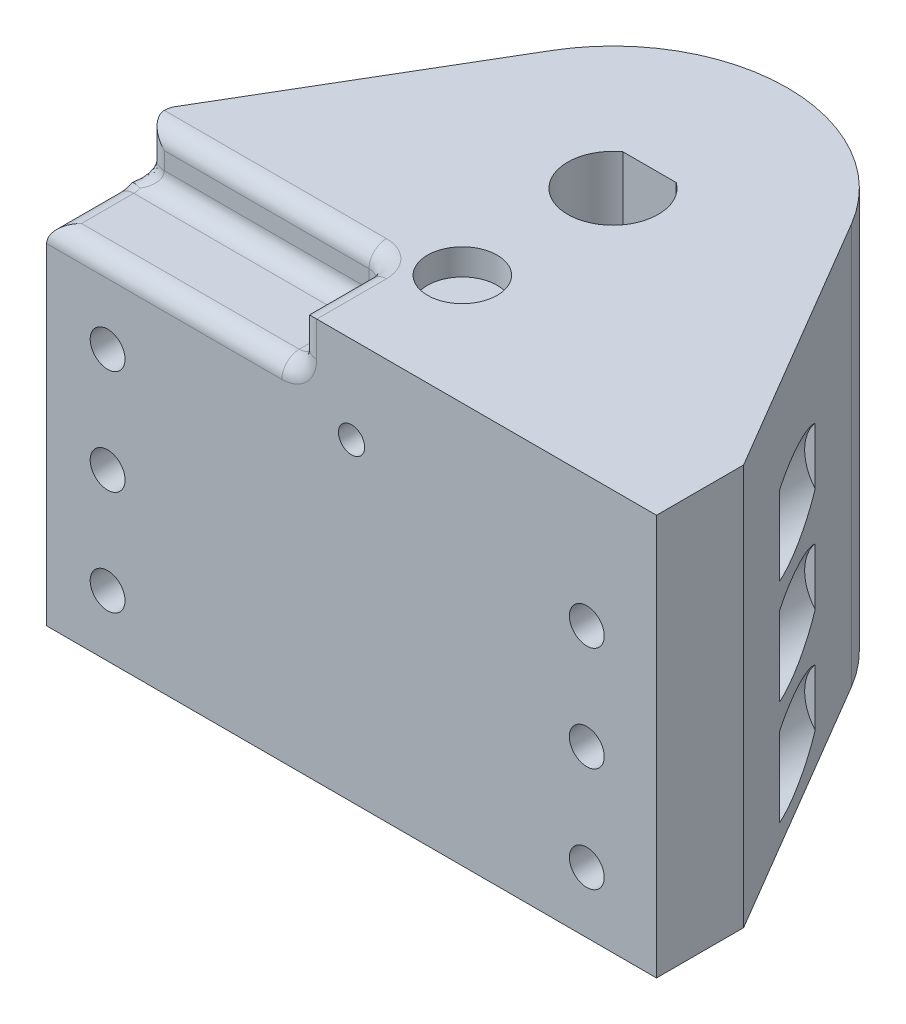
ISO-10303-21;
HEADER;
FILE_DESCRIPTION(('STEP AP214'),'2;1');
FILE_NAME('part.step','',(''),(''),'','','');
FILE_SCHEMA(('AUTOMOTIVE_DESIGN { 1 0 10303 214 1 1 1 1 }'));
ENDSEC;
DATA;
#1=APPLICATION_CONTEXT('core data for automotive mechanical design processes');
#2=APPLICATION_PROTOCOL_DEFINITION('international standard','automotive_design',2000,#1);
#3=PRODUCT_CONTEXT('',#1,'mechanical');
#4=PRODUCT('Part','Part','',(#3));
#5=PRODUCT_RELATED_PRODUCT_CATEGORY('part','',(#4));
#6=PRODUCT_DEFINITION_FORMATION('','',#4);
#7=PRODUCT_DEFINITION_CONTEXT('part definition',#1,'design');
#8=PRODUCT_DEFINITION('design','',#6,#7);
#9=PRODUCT_DEFINITION_SHAPE('','',#8);
#10=(LENGTH_UNIT() NAMED_UNIT(*) SI_UNIT(.MILLI.,.METRE.));
#11=(NAMED_UNIT(*) PLANE_ANGLE_UNIT() SI_UNIT($,.RADIAN.));
#12=(NAMED_UNIT(*) SI_UNIT($,.STERADIAN.) SOLID_ANGLE_UNIT());
#13=UNCERTAINTY_MEASURE_WITH_UNIT(LENGTH_MEASURE(1.E-05),#10,'distance_accuracy_value','');
#14=(GEOMETRIC_REPRESENTATION_CONTEXT(3) GLOBAL_UNCERTAINTY_ASSIGNED_CONTEXT((#13)) GLOBAL_UNIT_ASSIGNED_CONTEXT((#10,
#11,#12)) REPRESENTATION_CONTEXT('',''));
#15=CARTESIAN_POINT('',(0.,0.,0.));
#16=DIRECTION('',(0.,0.,1.));
#17=DIRECTION('',(1.,0.,0.));
#18=AXIS2_PLACEMENT_3D('',#15,#16,#17);
#19=CARTESIAN_POINT('',(0.,40.,0.));
#20=DIRECTION('',(-0.861538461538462,0.,0.507692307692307));
#21=DIRECTION('',(0.507692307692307,0.,0.861538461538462));
#22=AXIS2_PLACEMENT_3D('',#19,#20,#21);
#23=PLANE('',#22);
#24=CARTESIAN_POINT('',(-8.,20.,-13.5757575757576));
#25=DIRECTION('',(-0.861538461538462,0.,0.507692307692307));
#26=DIRECTION('',(-0.507692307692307,0.,-0.861538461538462));
#27=AXIS2_PLACEMENT_3D('',#24,#25,#26);
#28=ELLIPSE('',#27,9.84848484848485,5.);
#29=CARTESIAN_POINT('',(-5.89285714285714,15.465692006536,-10.));
#30=VERTEX_POINT('',#29);
#31=CARTESIAN_POINT('',(-11.7857142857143,16.7337533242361,-20.));
#32=VERTEX_POINT('',#31);
#33=EDGE_CURVE('E775',#30,#32,#28,.F.);
#34=ORIENTED_EDGE('',*,*,#33,.F.);
#35=DIRECTION('',(0.,1.,0.));
#36=VECTOR('',#35,1.);
#37=CARTESIAN_POINT('',(-5.89285714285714,40.,-10.));
#38=LINE('',#37,#36);
#39=CARTESIAN_POINT('',(-5.89285714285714,24.534307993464,-10.));
#40=VERTEX_POINT('',#39);
#41=EDGE_CURVE('E742',#30,#40,#38,.T.);
#42=ORIENTED_EDGE('',*,*,#41,.T.);
#43=CARTESIAN_POINT('',(-11.7857142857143,23.2662466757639,-20.));
#44=VERTEX_POINT('',#43);
#45=EDGE_CURVE('E778',#44,#40,#28,.F.);
#46=ORIENTED_EDGE('',*,*,#45,.F.);
#47=DIRECTION('',(0.,1.,0.));
#48=VECTOR('',#47,1.);
#49=CARTESIAN_POINT('',(-11.7857142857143,40.,-20.));
#50=LINE('',#49,#48);
#51=EDGE_CURVE('E773',#32,#44,#50,.T.);
#52=ORIENTED_EDGE('',*,*,#51,.F.);
#53=EDGE_LOOP('',(#34,#42,#46,#52));
#54=FACE_BOUND('',#53,.T.);
#55=CARTESIAN_POINT('',(-8.,8.,-13.5757575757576));
#56=DIRECTION('',(-0.861538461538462,0.,0.507692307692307));
#57=DIRECTION('',(-0.507692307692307,0.,-0.861538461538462));
#58=AXIS2_PLACEMENT_3D('',#55,#56,#57);
#59=ELLIPSE('',#58,9.84848484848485,5.);
#60=CARTESIAN_POINT('',(-5.89285714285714,3.46569200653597,-10.));
#61=VERTEX_POINT('',#60);
#62=CARTESIAN_POINT('',(-11.7857142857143,4.73375332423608,-20.));
#63=VERTEX_POINT('',#62);
#64=EDGE_CURVE('E769',#61,#63,#59,.F.);
#65=ORIENTED_EDGE('',*,*,#64,.F.);
#66=DIRECTION('',(0.,1.,0.));
#67=VECTOR('',#66,1.);
#68=CARTESIAN_POINT('',(-5.89285714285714,40.,-10.));
#69=LINE('',#68,#67);
#70=CARTESIAN_POINT('',(-5.89285714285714,12.534307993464,-10.));
#71=VERTEX_POINT('',#70);
#72=EDGE_CURVE('E734',#61,#71,#69,.T.);
#73=ORIENTED_EDGE('',*,*,#72,.T.);
#74=CARTESIAN_POINT('',(-11.7857142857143,11.2662466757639,-20.));
#75=VERTEX_POINT('',#74);
#76=EDGE_CURVE('E772',#75,#71,#59,.F.);
#77=ORIENTED_EDGE('',*,*,#76,.F.);
#78=DIRECTION('',(0.,1.,0.));
#79=VECTOR('',#78,1.);
#80=CARTESIAN_POINT('',(-11.7857142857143,40.,-20.));
#81=LINE('',#80,#79);
#82=EDGE_CURVE('E767',#63,#75,#81,.T.);
#83=ORIENTED_EDGE('',*,*,#82,.F.);
#84=EDGE_LOOP('',(#65,#73,#77,#83));
#85=FACE_BOUND('',#84,.T.);
#86=CARTESIAN_POINT('',(-8.00000000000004,32.,-13.5757575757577));
#87=DIRECTION('',(-0.861538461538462,0.,0.507692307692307));
#88=DIRECTION('',(-0.507692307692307,0.,-0.861538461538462));
#89=AXIS2_PLACEMENT_3D('',#86,#87,#88);
#90=ELLIPSE('',#89,9.84848484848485,5.);
#91=CARTESIAN_POINT('',(-5.89285714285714,27.465692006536,-10.));
#92=VERTEX_POINT('',#91);
#93=CARTESIAN_POINT('',(-11.7857142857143,28.733753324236,-20.));
#94=VERTEX_POINT('',#93);
#95=EDGE_CURVE('E723',#92,#94,#90,.F.);
#96=ORIENTED_EDGE('',*,*,#95,.F.);
#97=DIRECTION('',(0.,1.,0.));
#98=VECTOR('',#97,1.);
#99=CARTESIAN_POINT('',(-5.89285714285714,40.,-10.));
#100=LINE('',#99,#98);
#101=CARTESIAN_POINT('',(-5.89285714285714,36.534307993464,-10.));
#102=VERTEX_POINT('',#101);
#103=EDGE_CURVE('E720',#92,#102,#100,.T.);
#104=ORIENTED_EDGE('',*,*,#103,.T.);
#105=CARTESIAN_POINT('',(-11.7857142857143,35.266246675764,-20.));
#106=VERTEX_POINT('',#105);
#107=EDGE_CURVE('E726',#106,#102,#90,.F.);
#108=ORIENTED_EDGE('',*,*,#107,.F.);
#109=DIRECTION('',(0.,1.,0.));
#110=VECTOR('',#109,1.);
#111=CARTESIAN_POINT('',(-11.7857142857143,40.,-20.));
#112=LINE('',#111,#110);
#113=EDGE_CURVE('E716',#94,#106,#112,.T.);
#114=ORIENTED_EDGE('',*,*,#113,.F.);
#115=EDGE_LOOP('',(#96,#104,#108,#114));
#116=FACE_BOUND('',#115,.T.);
#117=DIRECTION('',(0.,-1.,0.));
#118=VECTOR('',#117,1.);
#119=CARTESIAN_POINT('',(0.,40.,0.));
#120=LINE('',#119,#118);
#121=CARTESIAN_POINT('',(0.,47.,0.));
#122=VERTEX_POINT('',#121);
#123=CARTESIAN_POINT('',(0.,1.,0.));
#124=VERTEX_POINT('',#123);
#125=EDGE_CURVE('E701',#122,#124,#120,.T.);
#126=ORIENTED_EDGE('',*,*,#125,.T.);
#127=DIRECTION('',(-0.507692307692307,0.,-0.861538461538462));
#128=VECTOR('',#127,1.);
#129=CARTESIAN_POINT('',(0.,1.,0.));
#130=LINE('',#129,#128);
#131=CARTESIAN_POINT('',(-17.7692307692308,1.,-30.1538461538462));
#132=VERTEX_POINT('',#131);
#133=EDGE_CURVE('E685',#124,#132,#130,.T.);
#134=ORIENTED_EDGE('',*,*,#133,.T.);
#135=DIRECTION('',(0.,-1.,0.));
#136=VECTOR('',#135,1.);
#137=CARTESIAN_POINT('',(-17.7692307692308,40.,-30.1538461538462));
#138=LINE('',#137,#136);
#139=CARTESIAN_POINT('',(-17.7692307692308,47.,-30.1538461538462));
#140=VERTEX_POINT('',#139);
#141=EDGE_CURVE('E713',#140,#132,#138,.T.);
#142=ORIENTED_EDGE('',*,*,#141,.F.);
#143=DIRECTION('',(-0.507692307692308,0.,-0.861538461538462));
#144=VECTOR('',#143,1.);
#145=CARTESIAN_POINT('',(0.,47.,0.));
#146=LINE('',#145,#144);
#147=EDGE_CURVE('E697',#122,#140,#146,.T.);
#148=ORIENTED_EDGE('',*,*,#147,.F.);
#149=EDGE_LOOP('',(#126,#134,#142,#148));
#150=FACE_BOUND('',#149,.T.);
#151=ADVANCED_FACE('F52',(#54,#85,#116,#150),#23,.F.);
#152=CARTESIAN_POINT('',(-35.,40.,-20.));
#153=DIRECTION('',(0.,-1.,0.));
#154=DIRECTION('',(0.,0.,-1.));
#155=AXIS2_PLACEMENT_3D('',#152,#153,#154);
#156=CYLINDRICAL_SURFACE('',#155,20.);
#157=CARTESIAN_POINT('',(-33.5,37.,-39.9436706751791));
#158=CARTESIAN_POINT('',(-33.500003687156,37.0841284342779,-39.943671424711));
#159=CARTESIAN_POINT('',(-33.5071013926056,37.1683148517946,-39.9442087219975));
#160=CARTESIAN_POINT('',(-33.5353121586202,37.3343604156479,-39.9462999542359));
#161=CARTESIAN_POINT('',(-33.5564412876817,37.416216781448,-39.9478550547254));
#162=CARTESIAN_POINT('',(-33.6121022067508,37.5751731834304,-39.9518047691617));
#163=CARTESIAN_POINT('',(-33.6466266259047,37.6522758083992,-39.9541989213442));
#164=CARTESIAN_POINT('',(-33.7280854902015,37.7995725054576,-39.9595563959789));
#165=CARTESIAN_POINT('',(-33.775017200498,37.8697680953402,-39.9625195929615));
#166=CARTESIAN_POINT('',(-33.8800656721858,38.0014250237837,-39.9686882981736));
#167=CARTESIAN_POINT('',(-33.9382031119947,38.0628698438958,-39.9718942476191));
#168=CARTESIAN_POINT('',(-34.0639693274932,38.1751393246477,-39.9781831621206));
#169=CARTESIAN_POINT('',(-34.131598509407,38.2259635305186,-39.9812661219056));
#170=CARTESIAN_POINT('',(-34.2745251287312,38.3156025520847,-39.9869657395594));
#171=CARTESIAN_POINT('',(-34.3498314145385,38.3544032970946,-39.9895818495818));
#172=CARTESIAN_POINT('',(-34.5059127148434,38.4188039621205,-39.9940482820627));
#173=CARTESIAN_POINT('',(-34.5866876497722,38.4444040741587,-39.9958986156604));
#174=CARTESIAN_POINT('',(-34.751250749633,38.4816298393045,-39.9986219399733));
#175=CARTESIAN_POINT('',(-34.8350329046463,38.493281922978,-39.9994967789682));
#176=CARTESIAN_POINT('',(-35.0033680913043,38.5023625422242,-40.0001767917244));
#177=CARTESIAN_POINT('',(-35.0879211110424,38.4997912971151,-39.9999819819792));
#178=CARTESIAN_POINT('',(-35.2552187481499,38.4805199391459,-39.9985461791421));
#179=CARTESIAN_POINT('',(-35.337966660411,38.4638482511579,-39.9973072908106));
#180=CARTESIAN_POINT('',(-35.4994862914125,38.4168934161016,-39.9939251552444));
#181=CARTESIAN_POINT('',(-35.5782579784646,38.3866101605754,-39.9917819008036));
#182=CARTESIAN_POINT('',(-35.7296799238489,38.3132599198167,-39.9868286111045));
#183=CARTESIAN_POINT('',(-35.8023239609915,38.270180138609,-39.9840179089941));
#184=CARTESIAN_POINT('',(-35.9393605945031,38.1724690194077,-39.978045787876));
#185=CARTESIAN_POINT('',(-36.0037530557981,38.1178374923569,-39.9748843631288));
#186=CARTESIAN_POINT('',(-36.1226247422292,37.9984133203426,-39.9685571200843));
#187=CARTESIAN_POINT('',(-36.1770791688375,37.9335959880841,-39.9653913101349));
#188=CARTESIAN_POINT('',(-36.2743376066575,37.7957263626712,-39.959419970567));
#189=CARTESIAN_POINT('',(-36.3171416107,37.7226740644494,-39.9566144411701));
#190=CARTESIAN_POINT('',(-36.3898828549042,37.5703914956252,-39.9516806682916));
#191=CARTESIAN_POINT('',(-36.4198189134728,37.4911606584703,-39.9495524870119));
#192=CARTESIAN_POINT('',(-36.465956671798,37.3287779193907,-39.9462154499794));
#193=CARTESIAN_POINT('',(-36.482158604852,37.2456260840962,-39.9450065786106));
#194=CARTESIAN_POINT('',(-36.5003370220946,37.0779784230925,-39.9436474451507));
#195=CARTESIAN_POINT('',(-36.5023480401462,36.9934863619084,-39.9434946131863));
#196=CARTESIAN_POINT('',(-36.4921779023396,36.8253662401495,-39.9442580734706));
#197=CARTESIAN_POINT('',(-36.4799968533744,36.7417381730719,-39.9451743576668));
#198=CARTESIAN_POINT('',(-36.4418171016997,36.5778184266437,-39.9479704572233));
#199=CARTESIAN_POINT('',(-36.4158344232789,36.4975229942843,-39.9498491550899));
#200=CARTESIAN_POINT('',(-36.350805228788,36.3424317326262,-39.9543574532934));
#201=CARTESIAN_POINT('',(-36.3117585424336,36.2676359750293,-39.9569870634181));
#202=CARTESIAN_POINT('',(-36.2216219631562,36.1255089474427,-39.9627071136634));
#203=CARTESIAN_POINT('',(-36.1705090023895,36.058192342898,-39.9657984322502));
#204=CARTESIAN_POINT('',(-36.0577242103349,35.9330825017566,-39.9720905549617));
#205=CARTESIAN_POINT('',(-35.9960522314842,35.8752893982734,-39.975291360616));
#206=CARTESIAN_POINT('',(-35.8637510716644,35.7707497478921,-39.9814493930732));
#207=CARTESIAN_POINT('',(-35.7931041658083,35.724025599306,-39.9844061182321));
#208=CARTESIAN_POINT('',(-35.6449472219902,35.6431036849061,-39.9897356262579));
#209=CARTESIAN_POINT('',(-35.5674372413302,35.6089058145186,-39.9921084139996));
#210=CARTESIAN_POINT('',(-35.4078355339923,35.554045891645,-39.9960003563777));
#211=CARTESIAN_POINT('',(-35.3257486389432,35.5333698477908,-39.9975203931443));
#212=CARTESIAN_POINT('',(-35.1592565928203,35.5060947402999,-39.9995391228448));
#213=CARTESIAN_POINT('',(-35.0748514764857,35.4994954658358,-40.0000378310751));
#214=CARTESIAN_POINT('',(-34.9063400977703,35.5005634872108,-39.9999577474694));
#215=CARTESIAN_POINT('',(-34.8222336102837,35.5081958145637,-39.999381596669));
#216=CARTESIAN_POINT('',(-34.6565002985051,35.5374376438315,-39.9972217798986));
#217=CARTESIAN_POINT('',(-34.5748734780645,35.5590471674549,-39.9956381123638));
#218=CARTESIAN_POINT('',(-34.4164131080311,35.6156214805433,-39.9916410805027));
#219=CARTESIAN_POINT('',(-34.3395794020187,35.6505858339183,-39.989227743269));
#220=CARTESIAN_POINT('',(-34.1928673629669,35.7328730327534,-39.9838417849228));
#221=CARTESIAN_POINT('',(-34.1229888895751,35.7801956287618,-39.9808691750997));
#222=CARTESIAN_POINT('',(-33.9919923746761,35.8859868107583,-39.9746899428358));
#223=CARTESIAN_POINT('',(-33.9308951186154,35.9444811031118,-39.9714827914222));
#224=CARTESIAN_POINT('',(-33.8193633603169,36.0709123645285,-39.9652003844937));
#225=CARTESIAN_POINT('',(-33.7689314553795,36.1388516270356,-39.9621251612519));
#226=CARTESIAN_POINT('',(-33.6801073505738,36.282352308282,-39.9564494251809));
#227=CARTESIAN_POINT('',(-33.6417344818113,36.3579257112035,-39.9538496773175));
#228=CARTESIAN_POINT('',(-33.57827063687,36.5144092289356,-39.9494287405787));
#229=CARTESIAN_POINT('',(-33.5531642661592,36.5953130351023,-39.9476066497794));
#230=CARTESIAN_POINT('',(-33.5233975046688,36.7305849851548,-39.9454198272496));
#231=CARTESIAN_POINT('',(-33.5146349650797,36.7840811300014,-39.9447668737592));
#232=CARTESIAN_POINT('',(-33.5029350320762,36.8917101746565,-39.9438920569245));
#233=CARTESIAN_POINT('',(-33.4999976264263,36.9458430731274,-39.9436701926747));
#234=CARTESIAN_POINT('',(-33.5,37.,-39.9436706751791));
#235=B_SPLINE_CURVE_WITH_KNOTS('',3,(#157,#158,#159,#160,#161,#162,#163,#164,#165,#166,#167,
#168,#169,#170,#171,#172,#173,#174,#175,#176,#177,#178,#179,#180,#181,#182,#183,#184,#185,#186,
#187,#188,#189,#190,#191,#192,#193,#194,#195,#196,#197,#198,#199,#200,#201,#202,#203,#204,#205,
#206,#207,#208,#209,#210,#211,#212,#213,#214,#215,#216,#217,#218,#219,#220,#221,#222,#223,#224,
#225,#226,#227,#228,#229,#230,#231,#232,#233,#234),.UNSPECIFIED.,.T.,.F.,(4,2,2,2,2,2,2,2,2,2,2,
2,2,2,2,2,2,2,2,2,2,2,2,2,2,2,2,2,2,2,2,2,2,2,2,2,2,2,4),(0.,0.252187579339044,
0.504664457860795,0.757002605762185,1.00928517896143,1.26203783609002,1.5148013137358,
1.76785948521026,2.02091397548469,2.27348818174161,2.52605849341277,2.7781208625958,
3.03018524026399,3.28250252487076,3.53482393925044,3.78776661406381,4.04070944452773,
4.29367549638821,4.54663725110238,4.79898320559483,5.05132725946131,5.30337896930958,
5.55543396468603,5.80797478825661,6.0605191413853,6.31357024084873,6.56661922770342,
6.81940596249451,7.07218891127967,7.32435156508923,7.57651461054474,7.82866942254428,
8.08081914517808,8.3335562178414,8.58635476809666,8.83955652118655,9.09246380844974,
9.25480764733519,9.41715114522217),.UNSPECIFIED.);
#236=CARTESIAN_POINT('',(-33.5,37.,-39.9436706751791));
#237=VERTEX_POINT('',#236);
#238=EDGE_CURVE('E337',#237,#237,#235,.T.);
#239=ORIENTED_EDGE('',*,*,#238,.T.);
#240=EDGE_LOOP('',(#239));
#241=FACE_BOUND('',#240,.T.);
#242=ORIENTED_EDGE('',*,*,#141,.T.);
#243=CARTESIAN_POINT('',(-35.,1.,-20.));
#244=DIRECTION('',(0.,1.,0.));
#245=DIRECTION('',(0.,0.,1.));
#246=AXIS2_PLACEMENT_3D('',#243,#244,#245);
#247=CIRCLE('',#246,20.);
#248=CARTESIAN_POINT('',(-52.2307692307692,1.,-30.1538461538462));
#249=VERTEX_POINT('',#248);
#250=EDGE_CURVE('E839',#132,#249,#247,.T.);
#251=ORIENTED_EDGE('',*,*,#250,.T.);
#252=DIRECTION('',(0.,-1.,0.));
#253=VECTOR('',#252,1.);
#254=CARTESIAN_POINT('',(-52.2307692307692,40.,-30.1538461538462));
#255=LINE('',#254,#253);
#256=CARTESIAN_POINT('',(-52.2307692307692,47.,-30.1538461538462));
#257=VERTEX_POINT('',#256);
#258=EDGE_CURVE('E710',#257,#249,#255,.T.);
#259=ORIENTED_EDGE('',*,*,#258,.F.);
#260=CARTESIAN_POINT('',(-35.,47.,-20.));
#261=DIRECTION('',(0.,1.,0.));
#262=DIRECTION('',(0.,0.,1.));
#263=AXIS2_PLACEMENT_3D('',#260,#261,#262);
#264=CIRCLE('',#263,20.);
#265=EDGE_CURVE('E344',#140,#257,#264,.T.);
#266=ORIENTED_EDGE('',*,*,#265,.F.);
#267=EDGE_LOOP('',(#242,#251,#259,#266));
#268=FACE_BOUND('',#267,.T.);
#269=ADVANCED_FACE('F346',(#241,#268),#156,.T.);
#270=CARTESIAN_POINT('',(-51.9573964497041,40.,-30.61775147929));
#271=DIRECTION('',(-0.861538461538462,0.,-0.507692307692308));
#272=DIRECTION('',(-0.507692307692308,0.,0.861538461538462));
#273=AXIS2_PLACEMENT_3D('',#270,#271,#272);
#274=PLANE('',#273);
#275=DIRECTION('',(0.,-1.,0.));
#276=VECTOR('',#275,1.);
#277=CARTESIAN_POINT('',(-70.,40.,0.));
#278=LINE('',#277,#276);
#279=CARTESIAN_POINT('',(-70.,39.1230769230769,0.));
#280=VERTEX_POINT('',#279);
#281=CARTESIAN_POINT('',(-70.,1.,0.));
#282=VERTEX_POINT('',#281);
#283=EDGE_CURVE('E703',#280,#282,#278,.T.);
#284=ORIENTED_EDGE('',*,*,#283,.F.);
#285=CARTESIAN_POINT('',(-70.5802197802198,43.,0.984615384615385));
#286=DIRECTION('',(-0.861538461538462,0.,-0.507692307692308));
#287=DIRECTION('',(0.507692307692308,0.,-0.861538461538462));
#288=AXIS2_PLACEMENT_3D('',#285,#286,#287);
#289=ELLIPSE('',#288,4.64285714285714,4.);
#290=CARTESIAN_POINT('',(-68.2230769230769,43.,-3.01538461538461));
#291=VERTEX_POINT('',#290);
#292=EDGE_CURVE('E13',#280,#291,#289,.F.);
#293=ORIENTED_EDGE('',*,*,#292,.T.);
#294=DIRECTION('',(0.,-1.,0.));
#295=VECTOR('',#294,1.);
#296=CARTESIAN_POINT('',(-68.2230769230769,40.,-3.01538461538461));
#297=LINE('',#296,#295);
#298=CARTESIAN_POINT('',(-68.2230769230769,47.,-3.0153846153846));
#299=VERTEX_POINT('',#298);
#300=EDGE_CURVE('E61',#291,#299,#297,.F.);
#301=ORIENTED_EDGE('',*,*,#300,.T.);
#302=DIRECTION('',(-0.507692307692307,0.,0.861538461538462));
#303=VECTOR('',#302,1.);
#304=CARTESIAN_POINT('',(-52.2307692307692,47.,-30.1538461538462));
#305=LINE('',#304,#303);
#306=EDGE_CURVE('E1359',#257,#299,#305,.T.);
#307=ORIENTED_EDGE('',*,*,#306,.F.);
#308=ORIENTED_EDGE('',*,*,#258,.T.);
#309=DIRECTION('',(0.507692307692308,0.,-0.861538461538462));
#310=VECTOR('',#309,1.);
#311=CARTESIAN_POINT('',(-51.9573964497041,1.,-30.61775147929));
#312=LINE('',#311,#310);
#313=EDGE_CURVE('E836',#282,#249,#312,.T.);
#314=ORIENTED_EDGE('',*,*,#313,.F.);
#315=EDGE_LOOP('',(#284,#293,#301,#307,#308,#314));
#316=FACE_BOUND('',#315,.T.);
#317=DIRECTION('',(0.,1.,0.));
#318=VECTOR('',#317,1.);
#319=CARTESIAN_POINT('',(-64.1071428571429,40.,-10.));
#320=LINE('',#319,#318);
#321=CARTESIAN_POINT('',(-64.1071428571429,3.12411703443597,-10.));
#322=VERTEX_POINT('',#321);
#323=CARTESIAN_POINT('',(-64.1071428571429,6.33439659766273,-10.));
#324=VERTEX_POINT('',#323);
#325=EDGE_CURVE('E743',#322,#324,#320,.T.);
#326=ORIENTED_EDGE('',*,*,#325,.F.);
#327=CARTESIAN_POINT('',(-63.,8.,-11.8787878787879));
#328=DIRECTION('',(-0.861538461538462,0.,-0.507692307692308));
#329=DIRECTION('',(0.507692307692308,0.,-0.861538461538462));
#330=AXIS2_PLACEMENT_3D('',#327,#328,#329);
#331=ELLIPSE('',#330,9.84848484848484,5.);
#332=CARTESIAN_POINT('',(-58.2142857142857,6.5519189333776,-20.));
#333=VERTEX_POINT('',#332);
#334=EDGE_CURVE('E763',#322,#333,#331,.F.);
#335=ORIENTED_EDGE('',*,*,#334,.T.);
#336=DIRECTION('',(0.,1.,0.));
#337=VECTOR('',#336,1.);
#338=CARTESIAN_POINT('',(-58.2142857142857,40.,-20.));
#339=LINE('',#338,#337);
#340=CARTESIAN_POINT('',(-58.2142857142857,9.4480810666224,-20.));
#341=VERTEX_POINT('',#340);
#342=EDGE_CURVE('E760',#333,#341,#339,.T.);
#343=ORIENTED_EDGE('',*,*,#342,.T.);
#344=CARTESIAN_POINT('',(-64.1071428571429,12.875882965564,-10.));
#345=VERTEX_POINT('',#344);
#346=EDGE_CURVE('E766',#341,#345,#331,.F.);
#347=ORIENTED_EDGE('',*,*,#346,.T.);
#348=CARTESIAN_POINT('',(-64.1071428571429,9.66560340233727,-10.));
#349=VERTEX_POINT('',#348);
#350=EDGE_CURVE('E877',#349,#345,#320,.T.);
#351=ORIENTED_EDGE('',*,*,#350,.F.);
#352=CARTESIAN_POINT('',(-63.,8.,-11.8787878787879));
#353=DIRECTION('',(-0.861538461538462,0.,-0.507692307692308));
#354=DIRECTION('',(-0.507692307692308,0.,0.861538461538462));
#355=AXIS2_PLACEMENT_3D('',#352,#353,#354);
#356=ELLIPSE('',#355,3.93939393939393,2.);
#357=EDGE_CURVE('E903',#324,#349,#356,.T.);
#358=ORIENTED_EDGE('',*,*,#357,.F.);
#359=EDGE_LOOP('',(#326,#335,#343,#347,#351,#358));
#360=FACE_BOUND('',#359,.T.);
#361=DIRECTION('',(0.,1.,0.));
#362=VECTOR('',#361,1.);
#363=CARTESIAN_POINT('',(-64.1071428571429,40.,-10.));
#364=LINE('',#363,#362);
#365=CARTESIAN_POINT('',(-64.1071428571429,15.124117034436,-10.));
#366=VERTEX_POINT('',#365);
#367=CARTESIAN_POINT('',(-64.1071428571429,18.3343965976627,-10.));
#368=VERTEX_POINT('',#367);
#369=EDGE_CURVE('E883',#366,#368,#364,.T.);
#370=ORIENTED_EDGE('',*,*,#369,.F.);
#371=CARTESIAN_POINT('',(-63.,20.,-11.8787878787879));
#372=DIRECTION('',(-0.861538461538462,0.,-0.507692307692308));
#373=DIRECTION('',(0.507692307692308,0.,-0.861538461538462));
#374=AXIS2_PLACEMENT_3D('',#371,#372,#373);
#375=ELLIPSE('',#374,9.84848484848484,5.);
#376=CARTESIAN_POINT('',(-58.2142857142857,18.5519189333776,-20.));
#377=VERTEX_POINT('',#376);
#378=EDGE_CURVE('E756',#366,#377,#375,.F.);
#379=ORIENTED_EDGE('',*,*,#378,.T.);
#380=DIRECTION('',(0.,1.,0.));
#381=VECTOR('',#380,1.);
#382=CARTESIAN_POINT('',(-58.2142857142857,40.,-20.));
#383=LINE('',#382,#381);
#384=CARTESIAN_POINT('',(-58.2142857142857,21.4480810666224,-20.));
#385=VERTEX_POINT('',#384);
#386=EDGE_CURVE('E753',#377,#385,#383,.T.);
#387=ORIENTED_EDGE('',*,*,#386,.T.);
#388=CARTESIAN_POINT('',(-64.1071428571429,24.875882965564,-10.));
#389=VERTEX_POINT('',#388);
#390=EDGE_CURVE('E759',#385,#389,#375,.F.);
#391=ORIENTED_EDGE('',*,*,#390,.T.);
#392=CARTESIAN_POINT('',(-64.1071428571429,21.6656034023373,-10.));
#393=VERTEX_POINT('',#392);
#394=EDGE_CURVE('E881',#393,#389,#364,.T.);
#395=ORIENTED_EDGE('',*,*,#394,.F.);
#396=CARTESIAN_POINT('',(-63.,20.,-11.8787878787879));
#397=DIRECTION('',(-0.861538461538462,0.,-0.507692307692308));
#398=DIRECTION('',(-0.507692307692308,0.,0.861538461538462));
#399=AXIS2_PLACEMENT_3D('',#396,#397,#398);
#400=ELLIPSE('',#399,3.93939393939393,2.);
#401=EDGE_CURVE('E705',#368,#393,#400,.T.);
#402=ORIENTED_EDGE('',*,*,#401,.F.);
#403=EDGE_LOOP('',(#370,#379,#387,#391,#395,#402));
#404=FACE_BOUND('',#403,.T.);
#405=DIRECTION('',(0.,1.,0.));
#406=VECTOR('',#405,1.);
#407=CARTESIAN_POINT('',(-64.1071428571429,40.,-10.));
#408=LINE('',#407,#406);
#409=CARTESIAN_POINT('',(-64.1071428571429,27.124117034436,-10.));
#410=VERTEX_POINT('',#409);
#411=CARTESIAN_POINT('',(-64.1071428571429,30.3343965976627,-10.));
#412=VERTEX_POINT('',#411);
#413=EDGE_CURVE('E735',#410,#412,#408,.T.);
#414=ORIENTED_EDGE('',*,*,#413,.F.);
#415=CARTESIAN_POINT('',(-63.,32.,-11.8787878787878));
#416=DIRECTION('',(-0.861538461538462,0.,-0.507692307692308));
#417=DIRECTION('',(0.507692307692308,0.,-0.861538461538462));
#418=AXIS2_PLACEMENT_3D('',#415,#416,#417);
#419=ELLIPSE('',#418,9.84848484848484,5.);
#420=CARTESIAN_POINT('',(-58.2142857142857,30.5519189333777,-20.));
#421=VERTEX_POINT('',#420);
#422=EDGE_CURVE('E749',#410,#421,#419,.F.);
#423=ORIENTED_EDGE('',*,*,#422,.T.);
#424=DIRECTION('',(0.,1.,0.));
#425=VECTOR('',#424,1.);
#426=CARTESIAN_POINT('',(-58.2142857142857,40.,-20.));
#427=LINE('',#426,#425);
#428=CARTESIAN_POINT('',(-58.2142857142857,33.4480810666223,-20.));
#429=VERTEX_POINT('',#428);
#430=EDGE_CURVE('E746',#421,#429,#427,.T.);
#431=ORIENTED_EDGE('',*,*,#430,.T.);
#432=CARTESIAN_POINT('',(-64.1071428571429,36.875882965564,-10.));
#433=VERTEX_POINT('',#432);
#434=EDGE_CURVE('E752',#429,#433,#419,.F.);
#435=ORIENTED_EDGE('',*,*,#434,.T.);
#436=CARTESIAN_POINT('',(-64.1071428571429,33.6656034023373,-10.));
#437=VERTEX_POINT('',#436);
#438=EDGE_CURVE('E849',#437,#433,#408,.T.);
#439=ORIENTED_EDGE('',*,*,#438,.F.);
#440=CARTESIAN_POINT('',(-63.,32.,-11.8787878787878));
#441=DIRECTION('',(-0.861538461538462,0.,-0.507692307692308));
#442=DIRECTION('',(-0.507692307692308,0.,0.861538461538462));
#443=AXIS2_PLACEMENT_3D('',#440,#441,#442);
#444=ELLIPSE('',#443,3.93939393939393,2.);
#445=EDGE_CURVE('E908',#412,#437,#444,.T.);
#446=ORIENTED_EDGE('',*,*,#445,.F.);
#447=EDGE_LOOP('',(#414,#423,#431,#435,#439,#446));
#448=FACE_BOUND('',#447,.T.);
#449=ADVANCED_FACE('F437',(#316,#360,#404,#448),#274,.T.);
#450=CARTESIAN_POINT('',(-70.,40.,0.));
#451=DIRECTION('',(1.,0.,0.));
#452=DIRECTION('',(0.,0.,-1.));
#453=AXIS2_PLACEMENT_3D('',#450,#451,#452);
#454=PLANE('',#453);
#455=DIRECTION('',(0.,-1.,0.));
#456=VECTOR('',#455,1.);
#457=CARTESIAN_POINT('',(-70.,40.,10.));
#458=LINE('',#457,#456);
#459=CARTESIAN_POINT('',(-70.,39.,10.));
#460=VERTEX_POINT('',#459);
#461=CARTESIAN_POINT('',(-70.,1.,10.));
#462=VERTEX_POINT('',#461);
#463=EDGE_CURVE('E696',#460,#462,#458,.T.);
#464=ORIENTED_EDGE('',*,*,#463,.F.);
#465=DIRECTION('',(0.,0.,1.));
#466=VECTOR('',#465,1.);
#467=CARTESIAN_POINT('',(-70.,39.,0.));
#468=LINE('',#467,#466);
#469=CARTESIAN_POINT('',(-70.,39.,2.));
#470=VERTEX_POINT('',#469);
#471=EDGE_CURVE('E1356',#460,#470,#468,.F.);
#472=ORIENTED_EDGE('',*,*,#471,.T.);
#473=CARTESIAN_POINT('',(-70.,43.,2.));
#474=DIRECTION('',(1.,0.,0.));
#475=DIRECTION('',(0.,0.,-1.));
#476=AXIS2_PLACEMENT_3D('',#473,#474,#475);
#477=CIRCLE('',#476,4.);
#478=CARTESIAN_POINT('',(-70.,39.4960117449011,0.0707342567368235));
#479=VERTEX_POINT('',#478);
#480=EDGE_CURVE('E550',#470,#479,#477,.T.);
#481=ORIENTED_EDGE('',*,*,#480,.T.);
#482=CARTESIAN_POINT('',(-68.2230769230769,43.,-3.01538461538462));
#483=CARTESIAN_POINT('',(-68.8123274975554,43.,-2.01544424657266));
#484=CARTESIAN_POINT('',(-68.2364862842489,43.,-1.00772212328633));
#485=CARTESIAN_POINT('',(-67.6606450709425,43.,0.));
#486=CARTESIAN_POINT('',(-66.5,43.,0.));
#487=CARTESIAN_POINT('',(-68.2230769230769,42.8252962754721,-3.01538461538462));
#488=CARTESIAN_POINT('',(-68.8123274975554,42.8841316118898,-2.01544424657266));
#489=CARTESIAN_POINT('',(-68.2364862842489,42.9133241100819,-1.00772212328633));
#490=CARTESIAN_POINT('',(-67.6606450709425,42.9425161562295,0.));
#491=CARTESIAN_POINT('',(-66.5,42.912648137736,0.));
#492=CARTESIAN_POINT('',(-68.2298449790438,42.6505925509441,-3.00389942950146));
#493=CARTESIAN_POINT('',(-68.8162198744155,42.7683202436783,-2.00883900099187));
#494=CARTESIAN_POINT('',(-68.2406662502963,42.8266482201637,-1.00352892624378));
#495=CARTESIAN_POINT('',(-67.6651044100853,42.8850606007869,0.00177290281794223));
#496=CARTESIAN_POINT('',(-66.5067680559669,42.8252962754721,0.00574259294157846));
#497=CARTESIAN_POINT('',(-68.2567184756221,42.304189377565,-2.95829592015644));
#498=CARTESIAN_POINT('',(-68.831906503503,42.5365400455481,-1.98221926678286));
#499=CARTESIAN_POINT('',(-68.2574671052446,42.6524973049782,-0.986457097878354));
#500=CARTESIAN_POINT('',(-67.6830196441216,42.7685389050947,0.00929677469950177));
#501=CARTESIAN_POINT('',(-66.5336415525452,42.6520946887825,0.0285443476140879));
#502=CARTESIAN_POINT('',(-68.276901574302,42.1325134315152,-2.92404581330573));
#503=CARTESIAN_POINT('',(-68.8437315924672,42.4206841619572,-1.96215244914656));
#504=CARTESIAN_POINT('',(-68.2701371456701,42.5650205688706,-0.973527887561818));
#505=CARTESIAN_POINT('',(-67.6965106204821,42.7095220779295,0.0150634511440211));
#506=CARTESIAN_POINT('',(-66.5538246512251,42.5662567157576,0.0456694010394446));
#507=CARTESIAN_POINT('',(-68.3301823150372,41.7950680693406,-2.83363001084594));
#508=CARTESIAN_POINT('',(-68.8756352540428,42.1891775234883,-1.90801290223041));
#509=CARTESIAN_POINT('',(-68.3042032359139,42.3889246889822,-0.938107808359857));
#510=CARTESIAN_POINT('',(-67.7327389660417,42.5888392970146,0.0317636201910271));
#511=CARTESIAN_POINT('',(-66.6071053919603,42.3975340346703,0.0908773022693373));
#512=CARTESIAN_POINT('',(-68.3634210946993,41.6293855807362,-2.77722480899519));
#513=CARTESIAN_POINT('',(-68.8957749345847,42.0736395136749,-1.87383647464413));
#514=CARTESIAN_POINT('',(-68.325694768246,42.300303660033,-0.915512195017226));
#515=CARTESIAN_POINT('',(-67.7555445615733,42.5272066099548,0.042736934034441));
#516=CARTESIAN_POINT('',(-66.6403441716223,42.3146927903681,0.119079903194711));
#517=CARTESIAN_POINT('',(-68.442186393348,41.3066887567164,-2.64356248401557));
#518=CARTESIAN_POINT('',(-68.9447400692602,41.843787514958,-1.79074412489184));
#519=CARTESIAN_POINT('',(-68.3777491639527,42.1223175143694,-0.859603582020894));
#520=CARTESIAN_POINT('',(-67.8106869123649,42.4010921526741,0.0714602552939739));
#521=CARTESIAN_POINT('',(-66.7191094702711,42.1533443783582,0.185911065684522));
#522=CARTESIAN_POINT('',(-68.4878937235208,41.1498465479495,-2.56599852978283));
#523=CARTESIAN_POINT('',(-68.9736535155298,41.7295927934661,-1.74167888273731));
#524=CARTESIAN_POINT('',(-68.4084462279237,42.0329618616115,-0.826131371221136));
#525=CARTESIAN_POINT('',(-67.8431195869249,42.3366311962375,0.0892831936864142));
#526=CARTESIAN_POINT('',(-66.7648168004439,42.0749232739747,0.224693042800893));
#527=CARTESIAN_POINT('',(-68.590783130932,40.8474243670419,-2.39139832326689));
#528=CARTESIAN_POINT('',(-69.0404996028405,41.5041394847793,-1.62824309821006));
#529=CARTESIAN_POINT('',(-68.4791494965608,41.8547027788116,-0.747382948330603));
#530=CARTESIAN_POINT('',(-67.9176767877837,42.2055758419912,0.133340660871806));
#531=CARTESIAN_POINT('',(-66.8677062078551,41.9237121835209,0.311993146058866));
#532=CARTESIAN_POINT('',(-68.6481590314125,40.7021015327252,-2.2940331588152));
#533=CARTESIAN_POINT('',(-69.0785390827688,41.3930155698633,-1.5636912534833));
#534=CARTESIAN_POINT('',(-68.5193150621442,41.7658372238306,-0.701902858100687));
#535=CARTESIAN_POINT('',(-67.9599150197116,42.1390027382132,0.159682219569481));
#536=CARTESIAN_POINT('',(-66.9250821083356,41.8510507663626,0.360675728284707));
#537=CARTESIAN_POINT('',(-68.7734004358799,40.425121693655,-2.08150229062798));
#538=CARTESIAN_POINT('',(-69.1637263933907,41.1759701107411,-1.41913096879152));
#539=CARTESIAN_POINT('',(-68.6089508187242,41.5904196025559,-0.598409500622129));
#540=CARTESIAN_POINT('',(-68.053993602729,42.0052251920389,0.222102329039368));
#541=CARTESIAN_POINT('',(-67.050323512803,41.7125608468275,0.466941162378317));
#542=CARTESIAN_POINT('',(-68.8414493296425,40.2937879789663,-1.96602538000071));
#543=CARTESIAN_POINT('',(-69.210987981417,41.0702030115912,-1.33892948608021));
#544=CARTESIAN_POINT('',(-68.6585877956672,41.5039469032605,-0.540168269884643));
#545=CARTESIAN_POINT('',(-68.1059524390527,41.9380559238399,0.258312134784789));
#546=CARTESIAN_POINT('',(-67.1183724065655,41.6468939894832,0.524679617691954));
#547=CARTESIAN_POINT('',(-68.9868912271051,40.0469745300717,-1.71921488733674));
#548=CARTESIAN_POINT('',(-69.3143814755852,40.8664615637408,-1.16347385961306));
#549=CARTESIAN_POINT('',(-68.7668439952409,41.3356082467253,-0.410955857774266));
#550=CARTESIAN_POINT('',(-68.21906356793,41.8051332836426,0.341272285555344));
#551=CARTESIAN_POINT('',(-67.2638143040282,41.5234872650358,0.648084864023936));
#552=CARTESIAN_POINT('',(-69.0644405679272,39.9318538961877,-1.58761600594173));
#553=CARTESIAN_POINT('',(-69.3706212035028,40.7686568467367,-1.06803674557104));
#554=CARTESIAN_POINT('',(-68.8256194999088,41.2538650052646,-0.339758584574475));
#555=CARTESIAN_POINT('',(-68.280326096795,41.7394351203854,0.388160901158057));
#556=CARTESIAN_POINT('',(-67.3413636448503,41.4659269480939,0.713884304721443));
#557=CARTESIAN_POINT('',(-69.2275897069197,39.7194104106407,-1.31075686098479));
#558=CARTESIAN_POINT('',(-69.4913836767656,40.5835127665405,-0.863106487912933));
#559=CARTESIAN_POINT('',(-68.9514941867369,41.097460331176,-0.185032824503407));
#560=CARTESIAN_POINT('',(-68.4113039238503,41.6117821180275,0.492671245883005));
#561=CARTESIAN_POINT('',(-67.5045127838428,41.3597052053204,0.852313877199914));
#562=CARTESIAN_POINT('',(-69.3133099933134,39.6224481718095,-1.16529213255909));
#563=CARTESIAN_POINT('',(-69.5559978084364,40.4963446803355,-0.753458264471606));
#564=CARTESIAN_POINT('',(-69.0187249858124,41.0229542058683,-0.101304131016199));
#565=CARTESIAN_POINT('',(-68.4811112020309,41.5498986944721,0.550419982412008));
#566=CARTESIAN_POINT('',(-67.5902330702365,41.3112240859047,0.925046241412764));
#567=CARTESIAN_POINT('',(-69.491373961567,39.4479894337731,-0.863122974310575));
#568=CARTESIAN_POINT('',(-69.6925944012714,40.3350222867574,-0.521657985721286));
#569=CARTESIAN_POINT('',(-69.1605382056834,40.8834633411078,0.0775095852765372));
#570=CARTESIAN_POINT('',(-68.6281319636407,41.4322491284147,0.676235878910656));
#571=CARTESIAN_POINT('',(-67.7682970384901,41.2239947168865,1.07613082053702));
#572=CARTESIAN_POINT('',(-69.5838005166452,39.3708225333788,-0.70627791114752));
#573=CARTESIAN_POINT('',(-69.7646457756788,40.261021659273,-0.399388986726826));
#574=CARTESIAN_POINT('',(-69.2352194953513,40.8186464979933,0.172752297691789));
#575=CARTESIAN_POINT('',(-68.7054139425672,41.3765585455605,0.744404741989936));
#576=CARTESIAN_POINT('',(-67.8607235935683,41.1854112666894,1.15455335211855));
#577=CARTESIAN_POINT('',(-69.773734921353,39.2373153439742,-0.383964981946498));
#578=CARTESIAN_POINT('',(-69.9149216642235,40.128304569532,-0.144375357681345));
#579=CARTESIAN_POINT('',(-69.3906940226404,40.7007725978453,0.373111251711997));
#580=CARTESIAN_POINT('',(-68.8660793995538,41.273534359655,0.890099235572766));
#581=CARTESIAN_POINT('',(-68.050657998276,41.1186576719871,1.31570981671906));
#582=CARTESIAN_POINT('',(-69.8712917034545,39.1812462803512,-0.21841407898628));
#583=CARTESIAN_POINT('',(-69.9931916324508,40.0697034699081,-0.0115535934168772));
#584=CARTESIAN_POINT('',(-69.4715517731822,40.6478719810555,0.478335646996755));
#585=CARTESIAN_POINT('',(-68.9495077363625,41.2262640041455,0.967694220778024));
#586=CARTESIAN_POINT('',(-68.1482147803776,41.0906231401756,1.39848526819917));
#587=CARTESIAN_POINT('',(-70.0698514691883,39.0909603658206,0.118535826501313));
#588=CARTESIAN_POINT('',(-70.1544863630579,39.9696746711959,0.262158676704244));
#589=CARTESIAN_POINT('',(-69.6379274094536,40.5557530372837,0.696758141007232));
#590=CARTESIAN_POINT('',(-69.1209591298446,41.1420583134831,1.13082028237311));
#591=CARTESIAN_POINT('',(-68.3467745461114,41.0454801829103,1.56696022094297));
#592=CARTESIAN_POINT('',(-70.1708768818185,39.0569356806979,0.289972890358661));
#593=CARTESIAN_POINT('',(-70.2375366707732,39.928305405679,0.403092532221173));
#594=CARTESIAN_POINT('',(-69.7234794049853,40.5166563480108,0.810017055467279));
#595=CARTESIAN_POINT('',(-69.2090076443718,41.1051569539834,1.21638873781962));
#596=CARTESIAN_POINT('',(-68.4477999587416,41.028467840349,1.65267875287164));
#597=CARTESIAN_POINT('',(-70.3746709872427,39.0114057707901,0.635805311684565));
#598=CARTESIAN_POINT('',(-70.4068094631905,39.8641863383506,0.690343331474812));
#599=CARTESIAN_POINT('',(-69.897636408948,40.4536791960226,1.0422887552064));
#600=CARTESIAN_POINT('',(-69.388047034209,41.0433228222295,1.39367896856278));
#601=CARTESIAN_POINT('',(-68.6515940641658,41.005702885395,1.82559496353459));
#602=CARTESIAN_POINT('',(-70.4774453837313,39.,0.810210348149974));
#603=CARTESIAN_POINT('',(-70.4930446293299,39.84142394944,0.836681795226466));
#604=CARTESIAN_POINT('',(-69.9862531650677,40.4298662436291,1.1613246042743));
#605=CARTESIAN_POINT('',(-69.4790514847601,41.0183802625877,1.48541291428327));
#606=CARTESIAN_POINT('',(-68.7543684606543,41.,1.91279748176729));
#607=CARTESIAN_POINT('',(-70.6829941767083,39.,1.15902042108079));
#608=CARTESIAN_POINT('',(-70.6669961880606,39.8154897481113,1.13187231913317));
#609=CARTESIAN_POINT('',(-70.1648313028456,40.3985608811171,1.40270470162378));
#610=CARTESIAN_POINT('',(-69.6622579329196,40.9817038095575,1.67298496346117));
#611=CARTESIAN_POINT('',(-68.9599172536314,41.,2.0872025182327));
#612=CARTESIAN_POINT('',(-70.7857685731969,39.0114057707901,1.3334254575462));
#613=CARTESIAN_POINT('',(-70.7547217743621,39.8122261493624,1.28073998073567));
#614=CARTESIAN_POINT('',(-70.2547926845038,40.3910684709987,1.52504894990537));
#615=CARTESIAN_POINT('',(-69.7544712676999,40.9699062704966,1.76882153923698));
#616=CARTESIAN_POINT('',(-69.06269165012,41.005702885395,2.17440503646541));
#617=CARTESIAN_POINT('',(-70.9895626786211,39.0569356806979,1.6792578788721));
#618=CARTESIAN_POINT('',(-70.9299061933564,39.8257750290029,1.57802263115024));
#619=CARTESIAN_POINT('',(-70.4343001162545,40.3930604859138,1.77046265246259));
#620=CARTESIAN_POINT('',(-69.9383067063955,40.9603418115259,1.96237314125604));
#621=CARTESIAN_POINT('',(-69.2664857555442,41.028467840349,2.34732124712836));
#622=CARTESIAN_POINT('',(-71.0905880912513,39.0909603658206,1.85069494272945));
#623=CARTESIAN_POINT('',(-71.0173813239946,39.8424150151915,1.72646527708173));
#624=CARTESIAN_POINT('',(-70.5238462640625,40.4024708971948,1.89352660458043));
#625=CARTESIAN_POINT('',(-70.029948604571,40.9624528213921,2.06008738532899));
#626=CARTESIAN_POINT('',(-69.3675111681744,41.0454801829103,2.43303977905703));
#627=CARTESIAN_POINT('',(-71.2891478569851,39.1812462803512,2.18764484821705));
#628=CARTESIAN_POINT('',(-71.1903062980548,39.8957747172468,2.01991371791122));
#629=CARTESIAN_POINT('',(-70.7007568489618,40.4384743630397,2.13773922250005));
#630=CARTESIAN_POINT('',(-70.2108523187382,40.9811019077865,2.25507456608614));
#631=CARTESIAN_POINT('',(-69.5660709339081,41.0906231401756,2.60151473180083));
#632=CARTESIAN_POINT('',(-71.3867046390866,39.2373153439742,2.35319575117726));
#633=CARTESIAN_POINT('',(-71.2757902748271,39.9322468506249,2.16497743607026));
#634=CARTESIAN_POINT('',(-70.7881333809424,40.4649201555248,2.2588952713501));
#635=CARTESIAN_POINT('',(-70.3001531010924,40.9974610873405,2.35236302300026));
#636=CARTESIAN_POINT('',(-69.6636277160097,41.1186576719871,2.68429018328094));
#637=CARTESIAN_POINT('',(-71.5766390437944,39.3708225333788,2.67550868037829));
#638=CARTESIAN_POINT('',(-71.4430059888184,40.0248063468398,2.44873743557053));
#639=CARTESIAN_POINT('',(-70.9589729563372,40.5347585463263,2.49666751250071));
#640=CARTESIAN_POINT('',(-70.4746255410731,41.044582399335,2.54416003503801));
#641=CARTESIAN_POINT('',(-69.8535621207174,41.1854112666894,2.84544664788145));
#642=CARTESIAN_POINT('',(-71.6690655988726,39.4479894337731,2.83235374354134));
#643=CARTESIAN_POINT('',(-71.5247994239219,40.0805840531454,2.58753841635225));
#644=CARTESIAN_POINT('',(-71.0424709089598,40.5779387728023,2.61332120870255));
#645=CARTESIAN_POINT('',(-70.5598649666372,41.0751168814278,2.63871520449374));
#646=CARTESIAN_POINT('',(-69.9459886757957,41.2239947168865,2.92386917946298));
#647=CARTESIAN_POINT('',(-71.8471295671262,39.6224481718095,3.13452290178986));
#648=CARTESIAN_POINT('',(-71.6829772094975,40.2108428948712,2.85596132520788));
#649=CARTESIAN_POINT('',(-71.2038937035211,40.6805856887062,2.83954697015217));
#650=CARTESIAN_POINT('',(-70.7245420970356,41.1501581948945,2.8227568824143));
#651=CARTESIAN_POINT('',(-70.1240526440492,41.3112240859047,3.07495375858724));
#652=CARTESIAN_POINT('',(-71.9328498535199,39.7194104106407,3.27998763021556));
#653=CARTESIAN_POINT('',(-71.7594582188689,40.2849727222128,2.98574728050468));
#654=CARTESIAN_POINT('',(-71.2818847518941,40.7397902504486,2.94920063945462));
#655=CARTESIAN_POINT('',(-70.8040836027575,41.1944031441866,2.91233306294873));
#656=CARTESIAN_POINT('',(-70.209772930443,41.3597052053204,3.14768612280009));
#657=CARTESIAN_POINT('',(-72.0959989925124,39.9318538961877,3.5568467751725));
#658=CARTESIAN_POINT('',(-71.9054600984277,40.4506032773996,3.23350804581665));
#659=CARTESIAN_POINT('',(-71.4307410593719,40.8734247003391,3.15902891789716));
#660=CARTESIAN_POINT('',(-70.9558028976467,41.2960496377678,3.08424090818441));
#661=CARTESIAN_POINT('',(-70.3729220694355,41.4659269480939,3.28611569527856));
#662=CARTESIAN_POINT('',(-72.1735483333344,40.0469745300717,3.68844565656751));
#663=CARTESIAN_POINT('',(-71.9751160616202,40.5417382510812,3.35171210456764));
#664=CARTESIAN_POINT('',(-71.5017084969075,40.9475646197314,3.25933757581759));
#665=CARTESIAN_POINT('',(-71.0281237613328,41.3531754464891,3.16671210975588));
#666=CARTESIAN_POINT('',(-70.4504714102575,41.5234872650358,3.35191513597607));
#667=CARTESIAN_POINT('',(-72.3189902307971,40.2937879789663,3.93525614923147));
#668=CARTESIAN_POINT('',(-72.106056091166,40.739657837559,3.57391336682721));
#669=CARTESIAN_POINT('',(-71.6351045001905,41.1096374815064,3.44827992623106));
#670=CARTESIAN_POINT('',(-71.1639826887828,41.4794105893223,3.32240537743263));
#671=CARTESIAN_POINT('',(-70.5959133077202,41.6468939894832,3.47532038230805));
#672=CARTESIAN_POINT('',(-72.3870391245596,40.425121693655,4.05073305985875));
#673=CARTESIAN_POINT('',(-72.1675114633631,40.8460944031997,3.6782012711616));
#674=CARTESIAN_POINT('',(-71.6976704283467,41.1972794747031,3.53710023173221));
#675=CARTESIAN_POINT('',(-71.2277005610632,41.548255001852,3.39581600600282));
#676=CARTESIAN_POINT('',(-70.6639622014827,41.7125608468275,3.53305883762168));
#677=CARTESIAN_POINT('',(-72.5122805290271,40.7021015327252,4.26326392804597));
#678=CARTESIAN_POINT('',(-72.2808095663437,41.0725453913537,3.87046471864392));
#679=CARTESIAN_POINT('',(-71.8130208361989,41.3845889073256,3.70112490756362));
#680=CARTESIAN_POINT('',(-71.3451081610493,41.6964314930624,3.53160884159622));
#681=CARTESIAN_POINT('',(-70.7892036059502,41.8510507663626,3.63932427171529));
#682=CARTESIAN_POINT('',(-72.5696564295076,40.8474243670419,4.36062909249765));
#683=CARTESIAN_POINT('',(-72.3328502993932,41.1922628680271,3.95877626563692));
#684=CARTESIAN_POINT('',(-71.8659700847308,41.4839930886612,3.77655800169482));
#685=CARTESIAN_POINT('',(-71.3990044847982,41.7755354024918,3.59421795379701));
#686=CARTESIAN_POINT('',(-70.8465795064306,41.9237121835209,3.68800685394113));
#687=CARTESIAN_POINT('',(-72.6725458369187,41.1498465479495,4.5352292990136));
#688=CARTESIAN_POINT('',(-72.4262791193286,41.4428995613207,4.11732214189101));
#689=CARTESIAN_POINT('',(-71.9610440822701,41.6927674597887,3.91217165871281));
#690=CARTESIAN_POINT('',(-71.4957264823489,41.9424544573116,3.70690339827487));
#691=CARTESIAN_POINT('',(-70.9494689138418,42.0749232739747,3.77530695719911));
#692=CARTESIAN_POINT('',(-72.7182531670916,41.3066887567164,4.61279325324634));
#693=CARTESIAN_POINT('',(-72.467874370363,41.5736016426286,4.1879080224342));
#694=CARTESIAN_POINT('',(-72.003345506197,41.8019275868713,3.97260090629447));
#695=CARTESIAN_POINT('',(-71.5387674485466,42.0301006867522,3.75722346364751));
#696=CARTESIAN_POINT('',(-70.9951762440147,42.1533443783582,3.81408893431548));
#697=CARTESIAN_POINT('',(-72.7970184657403,41.6293855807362,4.74645557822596));
#698=CARTESIAN_POINT('',(-72.539599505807,41.8435834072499,4.30962340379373));
#699=CARTESIAN_POINT('',(-72.0763063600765,42.0279151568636,4.07691848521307));
#700=CARTESIAN_POINT('',(-71.6129651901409,42.2120986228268,3.84414489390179));
#701=CARTESIAN_POINT('',(-71.0739415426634,42.3146927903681,3.88092009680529));
#702=CARTESIAN_POINT('',(-72.8302572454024,41.7950680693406,4.80286078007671));
#703=CARTESIAN_POINT('',(-72.5699212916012,41.9827422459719,4.36107855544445));
#704=CARTESIAN_POINT('',(-72.1071321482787,42.1446017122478,4.12104310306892));
#705=CARTESIAN_POINT('',(-71.6443208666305,42.3063538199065,3.88097595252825));
#706=CARTESIAN_POINT('',(-71.1071803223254,42.3975340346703,3.90912269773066));
#707=CARTESIAN_POINT('',(-72.8835379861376,42.1325134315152,4.89327658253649));
#708=CARTESIAN_POINT('',(-72.6185349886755,42.2668329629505,4.4435745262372));
#709=CARTESIAN_POINT('',(-72.156570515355,42.3831669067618,4.1918460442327));
#710=CARTESIAN_POINT('',(-71.6945840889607,42.4993954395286,3.94008611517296));
#711=CARTESIAN_POINT('',(-71.1604610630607,42.5662567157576,3.95433059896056));
#712=CARTESIAN_POINT('',(-72.9037210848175,42.304189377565,4.9275266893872));
#713=CARTESIAN_POINT('',(-72.6369759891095,42.4117375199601,4.47486834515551));
#714=CARTESIAN_POINT('',(-72.1753137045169,42.5049743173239,4.21871093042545));
#715=CARTESIAN_POINT('',(-71.7136459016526,42.5981561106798,3.96254560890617));
#716=CARTESIAN_POINT('',(-71.1806441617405,42.6520946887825,3.97145565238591));
#717=CARTESIAN_POINT('',(-72.9305945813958,42.6505925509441,4.97313019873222));
#718=CARTESIAN_POINT('',(-72.6615238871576,42.7044116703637,4.51652538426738));
#719=CARTESIAN_POINT('',(-72.2002741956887,42.7512006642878,4.25449311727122));
#720=CARTESIAN_POINT('',(-71.739018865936,42.7979346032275,3.9924527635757));
#721=CARTESIAN_POINT('',(-71.2075176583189,42.8252962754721,3.99425740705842));
#722=CARTESIAN_POINT('',(-72.9373626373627,42.8252962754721,4.98461538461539));
#723=CARTESIAN_POINT('',(-72.6677125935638,42.8522224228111,4.52702743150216));
#724=CARTESIAN_POINT('',(-72.2065635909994,42.8756003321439,4.26351371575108));
#725=CARTESIAN_POINT('',(-71.745414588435,42.8989786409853,4.));
#726=CARTESIAN_POINT('',(-71.2142857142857,42.912648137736,4.));
#727=CARTESIAN_POINT('',(-72.9373626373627,43.1747037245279,4.98461538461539));
#728=CARTESIAN_POINT('',(-72.6677125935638,43.1477775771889,4.52702743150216));
#729=CARTESIAN_POINT('',(-72.2065635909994,43.1243996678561,4.26351371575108));
#730=CARTESIAN_POINT('',(-71.745414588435,43.1010213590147,4.));
#731=CARTESIAN_POINT('',(-71.2142857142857,43.087351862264,4.));
#732=CARTESIAN_POINT('',(-72.9305945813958,43.3494074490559,4.97313019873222));
#733=CARTESIAN_POINT('',(-72.6615238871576,43.2955883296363,4.51652538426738));
#734=CARTESIAN_POINT('',(-72.2002741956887,43.2487993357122,4.25449311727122));
#735=CARTESIAN_POINT('',(-71.739018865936,43.2020653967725,3.9924527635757));
#736=CARTESIAN_POINT('',(-71.2075176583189,43.1747037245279,3.99425740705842));
#737=CARTESIAN_POINT('',(-72.9037210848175,43.6958106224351,4.9275266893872));
#738=CARTESIAN_POINT('',(-72.6369759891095,43.5882624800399,4.47486834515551));
#739=CARTESIAN_POINT('',(-72.1753137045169,43.4950256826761,4.21871093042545));
#740=CARTESIAN_POINT('',(-71.7136459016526,43.4018438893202,3.96254560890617));
#741=CARTESIAN_POINT('',(-71.1806441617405,43.3479053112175,3.97145565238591));
#742=CARTESIAN_POINT('',(-72.8835379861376,43.8674865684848,4.89327658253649));
#743=CARTESIAN_POINT('',(-72.6185349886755,43.7331670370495,4.4435745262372));
#744=CARTESIAN_POINT('',(-72.156570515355,43.6168330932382,4.1918460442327));
#745=CARTESIAN_POINT('',(-71.6945840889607,43.5006045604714,3.94008611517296));
#746=CARTESIAN_POINT('',(-71.1604610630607,43.4337432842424,3.95433059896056));
#747=CARTESIAN_POINT('',(-72.8302572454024,44.2049319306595,4.80286078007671));
#748=CARTESIAN_POINT('',(-72.5699212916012,44.0172577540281,4.36107855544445));
#749=CARTESIAN_POINT('',(-72.1071321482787,43.8553982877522,4.12104310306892));
#750=CARTESIAN_POINT('',(-71.6443208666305,43.6936461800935,3.88097595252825));
#751=CARTESIAN_POINT('',(-71.1071803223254,43.6024659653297,3.90912269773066));
#752=CARTESIAN_POINT('',(-72.7970184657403,44.3706144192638,4.74645557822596));
#753=CARTESIAN_POINT('',(-72.539599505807,44.1564165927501,4.30962340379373));
#754=CARTESIAN_POINT('',(-72.0763063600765,43.9720848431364,4.07691848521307));
#755=CARTESIAN_POINT('',(-71.6129651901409,43.7879013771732,3.84414489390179));
#756=CARTESIAN_POINT('',(-71.0739415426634,43.6853072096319,3.88092009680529));
#757=CARTESIAN_POINT('',(-72.7182531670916,44.6933112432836,4.61279325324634));
#758=CARTESIAN_POINT('',(-72.467874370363,44.4263983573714,4.1879080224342));
#759=CARTESIAN_POINT('',(-72.003345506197,44.1980724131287,3.97260090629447));
#760=CARTESIAN_POINT('',(-71.5387674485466,43.9698993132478,3.75722346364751));
#761=CARTESIAN_POINT('',(-70.9951762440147,43.8466556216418,3.81408893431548));
#762=CARTESIAN_POINT('',(-72.6725458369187,44.8501534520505,4.5352292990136));
#763=CARTESIAN_POINT('',(-72.4262791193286,44.5571004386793,4.11732214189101));
#764=CARTESIAN_POINT('',(-71.9610440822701,44.3072325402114,3.91217165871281));
#765=CARTESIAN_POINT('',(-71.4957264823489,44.0575455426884,3.70690339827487));
#766=CARTESIAN_POINT('',(-70.9494689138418,43.9250767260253,3.77530695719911));
#767=CARTESIAN_POINT('',(-72.5696564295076,45.1525756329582,4.36062909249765));
#768=CARTESIAN_POINT('',(-72.3328502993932,44.8077371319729,3.95877626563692));
#769=CARTESIAN_POINT('',(-71.8659700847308,44.5160069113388,3.77655800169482));
#770=CARTESIAN_POINT('',(-71.3990044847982,44.2244645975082,3.59421795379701));
#771=CARTESIAN_POINT('',(-70.8465795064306,44.0762878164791,3.68800685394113));
#772=CARTESIAN_POINT('',(-72.5122805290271,45.2978984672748,4.26326392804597));
#773=CARTESIAN_POINT('',(-72.2808095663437,44.9274546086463,3.87046471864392));
#774=CARTESIAN_POINT('',(-71.8130208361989,44.6154110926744,3.70112490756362));
#775=CARTESIAN_POINT('',(-71.3451081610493,44.3035685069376,3.53160884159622));
#776=CARTESIAN_POINT('',(-70.7892036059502,44.1489492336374,3.63932427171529));
#777=CARTESIAN_POINT('',(-72.3870391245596,45.574878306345,4.05073305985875));
#778=CARTESIAN_POINT('',(-72.1675114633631,45.1539055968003,3.6782012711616));
#779=CARTESIAN_POINT('',(-71.6976704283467,44.8027205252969,3.53710023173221));
#780=CARTESIAN_POINT('',(-71.2277005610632,44.451744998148,3.39581600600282));
#781=CARTESIAN_POINT('',(-70.6639622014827,44.2874391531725,3.53305883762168));
#782=CARTESIAN_POINT('',(-72.3189902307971,45.7062120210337,3.93525614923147));
#783=CARTESIAN_POINT('',(-72.106056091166,45.260342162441,3.57391336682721));
#784=CARTESIAN_POINT('',(-71.6351045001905,44.8903625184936,3.44827992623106));
#785=CARTESIAN_POINT('',(-71.1639826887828,44.5205894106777,3.32240537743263));
#786=CARTESIAN_POINT('',(-70.5959133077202,44.3531060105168,3.47532038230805));
#787=CARTESIAN_POINT('',(-72.1735483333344,45.9530254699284,3.68844565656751));
#788=CARTESIAN_POINT('',(-71.9751160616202,45.4582617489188,3.35171210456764));
#789=CARTESIAN_POINT('',(-71.5017084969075,45.0524353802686,3.25933757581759));
#790=CARTESIAN_POINT('',(-71.0281237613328,44.6468245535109,3.16671210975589));
#791=CARTESIAN_POINT('',(-70.4504714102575,44.4765127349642,3.35191513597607));
#792=CARTESIAN_POINT('',(-72.0959989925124,46.0681461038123,3.5568467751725));
#793=CARTESIAN_POINT('',(-71.9054600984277,45.5493967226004,3.23350804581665));
#794=CARTESIAN_POINT('',(-71.4307410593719,45.1265752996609,3.15902891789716));
#795=CARTESIAN_POINT('',(-70.9558028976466,44.7039503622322,3.08424090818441));
#796=CARTESIAN_POINT('',(-70.3729220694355,44.5340730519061,3.28611569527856));
#797=CARTESIAN_POINT('',(-71.9328498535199,46.2805895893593,3.27998763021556));
#798=CARTESIAN_POINT('',(-71.7594582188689,45.7150272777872,2.98574728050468));
#799=CARTESIAN_POINT('',(-71.2818847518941,45.2602097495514,2.94920063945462));
#800=CARTESIAN_POINT('',(-70.8040836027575,44.8055968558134,2.91233306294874));
#801=CARTESIAN_POINT('',(-70.209772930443,44.6402947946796,3.14768612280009));
#802=CARTESIAN_POINT('',(-71.8471295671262,46.3775518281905,3.13452290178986));
#803=CARTESIAN_POINT('',(-71.6829772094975,45.7891571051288,2.85596132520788));
#804=CARTESIAN_POINT('',(-71.2038937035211,45.3194143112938,2.83954697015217));
#805=CARTESIAN_POINT('',(-70.7245420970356,44.8498418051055,2.8227568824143));
#806=CARTESIAN_POINT('',(-70.1240526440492,44.6887759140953,3.07495375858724));
#807=CARTESIAN_POINT('',(-71.6690655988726,46.5520105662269,2.83235374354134));
#808=CARTESIAN_POINT('',(-71.5247994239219,45.9194159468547,2.58753841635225));
#809=CARTESIAN_POINT('',(-71.0424709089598,45.4220612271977,2.61332120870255));
#810=CARTESIAN_POINT('',(-70.5598649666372,44.9248831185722,2.63871520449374));
#811=CARTESIAN_POINT('',(-69.9459886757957,44.7760052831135,2.92386917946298));
#812=CARTESIAN_POINT('',(-71.5766390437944,46.6291774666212,2.67550868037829));
#813=CARTESIAN_POINT('',(-71.4430059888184,45.9751936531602,2.44873743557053));
#814=CARTESIAN_POINT('',(-70.9589729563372,45.4652414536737,2.49666751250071));
#815=CARTESIAN_POINT('',(-70.4746255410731,44.955417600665,2.54416003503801));
#816=CARTESIAN_POINT('',(-69.8535621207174,44.8145887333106,2.84544664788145));
#817=CARTESIAN_POINT('',(-71.3867046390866,46.7626846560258,2.35319575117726));
#818=CARTESIAN_POINT('',(-71.2757902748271,46.0677531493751,2.16497743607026));
#819=CARTESIAN_POINT('',(-70.7881333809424,45.5350798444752,2.2588952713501));
#820=CARTESIAN_POINT('',(-70.3001531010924,45.0025389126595,2.35236302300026));
#821=CARTESIAN_POINT('',(-69.6636277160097,44.8813423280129,2.68429018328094));
#822=CARTESIAN_POINT('',(-71.2891478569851,46.8187537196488,2.18764484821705));
#823=CARTESIAN_POINT('',(-71.1903062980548,46.1042252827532,2.01991371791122));
#824=CARTESIAN_POINT('',(-70.7007568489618,45.5615256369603,2.13773922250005));
#825=CARTESIAN_POINT('',(-70.2108523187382,45.0188980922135,2.25507456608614));
#826=CARTESIAN_POINT('',(-69.5660709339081,44.9093768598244,2.60151473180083));
#827=CARTESIAN_POINT('',(-71.0905880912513,46.9090396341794,1.85069494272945));
#828=CARTESIAN_POINT('',(-71.0173813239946,46.1575849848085,1.72646527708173));
#829=CARTESIAN_POINT('',(-70.5238462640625,45.5975291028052,1.89352660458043));
#830=CARTESIAN_POINT('',(-70.029948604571,45.0375471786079,2.06008738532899));
#831=CARTESIAN_POINT('',(-69.3675111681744,44.9545198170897,2.43303977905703));
#832=CARTESIAN_POINT('',(-70.9895626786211,46.9430643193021,1.6792578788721));
#833=CARTESIAN_POINT('',(-70.9299061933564,46.1742249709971,1.57802263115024));
#834=CARTESIAN_POINT('',(-70.4343001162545,45.6069395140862,1.77046265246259));
#835=CARTESIAN_POINT('',(-69.9383067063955,45.0396581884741,1.96237314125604));
#836=CARTESIAN_POINT('',(-69.2664857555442,44.971532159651,2.34732124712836));
#837=CARTESIAN_POINT('',(-70.7857685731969,46.98859422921,1.3334254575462));
#838=CARTESIAN_POINT('',(-70.7547217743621,46.1877738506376,1.28073998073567));
#839=CARTESIAN_POINT('',(-70.2547926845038,45.6089315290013,1.52504894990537));
#840=CARTESIAN_POINT('',(-69.7544712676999,45.0300937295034,1.76882153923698));
#841=CARTESIAN_POINT('',(-69.06269165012,44.994297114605,2.17440503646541));
#842=CARTESIAN_POINT('',(-70.6829941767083,47.,1.15902042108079));
#843=CARTESIAN_POINT('',(-70.6669961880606,46.1845102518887,1.13187231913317));
#844=CARTESIAN_POINT('',(-70.1648313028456,45.6014391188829,1.40270470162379));
#845=CARTESIAN_POINT('',(-69.6622579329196,45.0182961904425,1.67298496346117));
#846=CARTESIAN_POINT('',(-68.9599172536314,45.,2.08720251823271));
#847=CARTESIAN_POINT('',(-70.4774453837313,47.,0.810210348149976));
#848=CARTESIAN_POINT('',(-70.4930446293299,46.15857605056,0.836681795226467));
#849=CARTESIAN_POINT('',(-69.9862531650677,45.5701337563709,1.1613246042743));
#850=CARTESIAN_POINT('',(-69.4790514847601,44.9816197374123,1.48541291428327));
#851=CARTESIAN_POINT('',(-68.7543684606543,45.,1.9127974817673));
#852=CARTESIAN_POINT('',(-70.3746709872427,46.98859422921,0.635805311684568));
#853=CARTESIAN_POINT('',(-70.4068094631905,46.1358136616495,0.690343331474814));
#854=CARTESIAN_POINT('',(-69.897636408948,45.5463208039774,1.0422887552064));
#855=CARTESIAN_POINT('',(-69.388047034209,44.9566771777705,1.39367896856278));
#856=CARTESIAN_POINT('',(-68.6515940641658,44.994297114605,1.82559496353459));
#857=CARTESIAN_POINT('',(-70.1708768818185,46.9430643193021,0.289972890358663));
#858=CARTESIAN_POINT('',(-70.2375366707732,46.071694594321,0.403092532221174));
#859=CARTESIAN_POINT('',(-69.7234794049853,45.4833436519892,0.81001705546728));
#860=CARTESIAN_POINT('',(-69.2090076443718,44.8948430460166,1.21638873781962));
#861=CARTESIAN_POINT('',(-68.4477999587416,44.971532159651,1.65267875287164));
#862=CARTESIAN_POINT('',(-70.0698514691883,46.9090396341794,0.118535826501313));
#863=CARTESIAN_POINT('',(-70.1544863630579,46.0303253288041,0.262158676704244));
#864=CARTESIAN_POINT('',(-69.6379274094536,45.4442469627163,0.696758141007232));
#865=CARTESIAN_POINT('',(-69.1209591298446,44.857941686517,1.13082028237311));
#866=CARTESIAN_POINT('',(-68.3467745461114,44.9545198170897,1.56696022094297));
#867=CARTESIAN_POINT('',(-69.8712917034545,46.8187537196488,-0.218414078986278));
#868=CARTESIAN_POINT('',(-69.9931916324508,45.9302965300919,-0.0115535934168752));
#869=CARTESIAN_POINT('',(-69.4715517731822,45.3521280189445,0.478335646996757));
#870=CARTESIAN_POINT('',(-68.9495077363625,44.7737359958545,0.967694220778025));
#871=CARTESIAN_POINT('',(-68.1482147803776,44.9093768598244,1.39848526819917));
#872=CARTESIAN_POINT('',(-69.773734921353,46.7626846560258,-0.383964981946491));
#873=CARTESIAN_POINT('',(-69.9149216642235,45.871695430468,-0.14437535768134));
#874=CARTESIAN_POINT('',(-69.3906940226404,45.2992274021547,0.373111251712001));
#875=CARTESIAN_POINT('',(-68.8660793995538,44.726465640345,0.890099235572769));
#876=CARTESIAN_POINT('',(-68.0506579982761,44.8813423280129,1.31570981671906));
#877=CARTESIAN_POINT('',(-69.5838005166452,46.6291774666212,-0.706277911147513));
#878=CARTESIAN_POINT('',(-69.7646457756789,45.738978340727,-0.399388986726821));
#879=CARTESIAN_POINT('',(-69.2352194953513,45.1813535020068,0.172752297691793));
#880=CARTESIAN_POINT('',(-68.7054139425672,44.6234414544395,0.744404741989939));
#881=CARTESIAN_POINT('',(-67.8607235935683,44.8145887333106,1.15455335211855));
#882=CARTESIAN_POINT('',(-69.491373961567,46.552010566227,-0.863122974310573));
#883=CARTESIAN_POINT('',(-69.6925944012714,45.6649777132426,-0.521657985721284));
#884=CARTESIAN_POINT('',(-69.1605382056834,45.1165366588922,0.0775095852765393));
#885=CARTESIAN_POINT('',(-68.6281319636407,44.5677508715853,0.676235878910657));
#886=CARTESIAN_POINT('',(-67.7682970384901,44.7760052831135,1.07613082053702));
#887=CARTESIAN_POINT('',(-69.3133099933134,46.3775518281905,-1.16529213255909));
#888=CARTESIAN_POINT('',(-69.5559978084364,45.5036553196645,-0.753458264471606));
#889=CARTESIAN_POINT('',(-69.0187249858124,44.9770457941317,-0.101304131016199));
#890=CARTESIAN_POINT('',(-68.4811112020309,44.4501013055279,0.550419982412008));
#891=CARTESIAN_POINT('',(-67.5902330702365,44.6887759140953,0.925046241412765));
#892=CARTESIAN_POINT('',(-69.2275897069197,46.2805895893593,-1.31075686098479));
#893=CARTESIAN_POINT('',(-69.4913836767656,45.4164872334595,-0.863106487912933));
#894=CARTESIAN_POINT('',(-68.9514941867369,44.902539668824,-0.185032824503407));
#895=CARTESIAN_POINT('',(-68.4113039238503,44.3882178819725,0.492671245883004));
#896=CARTESIAN_POINT('',(-67.5045127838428,44.6402947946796,0.852313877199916));
#897=CARTESIAN_POINT('',(-69.0644405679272,46.0681461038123,-1.58761600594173));
#898=CARTESIAN_POINT('',(-69.3706212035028,45.2313431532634,-1.06803674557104));
#899=CARTESIAN_POINT('',(-68.8256194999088,44.7461349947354,-0.339758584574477));
#900=CARTESIAN_POINT('',(-68.280326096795,44.2605648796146,0.388160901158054));
#901=CARTESIAN_POINT('',(-67.3413636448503,44.5340730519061,0.713884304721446));
#902=CARTESIAN_POINT('',(-68.9868912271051,45.9530254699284,-1.71921488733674));
#903=CARTESIAN_POINT('',(-69.3143814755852,45.1335384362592,-1.16347385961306));
#904=CARTESIAN_POINT('',(-68.7668439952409,44.6643917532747,-0.410955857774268));
#905=CARTESIAN_POINT('',(-68.21906356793,44.1948667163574,0.341272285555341));
#906=CARTESIAN_POINT('',(-67.2638143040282,44.4765127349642,0.648084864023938));
#907=CARTESIAN_POINT('',(-68.8414493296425,45.7062120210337,-1.96602538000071));
#908=CARTESIAN_POINT('',(-69.210987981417,44.9297969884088,-1.33892948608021));
#909=CARTESIAN_POINT('',(-68.6585877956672,44.4960530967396,-0.540168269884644));
#910=CARTESIAN_POINT('',(-68.1059524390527,44.0619440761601,0.258312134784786));
#911=CARTESIAN_POINT('',(-67.1183724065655,44.3531060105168,0.524679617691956));
#912=CARTESIAN_POINT('',(-68.7734004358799,45.574878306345,-2.08150229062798));
#913=CARTESIAN_POINT('',(-69.1637263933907,44.8240298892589,-1.41913096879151));
#914=CARTESIAN_POINT('',(-68.6089508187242,44.4095803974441,-0.598409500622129));
#915=CARTESIAN_POINT('',(-68.053993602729,43.9947748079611,0.222102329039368));
#916=CARTESIAN_POINT('',(-67.050323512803,44.2874391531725,0.466941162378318));
#917=CARTESIAN_POINT('',(-68.6481590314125,45.2978984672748,-2.2940331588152));
#918=CARTESIAN_POINT('',(-69.0785390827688,44.6069844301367,-1.5636912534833));
#919=CARTESIAN_POINT('',(-68.5193150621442,44.2341627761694,-0.701902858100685));
#920=CARTESIAN_POINT('',(-67.9599150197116,43.8609972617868,0.159682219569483));
#921=CARTESIAN_POINT('',(-66.9250821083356,44.1489492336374,0.360675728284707));
#922=CARTESIAN_POINT('',(-68.590783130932,45.1525756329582,-2.39139832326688));
#923=CARTESIAN_POINT('',(-69.0404996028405,44.4958605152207,-1.62824309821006));
#924=CARTESIAN_POINT('',(-68.4791494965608,44.1452972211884,-0.747382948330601));
#925=CARTESIAN_POINT('',(-67.9176767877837,43.7944241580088,0.133340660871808));
#926=CARTESIAN_POINT('',(-66.8677062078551,44.0762878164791,0.311993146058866));
#927=CARTESIAN_POINT('',(-68.4878937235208,44.8501534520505,-2.56599852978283));
#928=CARTESIAN_POINT('',(-68.9736535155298,44.2704072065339,-1.74167888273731));
#929=CARTESIAN_POINT('',(-68.4084462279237,43.9670381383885,-0.826131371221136));
#930=CARTESIAN_POINT('',(-67.8431195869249,43.6633688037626,0.0892831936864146));
#931=CARTESIAN_POINT('',(-66.7648168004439,43.9250767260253,0.224693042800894));
#932=CARTESIAN_POINT('',(-68.442186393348,44.6933112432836,-2.64356248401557));
#933=CARTESIAN_POINT('',(-68.9447400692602,44.156212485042,-1.79074412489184));
#934=CARTESIAN_POINT('',(-68.3777491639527,43.8776824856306,-0.859603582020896));
#935=CARTESIAN_POINT('',(-67.8106869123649,43.5989078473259,0.0714602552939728));
#936=CARTESIAN_POINT('',(-66.7191094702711,43.8466556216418,0.185911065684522));
#937=CARTESIAN_POINT('',(-68.3634210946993,44.3706144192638,-2.7772248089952));
#938=CARTESIAN_POINT('',(-68.8957749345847,43.9263604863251,-1.87383647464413));
#939=CARTESIAN_POINT('',(-68.325694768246,43.699696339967,-0.915512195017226));
#940=CARTESIAN_POINT('',(-67.7555445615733,43.4727933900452,0.0427369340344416));
#941=CARTESIAN_POINT('',(-66.6403441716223,43.6853072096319,0.119079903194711));
#942=CARTESIAN_POINT('',(-68.3301823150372,44.2049319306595,-2.83363001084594));
#943=CARTESIAN_POINT('',(-68.8756352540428,43.8108224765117,-1.90801290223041));
#944=CARTESIAN_POINT('',(-68.3042032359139,43.6110753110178,-0.938107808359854));
#945=CARTESIAN_POINT('',(-67.7327389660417,43.4111607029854,0.0317636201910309));
#946=CARTESIAN_POINT('',(-66.6071053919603,43.6024659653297,0.0908773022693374));
#947=CARTESIAN_POINT('',(-68.276901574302,43.8674865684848,-2.92404581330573));
#948=CARTESIAN_POINT('',(-68.8437315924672,43.5793158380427,-1.96215244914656));
#949=CARTESIAN_POINT('',(-68.2701371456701,43.4349794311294,-0.973527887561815));
#950=CARTESIAN_POINT('',(-67.6965106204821,43.2904779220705,0.0150634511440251));
#951=CARTESIAN_POINT('',(-66.5538246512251,43.4337432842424,0.0456694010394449));
#952=CARTESIAN_POINT('',(-68.2567184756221,43.6958106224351,-2.95829592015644));
#953=CARTESIAN_POINT('',(-68.831906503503,43.4634599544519,-1.98221926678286));
#954=CARTESIAN_POINT('',(-68.2574671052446,43.3475026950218,-0.986457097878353));
#955=CARTESIAN_POINT('',(-67.6830196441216,43.2314610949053,0.00929677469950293));
#956=CARTESIAN_POINT('',(-66.5336415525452,43.3479053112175,0.028544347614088));
#957=CARTESIAN_POINT('',(-68.2298449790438,43.3494074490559,-3.00389942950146));
#958=CARTESIAN_POINT('',(-68.8162198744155,43.2316797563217,-2.00883900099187));
#959=CARTESIAN_POINT('',(-68.2406662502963,43.1733517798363,-1.00352892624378));
#960=CARTESIAN_POINT('',(-67.6651044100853,43.1149393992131,0.00177290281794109));
#961=CARTESIAN_POINT('',(-66.5067680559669,43.1747037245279,0.00574259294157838));
#962=CARTESIAN_POINT('',(-68.2230769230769,43.1747037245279,-3.01538461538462));
#963=CARTESIAN_POINT('',(-68.8123274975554,43.1158683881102,-2.01544424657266));
#964=CARTESIAN_POINT('',(-68.2364862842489,43.0866758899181,-1.00772212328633));
#965=CARTESIAN_POINT('',(-67.6606450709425,43.0574838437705,0.));
#966=CARTESIAN_POINT('',(-66.5,43.087351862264,0.));
#967=CARTESIAN_POINT('',(-68.2230769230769,43.,-3.01538461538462));
#968=CARTESIAN_POINT('',(-68.8123274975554,43.,-2.01544424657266));
#969=CARTESIAN_POINT('',(-68.2364862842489,43.,-1.00772212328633));
#970=CARTESIAN_POINT('',(-67.6606450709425,43.,0.));
#971=CARTESIAN_POINT('',(-66.5,43.,0.));
#972=(BOUNDED_SURFACE() B_SPLINE_SURFACE(3,2,((#482,#483,#484,#485,#486),(#487,#488,#489,#490,
#491),(#492,#493,#494,#495,#496),(#497,#498,#499,#500,#501),(#502,#503,#504,#505,#506),(#507,
#508,#509,#510,#511),(#512,#513,#514,#515,#516),(#517,#518,#519,#520,#521),(#522,#523,#524,#525,
#526),(#527,#528,#529,#530,#531),(#532,#533,#534,#535,#536),(#537,#538,#539,#540,#541),(#542,
#543,#544,#545,#546),(#547,#548,#549,#550,#551),(#552,#553,#554,#555,#556),(#557,#558,#559,#560,
#561),(#562,#563,#564,#565,#566),(#567,#568,#569,#570,#571),(#572,#573,#574,#575,#576),(#577,
#578,#579,#580,#581),(#582,#583,#584,#585,#586),(#587,#588,#589,#590,#591),(#592,#593,#594,#595,
#596),(#597,#598,#599,#600,#601),(#602,#603,#604,#605,#606),(#607,#608,#609,#610,#611),(#612,
#613,#614,#615,#616),(#617,#618,#619,#620,#621),(#622,#623,#624,#625,#626),(#627,#628,#629,#630,
#631),(#632,#633,#634,#635,#636),(#637,#638,#639,#640,#641),(#642,#643,#644,#645,#646),(#647,
#648,#649,#650,#651),(#652,#653,#654,#655,#656),(#657,#658,#659,#660,#661),(#662,#663,#664,#665,
#666),(#667,#668,#669,#670,#671),(#672,#673,#674,#675,#676),(#677,#678,#679,#680,#681),(#682,
#683,#684,#685,#686),(#687,#688,#689,#690,#691),(#692,#693,#694,#695,#696),(#697,#698,#699,#700,
#701),(#702,#703,#704,#705,#706),(#707,#708,#709,#710,#711),(#712,#713,#714,#715,#716),(#717,
#718,#719,#720,#721),(#722,#723,#724,#725,#726),(#727,#728,#729,#730,#731),(#732,#733,#734,#735,
#736),(#737,#738,#739,#740,#741),(#742,#743,#744,#745,#746),(#747,#748,#749,#750,#751),(#752,
#753,#754,#755,#756),(#757,#758,#759,#760,#761),(#762,#763,#764,#765,#766),(#767,#768,#769,#770,
#771),(#772,#773,#774,#775,#776),(#777,#778,#779,#780,#781),(#782,#783,#784,#785,#786),(#787,
#788,#789,#790,#791),(#792,#793,#794,#795,#796),(#797,#798,#799,#800,#801),(#802,#803,#804,#805,
#806),(#807,#808,#809,#810,#811),(#812,#813,#814,#815,#816),(#817,#818,#819,#820,#821),(#822,
#823,#824,#825,#826),(#827,#828,#829,#830,#831),(#832,#833,#834,#835,#836),(#837,#838,#839,#840,
#841),(#842,#843,#844,#845,#846),(#847,#848,#849,#850,#851),(#852,#853,#854,#855,#856),(#857,
#858,#859,#860,#861),(#862,#863,#864,#865,#866),(#867,#868,#869,#870,#871),(#872,#873,#874,#875,
#876),(#877,#878,#879,#880,#881),(#882,#883,#884,#885,#886),(#887,#888,#889,#890,#891),(#892,
#893,#894,#895,#896),(#897,#898,#899,#900,#901),(#902,#903,#904,#905,#906),(#907,#908,#909,#910,
#911),(#912,#913,#914,#915,#916),(#917,#918,#919,#920,#921),(#922,#923,#924,#925,#926),(#927,
#928,#929,#930,#931),(#932,#933,#934,#935,#936),(#937,#938,#939,#940,#941),(#942,#943,#944,#945,
#946),(#947,#948,#949,#950,#951),(#952,#953,#954,#955,#956),(#957,#958,#959,#960,#961),(#962,
#963,#964,#965,#966),(#967,#968,#969,#970,#971)),.UNSPECIFIED.,.T.,.F.,
.F.) B_SPLINE_SURFACE_WITH_KNOTS((4,2,2,2,2,2,2,2,2,2,2,2,2,2,2,2,2,2,2,2,2,2,2,2,2,2,2,2,2,2,2,
2,2,2,2,2,2,2,2,2,2,2,2,2,2,2,2,2,4),(3,2,3),(0.,0.523613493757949,1.05028483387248,
1.58281375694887,2.12351823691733,2.67407031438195,3.23540219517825,3.80768026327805,
4.39033631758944,4.98214231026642,5.58131558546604,6.18564411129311,6.79262399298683,
7.39960387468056,8.00393240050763,8.60310567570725,9.19491166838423,9.77756772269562,
10.3498457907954,10.9111776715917,11.4617297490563,12.0024342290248,12.5349631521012,
13.0616344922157,13.5852479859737,14.1088614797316,14.6355328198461,15.1680617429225,
15.708766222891,16.2593183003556,16.8206501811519,17.3929282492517,17.9755843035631,
18.5673902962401,19.1665635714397,19.7708920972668,20.3778719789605,20.9848518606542,
21.5891803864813,22.1883536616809,22.7801596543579,23.3628157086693,23.9350937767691,
24.4964256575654,25.04697773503,25.5876822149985,26.1202111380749,26.6468824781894,
27.1704959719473),(0.,0.5,1.),
.UNSPECIFIED.) GEOMETRIC_REPRESENTATION_ITEM() RATIONAL_B_SPLINE_SURFACE(((1.,0.864910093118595,
1.,0.864910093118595,1.),(1.,0.864910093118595,1.,0.864910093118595,1.),(1.,0.865122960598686,
1.,0.865122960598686,1.),(1.,0.865961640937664,1.,0.865961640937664,1.),(1.,0.866589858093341,
1.,0.866589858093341,1.),(1.,0.868227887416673,1.,0.868227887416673,1.),(1.,0.869241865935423,
1.,0.869241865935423,1.),(1.,0.871606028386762,1.,0.871606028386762,1.),(1.,0.872961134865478,
1.,0.872961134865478,1.),(1.,0.875953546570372,1.,0.875953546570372,1.),(1.,0.877595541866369,
1.,0.877595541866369,1.),(1.,0.881104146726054,1.,0.881104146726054,1.),(1.,0.88297452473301,1.,
0.88297452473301,1.),(1.,0.886882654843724,1.,0.886882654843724,1.),(1.,0.888922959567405,1.,
0.888922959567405,1.),(1.,0.893116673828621,1.,0.893116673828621,1.),(1.,0.895271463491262,1.,
0.895271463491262,1.),(1.,0.899644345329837,1.,0.899644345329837,1.),(1.,0.901862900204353,1.,
0.901862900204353,1.),(1.,0.906318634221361,1.,0.906318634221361,1.),(1.,0.908555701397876,1.,
0.908555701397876,1.),(1.,0.913009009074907,1.,0.913009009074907,1.),(1.,0.915224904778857,1.,
0.915224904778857,1.),(1.,0.919601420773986,1.,0.919601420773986,1.),(1.,0.921761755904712,1.,
0.921761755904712,1.),(1.,0.925997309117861,1.,0.925997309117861,1.),(1.,0.928072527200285,1.,
0.928072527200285,1.),(1.,0.932112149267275,1.,0.932112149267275,1.),(1.,0.934076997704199,1.,
0.934076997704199,1.),(1.,0.937873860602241,1.,0.937873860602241,1.),(1.,0.939706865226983,1.,
0.939706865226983,1.),(1.,0.943221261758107,1.,0.943221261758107,1.),(1.,0.944904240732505,1.,
0.944904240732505,1.),(1.,0.948102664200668,1.,0.948102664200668,1.),(1.,0.949620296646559,1.,
0.949620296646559,1.),(1.,0.952474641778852,1.,0.952474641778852,1.),(1.,0.953814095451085,1.,
0.953814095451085,1.),(1.,0.956300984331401,1.,0.956300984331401,1.),(1.,0.957451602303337,1.,
0.957451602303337,1.),(1.,0.959551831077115,1.,0.959551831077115,1.),(1.,0.960504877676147,1.,
0.960504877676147,1.),(1.,0.962202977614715,1.,0.962202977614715,1.),(1.,0.962951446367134,1.,
0.962951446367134,1.),(1.,0.964235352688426,1.,0.964235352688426,1.),(1.,0.964773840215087,1.,
0.964773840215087,1.),(1.,0.965634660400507,1.,0.965634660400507,1.),(1.,0.965959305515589,1.,
0.965959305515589,1.),(1.,0.966391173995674,1.,0.966391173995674,1.),(1.,0.96649964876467,1.,
0.96649964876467,1.),(1.,0.96649964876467,1.,0.96649964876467,1.),(1.,0.966391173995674,1.,
0.966391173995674,1.),(1.,0.965959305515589,1.,0.965959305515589,1.),(1.,0.965634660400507,1.,
0.965634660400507,1.),(1.,0.964773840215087,1.,0.964773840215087,1.),(1.,0.964235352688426,1.,
0.964235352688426,1.),(1.,0.962951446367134,1.,0.962951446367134,1.),(1.,0.962202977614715,1.,
0.962202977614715,1.),(1.,0.960504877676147,1.,0.960504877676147,1.),(1.,0.959551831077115,1.,
0.959551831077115,1.),(1.,0.957451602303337,1.,0.957451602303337,1.),(1.,0.956300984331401,1.,
0.956300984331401,1.),(1.,0.953814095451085,1.,0.953814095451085,1.),(1.,0.952474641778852,1.,
0.952474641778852,1.),(1.,0.949620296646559,1.,0.949620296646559,1.),(1.,0.948102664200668,1.,
0.948102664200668,1.),(1.,0.944904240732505,1.,0.944904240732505,1.),(1.,0.943221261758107,1.,
0.943221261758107,1.),(1.,0.939706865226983,1.,0.939706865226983,1.),(1.,0.937873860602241,1.,
0.937873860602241,1.),(1.,0.934076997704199,1.,0.934076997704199,1.),(1.,0.932112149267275,1.,
0.932112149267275,1.),(1.,0.928072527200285,1.,0.928072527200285,1.),(1.,0.925997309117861,1.,
0.925997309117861,1.),(1.,0.921761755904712,1.,0.921761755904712,1.),(1.,0.919601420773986,1.,
0.919601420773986,1.),(1.,0.915224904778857,1.,0.915224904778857,1.),(1.,0.913009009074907,1.,
0.913009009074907,1.),(1.,0.908555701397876,1.,0.908555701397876,1.),(1.,0.906318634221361,1.,
0.906318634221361,1.),(1.,0.901862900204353,1.,0.901862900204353,1.),(1.,0.899644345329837,1.,
0.899644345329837,1.),(1.,0.895271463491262,1.,0.895271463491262,1.),(1.,0.893116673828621,1.,
0.893116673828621,1.),(1.,0.888922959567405,1.,0.888922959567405,1.),(1.,0.886882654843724,1.,
0.886882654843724,1.),(1.,0.882974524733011,1.,0.882974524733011,1.),(1.,0.881104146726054,1.,
0.881104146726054,1.),(1.,0.877595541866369,1.,0.877595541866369,1.),(1.,0.875953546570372,1.,
0.875953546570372,1.),(1.,0.872961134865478,1.,0.872961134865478,1.),(1.,0.871606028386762,1.,
0.871606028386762,1.),(1.,0.869241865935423,1.,0.869241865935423,1.),(1.,0.868227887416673,1.,
0.868227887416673,1.),(1.,0.866589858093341,1.,0.866589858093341,1.),(1.,0.865961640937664,1.,
0.865961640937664,1.),(1.,0.865122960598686,1.,0.865122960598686,1.),(1.,0.864910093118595,1.,
0.864910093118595,1.),(1.,0.864910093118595,1.,0.864910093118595,1.))) REPRESENTATION_ITEM('') SURFACE());
#973=CARTESIAN_POINT('',(-70.,39.4960117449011,0.0707342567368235));
#974=CARTESIAN_POINT('',(-70.,39.4663110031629,0.0589095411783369));
#975=CARTESIAN_POINT('',(-70.,39.4360359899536,0.0485266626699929));
#976=CARTESIAN_POINT('',(-70.,39.3749030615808,0.0308025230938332));
#977=CARTESIAN_POINT('',(-70.,39.3440528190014,0.0234347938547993));
#978=CARTESIAN_POINT('',(-70.,39.2817933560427,0.0116844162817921));
#979=CARTESIAN_POINT('',(-70.,39.2503841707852,0.00730158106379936));
#980=CARTESIAN_POINT('',(-70.,39.1870074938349,0.0014399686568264));
#981=CARTESIAN_POINT('',(-70.,39.1550375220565,-1.21403254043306E-05));
#982=CARTESIAN_POINT('',(-70.,39.1230769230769,0.));
#983=B_SPLINE_CURVE_WITH_KNOTS('',3,(#973,#974,#975,#976,#977,#978,#979,#980,#981,#982),
.UNSPECIFIED.,.F.,.F.,(4,2,2,2,4),(0.,0.0958680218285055,0.190875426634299,0.285876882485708,
0.381738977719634),.UNSPECIFIED.);
#984=EDGE_CURVE('E545',#479,#280,#983,.T.);
#985=ORIENTED_EDGE('',*,*,#984,.T.);
#986=ORIENTED_EDGE('',*,*,#283,.T.);
#987=DIRECTION('',(0.,0.,1.));
#988=VECTOR('',#987,1.);
#989=CARTESIAN_POINT('',(-70.,1.,-44.));
#990=LINE('',#989,#988);
#991=EDGE_CURVE('E688',#282,#462,#990,.T.);
#992=ORIENTED_EDGE('',*,*,#991,.T.);
#993=EDGE_LOOP('',(#464,#472,#481,#985,#986,#992));
#994=FACE_BOUND('',#993,.T.);
#995=ADVANCED_FACE('F552',(#994),#454,.F.);
#996=CARTESIAN_POINT('',(0.,40.,10.));
#997=DIRECTION('',(0.,0.,-1.));
#998=DIRECTION('',(-1.,0.,0.));
#999=AXIS2_PLACEMENT_3D('',#996,#997,#998);
#1000=PLANE('',#999);
#1001=CARTESIAN_POINT('',(-35.,37.,10.));
#1002=DIRECTION('',(0.,0.,1.));
#1003=DIRECTION('',(1.,0.,0.));
#1004=AXIS2_PLACEMENT_3D('',#1001,#1002,#1003);
#1005=CIRCLE('',#1004,1.5);
#1006=CARTESIAN_POINT('',(-33.5,37.,10.));
#1007=VERTEX_POINT('',#1006);
#1008=EDGE_CURVE('E332',#1007,#1007,#1005,.T.);
#1009=ORIENTED_EDGE('',*,*,#1008,.F.);
#1010=EDGE_LOOP('',(#1009));
#1011=FACE_BOUND('',#1010,.T.);
#1012=CARTESIAN_POINT('',(-8.00000000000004,32.,10.));
#1013=DIRECTION('',(0.,0.,1.));
#1014=DIRECTION('',(1.,0.,0.));
#1015=AXIS2_PLACEMENT_3D('',#1012,#1013,#1014);
#1016=CIRCLE('',#1015,2.);
#1017=CARTESIAN_POINT('',(-6.00000000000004,32.,10.));
#1018=VERTEX_POINT('',#1017);
#1019=EDGE_CURVE('E890',#1018,#1018,#1016,.T.);
#1020=ORIENTED_EDGE('',*,*,#1019,.F.);
#1021=EDGE_LOOP('',(#1020));
#1022=FACE_BOUND('',#1021,.T.);
#1023=CARTESIAN_POINT('',(-63.,32.,10.));
#1024=DIRECTION('',(0.,0.,1.));
#1025=DIRECTION('',(1.,0.,0.));
#1026=AXIS2_PLACEMENT_3D('',#1023,#1024,#1025);
#1027=CIRCLE('',#1026,2.);
#1028=CARTESIAN_POINT('',(-61.,32.,10.));
#1029=VERTEX_POINT('',#1028);
#1030=EDGE_CURVE('E895',#1029,#1029,#1027,.T.);
#1031=ORIENTED_EDGE('',*,*,#1030,.F.);
#1032=EDGE_LOOP('',(#1031));
#1033=FACE_BOUND('',#1032,.T.);
#1034=CARTESIAN_POINT('',(-8.,8.,10.));
#1035=DIRECTION('',(0.,0.,1.));
#1036=DIRECTION('',(1.,0.,0.));
#1037=AXIS2_PLACEMENT_3D('',#1034,#1035,#1036);
#1038=CIRCLE('',#1037,2.);
#1039=CARTESIAN_POINT('',(-6.,8.,10.));
#1040=VERTEX_POINT('',#1039);
#1041=EDGE_CURVE('E891',#1040,#1040,#1038,.T.);
#1042=ORIENTED_EDGE('',*,*,#1041,.F.);
#1043=EDGE_LOOP('',(#1042));
#1044=FACE_BOUND('',#1043,.T.);
#1045=CARTESIAN_POINT('',(-63.,8.,10.));
#1046=DIRECTION('',(0.,0.,1.));
#1047=DIRECTION('',(1.,0.,0.));
#1048=AXIS2_PLACEMENT_3D('',#1045,#1046,#1047);
#1049=CIRCLE('',#1048,2.);
#1050=CARTESIAN_POINT('',(-61.,8.,10.));
#1051=VERTEX_POINT('',#1050);
#1052=EDGE_CURVE('E894',#1051,#1051,#1049,.T.);
#1053=ORIENTED_EDGE('',*,*,#1052,.F.);
#1054=EDGE_LOOP('',(#1053));
#1055=FACE_BOUND('',#1054,.T.);
#1056=CARTESIAN_POINT('',(-8.,20.,10.));
#1057=DIRECTION('',(0.,0.,1.));
#1058=DIRECTION('',(1.,0.,0.));
#1059=AXIS2_PLACEMENT_3D('',#1056,#1057,#1058);
#1060=CIRCLE('',#1059,2.);
#1061=CARTESIAN_POINT('',(-6.,20.,10.));
#1062=VERTEX_POINT('',#1061);
#1063=EDGE_CURVE('E900',#1062,#1062,#1060,.T.);
#1064=ORIENTED_EDGE('',*,*,#1063,.F.);
#1065=EDGE_LOOP('',(#1064));
#1066=FACE_BOUND('',#1065,.T.);
#1067=CARTESIAN_POINT('',(-63.,20.,10.));
#1068=DIRECTION('',(0.,0.,1.));
#1069=DIRECTION('',(1.,0.,0.));
#1070=AXIS2_PLACEMENT_3D('',#1067,#1068,#1069);
#1071=CIRCLE('',#1070,2.);
#1072=CARTESIAN_POINT('',(-61.,20.,10.));
#1073=VERTEX_POINT('',#1072);
#1074=EDGE_CURVE('E911',#1073,#1073,#1071,.T.);
#1075=ORIENTED_EDGE('',*,*,#1074,.F.);
#1076=EDGE_LOOP('',(#1075));
#1077=FACE_BOUND('',#1076,.T.);
#1078=CARTESIAN_POINT('',(-43.,43.,10.));
#1079=DIRECTION('',(0.,0.,-1.));
#1080=DIRECTION('',(-1.,0.,0.));
#1081=AXIS2_PLACEMENT_3D('',#1078,#1079,#1080);
#1082=CIRCLE('',#1081,4.);
#1083=CARTESIAN_POINT('',(-39.,43.,10.));
#1084=VERTEX_POINT('',#1083);
#1085=CARTESIAN_POINT('',(-43.,39.,10.));
#1086=VERTEX_POINT('',#1085);
#1087=EDGE_CURVE('E524',#1084,#1086,#1082,.T.);
#1088=ORIENTED_EDGE('',*,*,#1087,.T.);
#1089=DIRECTION('',(1.,0.,0.));
#1090=VECTOR('',#1089,1.);
#1091=CARTESIAN_POINT('',(0.,39.,10.));
#1092=LINE('',#1091,#1090);
#1093=EDGE_CURVE('E526',#1086,#460,#1092,.F.);
#1094=ORIENTED_EDGE('',*,*,#1093,.T.);
#1095=ORIENTED_EDGE('',*,*,#463,.T.);
#1096=DIRECTION('',(-1.,0.,0.));
#1097=VECTOR('',#1096,1.);
#1098=CARTESIAN_POINT('',(0.,1.,10.));
#1099=LINE('',#1098,#1097);
#1100=CARTESIAN_POINT('',(0.,1.,10.));
#1101=VERTEX_POINT('',#1100);
#1102=EDGE_CURVE('E682',#1101,#462,#1099,.T.);
#1103=ORIENTED_EDGE('',*,*,#1102,.F.);
#1104=DIRECTION('',(0.,-1.,0.));
#1105=VECTOR('',#1104,1.);
#1106=CARTESIAN_POINT('',(0.,40.,10.));
#1107=LINE('',#1106,#1105);
#1108=CARTESIAN_POINT('',(0.,47.,10.));
#1109=VERTEX_POINT('',#1108);
#1110=EDGE_CURVE('E693',#1109,#1101,#1107,.T.);
#1111=ORIENTED_EDGE('',*,*,#1110,.F.);
#1112=DIRECTION('',(1.,0.,0.));
#1113=VECTOR('',#1112,1.);
#1114=CARTESIAN_POINT('',(-70.,47.,10.));
#1115=LINE('',#1114,#1113);
#1116=CARTESIAN_POINT('',(-39.,47.,10.));
#1117=VERTEX_POINT('',#1116);
#1118=EDGE_CURVE('E1357',#1117,#1109,#1115,.T.);
#1119=ORIENTED_EDGE('',*,*,#1118,.F.);
#1120=DIRECTION('',(0.,1.,0.));
#1121=VECTOR('',#1120,1.);
#1122=CARTESIAN_POINT('',(-39.,40.,10.));
#1123=LINE('',#1122,#1121);
#1124=EDGE_CURVE('E522',#1117,#1084,#1123,.F.);
#1125=ORIENTED_EDGE('',*,*,#1124,.T.);
#1126=EDGE_LOOP('',(#1088,#1094,#1095,#1103,#1111,#1119,#1125));
#1127=FACE_BOUND('',#1126,.T.);
#1128=ADVANCED_FACE('F556',(#1011,#1022,#1033,#1044,#1055,#1066,#1077,#1127),#1000,.F.);
#1129=CARTESIAN_POINT('',(0.,40.,0.));
#1130=DIRECTION('',(1.,0.,0.));
#1131=DIRECTION('',(0.,0.,-1.));
#1132=AXIS2_PLACEMENT_3D('',#1129,#1130,#1131);
#1133=PLANE('',#1132);
#1134=DIRECTION('',(0.,0.,1.));
#1135=VECTOR('',#1134,1.);
#1136=CARTESIAN_POINT('',(0.,1.,-44.));
#1137=LINE('',#1136,#1135);
#1138=EDGE_CURVE('E679',#124,#1101,#1137,.T.);
#1139=ORIENTED_EDGE('',*,*,#1138,.F.);
#1140=ORIENTED_EDGE('',*,*,#125,.F.);
#1141=DIRECTION('',(0.,0.,-1.));
#1142=VECTOR('',#1141,1.);
#1143=CARTESIAN_POINT('',(0.,47.,10.));
#1144=LINE('',#1143,#1142);
#1145=EDGE_CURVE('E700',#1109,#122,#1144,.T.);
#1146=ORIENTED_EDGE('',*,*,#1145,.F.);
#1147=ORIENTED_EDGE('',*,*,#1110,.T.);
#1148=EDGE_LOOP('',(#1139,#1140,#1146,#1147));
#1149=FACE_BOUND('',#1148,.T.);
#1150=ADVANCED_FACE('F560',(#1149),#1133,.T.);
#1151=CARTESIAN_POINT('',(-63.,20.,-30.));
#1152=DIRECTION('',(0.,0.,1.));
#1153=DIRECTION('',(1.,0.,0.));
#1154=AXIS2_PLACEMENT_3D('',#1151,#1152,#1153);
#1155=CYLINDRICAL_SURFACE('',#1154,2.);
#1156=ORIENTED_EDGE('',*,*,#401,.T.);
#1157=CARTESIAN_POINT('',(-63.,20.,-10.));
#1158=DIRECTION('',(0.,0.,1.));
#1159=DIRECTION('',(1.,0.,0.));
#1160=AXIS2_PLACEMENT_3D('',#1157,#1158,#1159);
#1161=CIRCLE('',#1160,2.);
#1162=EDGE_CURVE('E738',#393,#368,#1161,.F.);
#1163=ORIENTED_EDGE('',*,*,#1162,.T.);
#1164=EDGE_LOOP('',(#1156,#1163));
#1165=FACE_BOUND('',#1164,.T.);
#1166=ORIENTED_EDGE('',*,*,#1074,.T.);
#1167=EDGE_LOOP('',(#1166));
#1168=FACE_BOUND('',#1167,.T.);
#1169=ADVANCED_FACE('F564',(#1165,#1168),#1155,.F.);
#1170=CARTESIAN_POINT('',(-8.,20.,-30.));
#1171=DIRECTION('',(0.,0.,1.));
#1172=DIRECTION('',(1.,0.,0.));
#1173=AXIS2_PLACEMENT_3D('',#1170,#1171,#1172);
#1174=CYLINDRICAL_SURFACE('',#1173,2.);
#1175=CARTESIAN_POINT('',(-8.,20.,-10.));
#1176=DIRECTION('',(0.,0.,1.));
#1177=DIRECTION('',(1.,0.,0.));
#1178=AXIS2_PLACEMENT_3D('',#1175,#1176,#1177);
#1179=CIRCLE('',#1178,2.);
#1180=CARTESIAN_POINT('',(-6.,20.,-10.));
#1181=VERTEX_POINT('',#1180);
#1182=EDGE_CURVE('E739',#1181,#1181,#1179,.F.);
#1183=ORIENTED_EDGE('',*,*,#1182,.T.);
#1184=EDGE_LOOP('',(#1183));
#1185=FACE_BOUND('',#1184,.T.);
#1186=ORIENTED_EDGE('',*,*,#1063,.T.);
#1187=EDGE_LOOP('',(#1186));
#1188=FACE_BOUND('',#1187,.T.);
#1189=ADVANCED_FACE('F568',(#1185,#1188),#1174,.F.);
#1190=CARTESIAN_POINT('',(-63.,8.,-30.));
#1191=DIRECTION('',(0.,0.,1.));
#1192=DIRECTION('',(1.,0.,0.));
#1193=AXIS2_PLACEMENT_3D('',#1190,#1191,#1192);
#1194=CYLINDRICAL_SURFACE('',#1193,2.);
#1195=ORIENTED_EDGE('',*,*,#357,.T.);
#1196=CARTESIAN_POINT('',(-63.,8.,-10.));
#1197=DIRECTION('',(0.,0.,1.));
#1198=DIRECTION('',(1.,0.,0.));
#1199=AXIS2_PLACEMENT_3D('',#1196,#1197,#1198);
#1200=CIRCLE('',#1199,2.);
#1201=EDGE_CURVE('E730',#349,#324,#1200,.F.);
#1202=ORIENTED_EDGE('',*,*,#1201,.T.);
#1203=EDGE_LOOP('',(#1195,#1202));
#1204=FACE_BOUND('',#1203,.T.);
#1205=ORIENTED_EDGE('',*,*,#1052,.T.);
#1206=EDGE_LOOP('',(#1205));
#1207=FACE_BOUND('',#1206,.T.);
#1208=ADVANCED_FACE('F570',(#1204,#1207),#1194,.F.);
#1209=CARTESIAN_POINT('',(-8.,8.,-30.));
#1210=DIRECTION('',(0.,0.,1.));
#1211=DIRECTION('',(1.,0.,0.));
#1212=AXIS2_PLACEMENT_3D('',#1209,#1210,#1211);
#1213=CYLINDRICAL_SURFACE('',#1212,2.);
#1214=CARTESIAN_POINT('',(-8.,8.,-10.));
#1215=DIRECTION('',(0.,0.,1.));
#1216=DIRECTION('',(1.,0.,0.));
#1217=AXIS2_PLACEMENT_3D('',#1214,#1215,#1216);
#1218=CIRCLE('',#1217,2.);
#1219=CARTESIAN_POINT('',(-6.,8.,-10.));
#1220=VERTEX_POINT('',#1219);
#1221=EDGE_CURVE('E731',#1220,#1220,#1218,.F.);
#1222=ORIENTED_EDGE('',*,*,#1221,.T.);
#1223=EDGE_LOOP('',(#1222));
#1224=FACE_BOUND('',#1223,.T.);
#1225=ORIENTED_EDGE('',*,*,#1041,.T.);
#1226=EDGE_LOOP('',(#1225));
#1227=FACE_BOUND('',#1226,.T.);
#1228=ADVANCED_FACE('F573',(#1224,#1227),#1213,.F.);
#1229=CARTESIAN_POINT('',(-63.,32.,-30.));
#1230=DIRECTION('',(0.,0.,1.));
#1231=DIRECTION('',(1.,0.,0.));
#1232=AXIS2_PLACEMENT_3D('',#1229,#1230,#1231);
#1233=CYLINDRICAL_SURFACE('',#1232,2.);
#1234=ORIENTED_EDGE('',*,*,#445,.T.);
#1235=CARTESIAN_POINT('',(-63.,32.,-10.));
#1236=DIRECTION('',(0.,0.,1.));
#1237=DIRECTION('',(1.,0.,0.));
#1238=AXIS2_PLACEMENT_3D('',#1235,#1236,#1237);
#1239=CIRCLE('',#1238,2.);
#1240=EDGE_CURVE('E727',#437,#412,#1239,.F.);
#1241=ORIENTED_EDGE('',*,*,#1240,.T.);
#1242=EDGE_LOOP('',(#1234,#1241));
#1243=FACE_BOUND('',#1242,.T.);
#1244=ORIENTED_EDGE('',*,*,#1030,.T.);
#1245=EDGE_LOOP('',(#1244));
#1246=FACE_BOUND('',#1245,.T.);
#1247=ADVANCED_FACE('F582',(#1243,#1246),#1233,.F.);
#1248=CARTESIAN_POINT('',(-8.00000000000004,32.,-30.));
#1249=DIRECTION('',(0.,0.,1.));
#1250=DIRECTION('',(1.,0.,0.));
#1251=AXIS2_PLACEMENT_3D('',#1248,#1249,#1250);
#1252=CYLINDRICAL_SURFACE('',#1251,2.);
#1253=CARTESIAN_POINT('',(-8.00000000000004,32.,-10.));
#1254=DIRECTION('',(0.,0.,1.));
#1255=DIRECTION('',(1.,0.,0.));
#1256=AXIS2_PLACEMENT_3D('',#1253,#1254,#1255);
#1257=CIRCLE('',#1256,2.);
#1258=CARTESIAN_POINT('',(-6.00000000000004,32.,-10.));
#1259=VERTEX_POINT('',#1258);
#1260=EDGE_CURVE('E717',#1259,#1259,#1257,.F.);
#1261=ORIENTED_EDGE('',*,*,#1260,.T.);
#1262=EDGE_LOOP('',(#1261));
#1263=FACE_BOUND('',#1262,.T.);
#1264=ORIENTED_EDGE('',*,*,#1019,.T.);
#1265=EDGE_LOOP('',(#1264));
#1266=FACE_BOUND('',#1265,.T.);
#1267=ADVANCED_FACE('F578',(#1263,#1266),#1252,.F.);
#1268=CARTESIAN_POINT('',(-8.00000000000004,32.,-10.));
#1269=DIRECTION('',(0.,0.,-1.));
#1270=DIRECTION('',(-1.,0.,0.));
#1271=AXIS2_PLACEMENT_3D('',#1268,#1269,#1270);
#1272=CYLINDRICAL_SURFACE('',#1271,5.);
#1273=ORIENTED_EDGE('',*,*,#107,.T.);
#1274=CARTESIAN_POINT('',(-8.00000000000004,32.,-10.));
#1275=DIRECTION('',(0.,0.,1.));
#1276=DIRECTION('',(1.,0.,0.));
#1277=AXIS2_PLACEMENT_3D('',#1274,#1275,#1276);
#1278=CIRCLE('',#1277,5.);
#1279=EDGE_CURVE('E721',#102,#92,#1278,.T.);
#1280=ORIENTED_EDGE('',*,*,#1279,.T.);
#1281=ORIENTED_EDGE('',*,*,#95,.T.);
#1282=CARTESIAN_POINT('',(-8.00000000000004,32.,-20.));
#1283=DIRECTION('',(0.,0.,1.));
#1284=DIRECTION('',(1.,0.,0.));
#1285=AXIS2_PLACEMENT_3D('',#1282,#1283,#1284);
#1286=CIRCLE('',#1285,5.);
#1287=EDGE_CURVE('E886',#106,#94,#1286,.T.);
#1288=ORIENTED_EDGE('',*,*,#1287,.F.);
#1289=EDGE_LOOP('',(#1273,#1280,#1281,#1288));
#1290=FACE_BOUND('',#1289,.T.);
#1291=ADVANCED_FACE('F581',(#1290),#1272,.F.);
#1292=CARTESIAN_POINT('',(-8.00000000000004,32.,-20.));
#1293=DIRECTION('',(0.,0.,1.));
#1294=DIRECTION('',(1.,0.,0.));
#1295=AXIS2_PLACEMENT_3D('',#1292,#1293,#1294);
#1296=PLANE('',#1295);
#1297=ORIENTED_EDGE('',*,*,#113,.T.);
#1298=ORIENTED_EDGE('',*,*,#1287,.T.);
#1299=EDGE_LOOP('',(#1297,#1298));
#1300=FACE_BOUND('',#1299,.T.);
#1301=ADVANCED_FACE('F592',(#1300),#1296,.T.);
#1302=CARTESIAN_POINT('',(-8.00000000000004,32.,-10.));
#1303=DIRECTION('',(0.,0.,1.));
#1304=DIRECTION('',(1.,0.,0.));
#1305=AXIS2_PLACEMENT_3D('',#1302,#1303,#1304);
#1306=PLANE('',#1305);
#1307=ORIENTED_EDGE('',*,*,#1260,.F.);
#1308=EDGE_LOOP('',(#1307));
#1309=FACE_BOUND('',#1308,.T.);
#1310=ORIENTED_EDGE('',*,*,#1279,.F.);
#1311=ORIENTED_EDGE('',*,*,#103,.F.);
#1312=EDGE_LOOP('',(#1310,#1311));
#1313=FACE_BOUND('',#1312,.T.);
#1314=ADVANCED_FACE('F596',(#1309,#1313),#1306,.F.);
#1315=CARTESIAN_POINT('',(-63.,32.,-10.));
#1316=DIRECTION('',(0.,0.,-1.));
#1317=DIRECTION('',(-1.,0.,0.));
#1318=AXIS2_PLACEMENT_3D('',#1315,#1316,#1317);
#1319=CYLINDRICAL_SURFACE('',#1318,5.);
#1320=CARTESIAN_POINT('',(-63.,32.,-20.));
#1321=DIRECTION('',(0.,0.,1.));
#1322=DIRECTION('',(1.,0.,0.));
#1323=AXIS2_PLACEMENT_3D('',#1320,#1321,#1322);
#1324=CIRCLE('',#1323,5.);
#1325=EDGE_CURVE('E845',#421,#429,#1324,.T.);
#1326=ORIENTED_EDGE('',*,*,#1325,.F.);
#1327=ORIENTED_EDGE('',*,*,#422,.F.);
#1328=CARTESIAN_POINT('',(-63.,32.,-10.));
#1329=DIRECTION('',(0.,0.,1.));
#1330=DIRECTION('',(1.,0.,0.));
#1331=AXIS2_PLACEMENT_3D('',#1328,#1329,#1330);
#1332=CIRCLE('',#1331,5.);
#1333=EDGE_CURVE('E869',#410,#433,#1332,.T.);
#1334=ORIENTED_EDGE('',*,*,#1333,.T.);
#1335=ORIENTED_EDGE('',*,*,#434,.F.);
#1336=EDGE_LOOP('',(#1326,#1327,#1334,#1335));
#1337=FACE_BOUND('',#1336,.T.);
#1338=ADVANCED_FACE('F600',(#1337),#1319,.F.);
#1339=CARTESIAN_POINT('',(-63.,32.,-10.));
#1340=DIRECTION('',(0.,0.,1.));
#1341=DIRECTION('',(1.,0.,0.));
#1342=AXIS2_PLACEMENT_3D('',#1339,#1340,#1341);
#1343=PLANE('',#1342);
#1344=ORIENTED_EDGE('',*,*,#413,.T.);
#1345=ORIENTED_EDGE('',*,*,#1240,.F.);
#1346=ORIENTED_EDGE('',*,*,#438,.T.);
#1347=ORIENTED_EDGE('',*,*,#1333,.F.);
#1348=EDGE_LOOP('',(#1344,#1345,#1346,#1347));
#1349=FACE_BOUND('',#1348,.T.);
#1350=ADVANCED_FACE('F604',(#1349),#1343,.F.);
#1351=CARTESIAN_POINT('',(-63.,32.,-20.));
#1352=DIRECTION('',(0.,0.,1.));
#1353=DIRECTION('',(1.,0.,0.));
#1354=AXIS2_PLACEMENT_3D('',#1351,#1352,#1353);
#1355=PLANE('',#1354);
#1356=ORIENTED_EDGE('',*,*,#1325,.T.);
#1357=ORIENTED_EDGE('',*,*,#430,.F.);
#1358=EDGE_LOOP('',(#1356,#1357));
#1359=FACE_BOUND('',#1358,.T.);
#1360=ADVANCED_FACE('F606',(#1359),#1355,.T.);
#1361=CARTESIAN_POINT('',(-8.,8.,-10.));
#1362=DIRECTION('',(0.,0.,-1.));
#1363=DIRECTION('',(-1.,0.,0.));
#1364=AXIS2_PLACEMENT_3D('',#1361,#1362,#1363);
#1365=CYLINDRICAL_SURFACE('',#1364,5.);
#1366=ORIENTED_EDGE('',*,*,#76,.T.);
#1367=CARTESIAN_POINT('',(-8.,8.,-10.));
#1368=DIRECTION('',(0.,0.,1.));
#1369=DIRECTION('',(1.,0.,0.));
#1370=AXIS2_PLACEMENT_3D('',#1367,#1368,#1369);
#1371=CIRCLE('',#1370,5.);
#1372=EDGE_CURVE('E852',#71,#61,#1371,.T.);
#1373=ORIENTED_EDGE('',*,*,#1372,.T.);
#1374=ORIENTED_EDGE('',*,*,#64,.T.);
#1375=CARTESIAN_POINT('',(-8.,8.,-20.));
#1376=DIRECTION('',(0.,0.,1.));
#1377=DIRECTION('',(1.,0.,0.));
#1378=AXIS2_PLACEMENT_3D('',#1375,#1376,#1377);
#1379=CIRCLE('',#1378,5.);
#1380=EDGE_CURVE('E855',#75,#63,#1379,.T.);
#1381=ORIENTED_EDGE('',*,*,#1380,.F.);
#1382=EDGE_LOOP('',(#1366,#1373,#1374,#1381));
#1383=FACE_BOUND('',#1382,.T.);
#1384=ADVANCED_FACE('F609',(#1383),#1365,.F.);
#1385=CARTESIAN_POINT('',(-8.,8.,-20.));
#1386=DIRECTION('',(0.,0.,1.));
#1387=DIRECTION('',(1.,0.,0.));
#1388=AXIS2_PLACEMENT_3D('',#1385,#1386,#1387);
#1389=PLANE('',#1388);
#1390=ORIENTED_EDGE('',*,*,#82,.T.);
#1391=ORIENTED_EDGE('',*,*,#1380,.T.);
#1392=EDGE_LOOP('',(#1390,#1391));
#1393=FACE_BOUND('',#1392,.T.);
#1394=ADVANCED_FACE('F644',(#1393),#1389,.T.);
#1395=CARTESIAN_POINT('',(-8.,8.,-10.));
#1396=DIRECTION('',(0.,0.,1.));
#1397=DIRECTION('',(1.,0.,0.));
#1398=AXIS2_PLACEMENT_3D('',#1395,#1396,#1397);
#1399=PLANE('',#1398);
#1400=ORIENTED_EDGE('',*,*,#1221,.F.);
#1401=EDGE_LOOP('',(#1400));
#1402=FACE_BOUND('',#1401,.T.);
#1403=ORIENTED_EDGE('',*,*,#1372,.F.);
#1404=ORIENTED_EDGE('',*,*,#72,.F.);
#1405=EDGE_LOOP('',(#1403,#1404));
#1406=FACE_BOUND('',#1405,.T.);
#1407=ADVANCED_FACE('F632',(#1402,#1406),#1399,.F.);
#1408=CARTESIAN_POINT('',(-63.,8.,-10.));
#1409=DIRECTION('',(0.,0.,-1.));
#1410=DIRECTION('',(-1.,0.,0.));
#1411=AXIS2_PLACEMENT_3D('',#1408,#1409,#1410);
#1412=CYLINDRICAL_SURFACE('',#1411,5.);
#1413=CARTESIAN_POINT('',(-63.,8.,-20.));
#1414=DIRECTION('',(0.,0.,1.));
#1415=DIRECTION('',(1.,0.,0.));
#1416=AXIS2_PLACEMENT_3D('',#1413,#1414,#1415);
#1417=CIRCLE('',#1416,5.);
#1418=EDGE_CURVE('E860',#333,#341,#1417,.T.);
#1419=ORIENTED_EDGE('',*,*,#1418,.F.);
#1420=ORIENTED_EDGE('',*,*,#334,.F.);
#1421=CARTESIAN_POINT('',(-63.,8.,-10.));
#1422=DIRECTION('',(0.,0.,1.));
#1423=DIRECTION('',(1.,0.,0.));
#1424=AXIS2_PLACEMENT_3D('',#1421,#1422,#1423);
#1425=CIRCLE('',#1424,5.);
#1426=EDGE_CURVE('E857',#322,#345,#1425,.T.);
#1427=ORIENTED_EDGE('',*,*,#1426,.T.);
#1428=ORIENTED_EDGE('',*,*,#346,.F.);
#1429=EDGE_LOOP('',(#1419,#1420,#1427,#1428));
#1430=FACE_BOUND('',#1429,.T.);
#1431=ADVANCED_FACE('F628',(#1430),#1412,.F.);
#1432=CARTESIAN_POINT('',(-63.,8.,-10.));
#1433=DIRECTION('',(0.,0.,1.));
#1434=DIRECTION('',(1.,0.,0.));
#1435=AXIS2_PLACEMENT_3D('',#1432,#1433,#1434);
#1436=PLANE('',#1435);
#1437=ORIENTED_EDGE('',*,*,#325,.T.);
#1438=ORIENTED_EDGE('',*,*,#1201,.F.);
#1439=ORIENTED_EDGE('',*,*,#350,.T.);
#1440=ORIENTED_EDGE('',*,*,#1426,.F.);
#1441=EDGE_LOOP('',(#1437,#1438,#1439,#1440));
#1442=FACE_BOUND('',#1441,.T.);
#1443=ADVANCED_FACE('F631',(#1442),#1436,.F.);
#1444=CARTESIAN_POINT('',(-63.,8.,-20.));
#1445=DIRECTION('',(0.,0.,1.));
#1446=DIRECTION('',(1.,0.,0.));
#1447=AXIS2_PLACEMENT_3D('',#1444,#1445,#1446);
#1448=PLANE('',#1447);
#1449=ORIENTED_EDGE('',*,*,#1418,.T.);
#1450=ORIENTED_EDGE('',*,*,#342,.F.);
#1451=EDGE_LOOP('',(#1449,#1450));
#1452=FACE_BOUND('',#1451,.T.);
#1453=ADVANCED_FACE('F634',(#1452),#1448,.T.);
#1454=CARTESIAN_POINT('',(-8.,20.,-10.));
#1455=DIRECTION('',(0.,0.,-1.));
#1456=DIRECTION('',(-1.,0.,0.));
#1457=AXIS2_PLACEMENT_3D('',#1454,#1455,#1456);
#1458=CYLINDRICAL_SURFACE('',#1457,5.);
#1459=ORIENTED_EDGE('',*,*,#45,.T.);
#1460=CARTESIAN_POINT('',(-8.,20.,-10.));
#1461=DIRECTION('',(0.,0.,1.));
#1462=DIRECTION('',(1.,0.,0.));
#1463=AXIS2_PLACEMENT_3D('',#1460,#1461,#1462);
#1464=CIRCLE('',#1463,5.);
#1465=EDGE_CURVE('E846',#40,#30,#1464,.T.);
#1466=ORIENTED_EDGE('',*,*,#1465,.T.);
#1467=ORIENTED_EDGE('',*,*,#33,.T.);
#1468=CARTESIAN_POINT('',(-8.,20.,-20.));
#1469=DIRECTION('',(0.,0.,1.));
#1470=DIRECTION('',(1.,0.,0.));
#1471=AXIS2_PLACEMENT_3D('',#1468,#1469,#1470);
#1472=CIRCLE('',#1471,5.);
#1473=EDGE_CURVE('E850',#44,#32,#1472,.T.);
#1474=ORIENTED_EDGE('',*,*,#1473,.F.);
#1475=EDGE_LOOP('',(#1459,#1466,#1467,#1474));
#1476=FACE_BOUND('',#1475,.T.);
#1477=ADVANCED_FACE('F637',(#1476),#1458,.F.);
#1478=CARTESIAN_POINT('',(-8.,20.,-20.));
#1479=DIRECTION('',(0.,0.,1.));
#1480=DIRECTION('',(1.,0.,0.));
#1481=AXIS2_PLACEMENT_3D('',#1478,#1479,#1480);
#1482=PLANE('',#1481);
#1483=ORIENTED_EDGE('',*,*,#51,.T.);
#1484=ORIENTED_EDGE('',*,*,#1473,.T.);
#1485=EDGE_LOOP('',(#1483,#1484));
#1486=FACE_BOUND('',#1485,.T.);
#1487=ADVANCED_FACE('F654',(#1486),#1482,.T.);
#1488=CARTESIAN_POINT('',(-8.,20.,-10.));
#1489=DIRECTION('',(0.,0.,1.));
#1490=DIRECTION('',(1.,0.,0.));
#1491=AXIS2_PLACEMENT_3D('',#1488,#1489,#1490);
#1492=PLANE('',#1491);
#1493=ORIENTED_EDGE('',*,*,#1182,.F.);
#1494=EDGE_LOOP('',(#1493));
#1495=FACE_BOUND('',#1494,.T.);
#1496=ORIENTED_EDGE('',*,*,#1465,.F.);
#1497=ORIENTED_EDGE('',*,*,#41,.F.);
#1498=EDGE_LOOP('',(#1496,#1497));
#1499=FACE_BOUND('',#1498,.T.);
#1500=ADVANCED_FACE('F618',(#1495,#1499),#1492,.F.);
#1501=CARTESIAN_POINT('',(-63.,20.,-10.));
#1502=DIRECTION('',(0.,0.,-1.));
#1503=DIRECTION('',(-1.,0.,0.));
#1504=AXIS2_PLACEMENT_3D('',#1501,#1502,#1503);
#1505=CYLINDRICAL_SURFACE('',#1504,5.);
#1506=CARTESIAN_POINT('',(-63.,20.,-20.));
#1507=DIRECTION('',(0.,0.,1.));
#1508=DIRECTION('',(1.,0.,0.));
#1509=AXIS2_PLACEMENT_3D('',#1506,#1507,#1508);
#1510=CIRCLE('',#1509,5.);
#1511=EDGE_CURVE('E866',#377,#385,#1510,.T.);
#1512=ORIENTED_EDGE('',*,*,#1511,.F.);
#1513=ORIENTED_EDGE('',*,*,#378,.F.);
#1514=CARTESIAN_POINT('',(-63.,20.,-10.));
#1515=DIRECTION('',(0.,0.,1.));
#1516=DIRECTION('',(1.,0.,0.));
#1517=AXIS2_PLACEMENT_3D('',#1514,#1515,#1516);
#1518=CIRCLE('',#1517,5.);
#1519=EDGE_CURVE('E863',#366,#389,#1518,.T.);
#1520=ORIENTED_EDGE('',*,*,#1519,.T.);
#1521=ORIENTED_EDGE('',*,*,#390,.F.);
#1522=EDGE_LOOP('',(#1512,#1513,#1520,#1521));
#1523=FACE_BOUND('',#1522,.T.);
#1524=ADVANCED_FACE('F614',(#1523),#1505,.F.);
#1525=CARTESIAN_POINT('',(-63.,20.,-10.));
#1526=DIRECTION('',(0.,0.,1.));
#1527=DIRECTION('',(1.,0.,0.));
#1528=AXIS2_PLACEMENT_3D('',#1525,#1526,#1527);
#1529=PLANE('',#1528);
#1530=ORIENTED_EDGE('',*,*,#369,.T.);
#1531=ORIENTED_EDGE('',*,*,#1162,.F.);
#1532=ORIENTED_EDGE('',*,*,#394,.T.);
#1533=ORIENTED_EDGE('',*,*,#1519,.F.);
#1534=EDGE_LOOP('',(#1530,#1531,#1532,#1533));
#1535=FACE_BOUND('',#1534,.T.);
#1536=ADVANCED_FACE('F617',(#1535),#1529,.F.);
#1537=CARTESIAN_POINT('',(-63.,20.,-20.));
#1538=DIRECTION('',(0.,0.,1.));
#1539=DIRECTION('',(1.,0.,0.));
#1540=AXIS2_PLACEMENT_3D('',#1537,#1538,#1539);
#1541=PLANE('',#1540);
#1542=ORIENTED_EDGE('',*,*,#1511,.T.);
#1543=ORIENTED_EDGE('',*,*,#386,.F.);
#1544=EDGE_LOOP('',(#1542,#1543));
#1545=FACE_BOUND('',#1544,.T.);
#1546=ADVANCED_FACE('F620',(#1545),#1541,.T.);
#1547=CARTESIAN_POINT('',(0.,1.,-44.));
#1548=DIRECTION('',(0.,1.,0.));
#1549=DIRECTION('',(0.,0.,1.));
#1550=AXIS2_PLACEMENT_3D('',#1547,#1548,#1549);
#1551=PLANE('',#1550);
#1552=CARTESIAN_POINT('',(-35.1438026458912,1.,-19.8561973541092));
#1553=DIRECTION('',(0.,-1.,0.));
#1554=DIRECTION('',(0.,0.,-1.));
#1555=AXIS2_PLACEMENT_3D('',#1552,#1553,#1554);
#1556=CIRCLE('',#1555,1.5);
#1557=CARTESIAN_POINT('',(-35.1438026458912,1.,-21.3561973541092));
#1558=VERTEX_POINT('',#1557);
#1559=EDGE_CURVE('E306',#1558,#1558,#1556,.T.);
#1560=ORIENTED_EDGE('',*,*,#1559,.F.);
#1561=EDGE_LOOP('',(#1560));
#1562=FACE_BOUND('',#1561,.T.);
#1563=CARTESIAN_POINT('',(-19.0006462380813,1.,-19.8561973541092));
#1564=DIRECTION('',(0.,-1.,0.));
#1565=DIRECTION('',(0.,0.,-1.));
#1566=AXIS2_PLACEMENT_3D('',#1563,#1564,#1565);
#1567=CIRCLE('',#1566,1.49999999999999);
#1568=CARTESIAN_POINT('',(-19.0006462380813,1.,-21.3561973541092));
#1569=VERTEX_POINT('',#1568);
#1570=EDGE_CURVE('E303',#1569,#1569,#1567,.T.);
#1571=ORIENTED_EDGE('',*,*,#1570,.F.);
#1572=EDGE_LOOP('',(#1571));
#1573=FACE_BOUND('',#1572,.T.);
#1574=CARTESIAN_POINT('',(-34.8561973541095,1.,-35.9993537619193));
#1575=DIRECTION('',(0.,-1.,0.));
#1576=DIRECTION('',(0.,0.,-1.));
#1577=AXIS2_PLACEMENT_3D('',#1574,#1575,#1576);
#1578=CIRCLE('',#1577,1.5);
#1579=CARTESIAN_POINT('',(-34.8561973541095,1.,-37.4993537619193));
#1580=VERTEX_POINT('',#1579);
#1581=EDGE_CURVE('E302',#1580,#1580,#1578,.T.);
#1582=ORIENTED_EDGE('',*,*,#1581,.F.);
#1583=EDGE_LOOP('',(#1582));
#1584=FACE_BOUND('',#1583,.T.);
#1585=CARTESIAN_POINT('',(-50.9993537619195,1.,-20.1438026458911));
#1586=DIRECTION('',(0.,-1.,0.));
#1587=DIRECTION('',(0.,0.,-1.));
#1588=AXIS2_PLACEMENT_3D('',#1585,#1586,#1587);
#1589=CIRCLE('',#1588,1.5);
#1590=CARTESIAN_POINT('',(-50.9993537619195,1.,-21.6438026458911));
#1591=VERTEX_POINT('',#1590);
#1592=EDGE_CURVE('E314',#1591,#1591,#1589,.T.);
#1593=ORIENTED_EDGE('',*,*,#1592,.F.);
#1594=EDGE_LOOP('',(#1593));
#1595=FACE_BOUND('',#1594,.T.);
#1596=CARTESIAN_POINT('',(-35.1438026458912,1.,-4.00064623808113));
#1597=DIRECTION('',(0.,-1.,0.));
#1598=DIRECTION('',(0.,0.,-1.));
#1599=AXIS2_PLACEMENT_3D('',#1596,#1597,#1598);
#1600=CIRCLE('',#1599,1.5);
#1601=CARTESIAN_POINT('',(-35.1438026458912,1.,-5.50064623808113));
#1602=VERTEX_POINT('',#1601);
#1603=EDGE_CURVE('E326',#1602,#1602,#1600,.T.);
#1604=ORIENTED_EDGE('',*,*,#1603,.F.);
#1605=EDGE_LOOP('',(#1604));
#1606=FACE_BOUND('',#1605,.T.);
#1607=ORIENTED_EDGE('',*,*,#1138,.T.);
#1608=ORIENTED_EDGE('',*,*,#1102,.T.);
#1609=ORIENTED_EDGE('',*,*,#991,.F.);
#1610=ORIENTED_EDGE('',*,*,#313,.T.);
#1611=ORIENTED_EDGE('',*,*,#250,.F.);
#1612=ORIENTED_EDGE('',*,*,#133,.F.);
#1613=EDGE_LOOP('',(#1607,#1608,#1609,#1610,#1611,#1612));
#1614=FACE_BOUND('',#1613,.T.);
#1615=ADVANCED_FACE('F623',(#1562,#1573,#1584,#1595,#1606,#1614),#1551,.F.);
#1616=CARTESIAN_POINT('',(-35.,47.,-20.));
#1617=DIRECTION('',(0.,1.,0.));
#1618=DIRECTION('',(0.,0.,1.));
#1619=AXIS2_PLACEMENT_3D('',#1616,#1617,#1618);
#1620=PLANE('',#1619);
#1621=CARTESIAN_POINT('',(-35.,47.,-20.));
#1622=DIRECTION('',(0.,1.,0.));
#1623=DIRECTION('',(0.,0.,1.));
#1624=AXIS2_PLACEMENT_3D('',#1621,#1622,#1623);
#1625=CIRCLE('',#1624,5.20000000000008);
#1626=CARTESIAN_POINT('',(-38.0659419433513,47.,-24.2));
#1627=VERTEX_POINT('',#1626);
#1628=CARTESIAN_POINT('',(-31.9340580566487,47.,-24.2));
#1629=VERTEX_POINT('',#1628);
#1630=EDGE_CURVE('E69',#1627,#1629,#1625,.T.);
#1631=ORIENTED_EDGE('',*,*,#1630,.F.);
#1632=DIRECTION('',(-1.,0.,0.));
#1633=VECTOR('',#1632,1.);
#1634=CARTESIAN_POINT('',(-31.9340580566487,47.,-24.2));
#1635=LINE('',#1634,#1633);
#1636=EDGE_CURVE('E291',#1629,#1627,#1635,.T.);
#1637=ORIENTED_EDGE('',*,*,#1636,.F.);
#1638=EDGE_LOOP('',(#1631,#1637));
#1639=FACE_BOUND('',#1638,.T.);
#1640=CARTESIAN_POINT('',(-43.,47.,2.));
#1641=DIRECTION('',(0.,1.,0.));
#1642=DIRECTION('',(0.,0.,1.));
#1643=AXIS2_PLACEMENT_3D('',#1640,#1641,#1642);
#1644=CIRCLE('',#1643,4.);
#1645=CARTESIAN_POINT('',(-43.,47.,-2.));
#1646=VERTEX_POINT('',#1645);
#1647=CARTESIAN_POINT('',(-39.,47.,2.));
#1648=VERTEX_POINT('',#1647);
#1649=EDGE_CURVE('E535',#1646,#1648,#1644,.F.);
#1650=ORIENTED_EDGE('',*,*,#1649,.T.);
#1651=DIRECTION('',(0.,0.,1.));
#1652=VECTOR('',#1651,1.);
#1653=CARTESIAN_POINT('',(-39.,47.,10.));
#1654=LINE('',#1653,#1652);
#1655=EDGE_CURVE('E537',#1648,#1117,#1654,.T.);
#1656=ORIENTED_EDGE('',*,*,#1655,.T.);
#1657=ORIENTED_EDGE('',*,*,#1118,.T.);
#1658=ORIENTED_EDGE('',*,*,#1145,.T.);
#1659=ORIENTED_EDGE('',*,*,#147,.T.);
#1660=ORIENTED_EDGE('',*,*,#265,.T.);
#1661=ORIENTED_EDGE('',*,*,#306,.T.);
#1662=CARTESIAN_POINT('',(-66.5,47.,-2.));
#1663=DIRECTION('',(0.,1.,0.));
#1664=DIRECTION('',(0.,0.,1.));
#1665=AXIS2_PLACEMENT_3D('',#1662,#1663,#1664);
#1666=CIRCLE('',#1665,2.);
#1667=CARTESIAN_POINT('',(-68.5,47.,-2.));
#1668=VERTEX_POINT('',#1667);
#1669=EDGE_CURVE('E531',#299,#1668,#1666,.T.);
#1670=ORIENTED_EDGE('',*,*,#1669,.T.);
#1671=DIRECTION('',(-1.,0.,0.));
#1672=VECTOR('',#1671,1.);
#1673=CARTESIAN_POINT('',(-35.,47.,-2.));
#1674=LINE('',#1673,#1672);
#1675=EDGE_CURVE('E533',#1668,#1646,#1674,.F.);
#1676=ORIENTED_EDGE('',*,*,#1675,.T.);
#1677=EDGE_LOOP('',(#1650,#1656,#1657,#1658,#1659,#1660,#1661,#1670,#1676));
#1678=FACE_BOUND('',#1677,.T.);
#1679=CARTESIAN_POINT('',(-35.,47.,-2.71331795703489));
#1680=DIRECTION('',(0.,1.,0.));
#1681=DIRECTION('',(0.,0.,1.));
#1682=AXIS2_PLACEMENT_3D('',#1679,#1680,#1681);
#1683=CIRCLE('',#1682,4.);
#1684=CARTESIAN_POINT('',(-35.,47.,1.28668204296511));
#1685=VERTEX_POINT('',#1684);
#1686=EDGE_CURVE('E325',#1685,#1685,#1683,.T.);
#1687=ORIENTED_EDGE('',*,*,#1686,.F.);
#1688=EDGE_LOOP('',(#1687));
#1689=FACE_BOUND('',#1688,.T.);
#1690=ADVANCED_FACE('F359',(#1639,#1678,#1689),#1620,.T.);
#1691=CARTESIAN_POINT('',(-35.,37.,-64.));
#1692=DIRECTION('',(0.,0.,1.));
#1693=DIRECTION('',(1.,0.,0.));
#1694=AXIS2_PLACEMENT_3D('',#1691,#1692,#1693);
#1695=CYLINDRICAL_SURFACE('',#1694,1.5);
#1696=CARTESIAN_POINT('',(-35.,37.,-24.2));
#1697=DIRECTION('',(0.,0.,-1.));
#1698=DIRECTION('',(-1.,0.,0.));
#1699=AXIS2_PLACEMENT_3D('',#1696,#1697,#1698);
#1700=CIRCLE('',#1699,1.5);
#1701=CARTESIAN_POINT('',(-36.5,37.,-24.2));
#1702=VERTEX_POINT('',#1701);
#1703=EDGE_CURVE('E56',#1702,#1702,#1700,.F.);
#1704=ORIENTED_EDGE('',*,*,#1703,.T.);
#1705=EDGE_LOOP('',(#1704));
#1706=FACE_BOUND('',#1705,.T.);
#1707=ORIENTED_EDGE('',*,*,#238,.F.);
#1708=EDGE_LOOP('',(#1707));
#1709=FACE_BOUND('',#1708,.T.);
#1710=ADVANCED_FACE('F356',(#1706,#1709),#1695,.F.);
#1711=CARTESIAN_POINT('',(-33.5,37.,-15.0210442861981));
#1712=CARTESIAN_POINT('',(-33.5000014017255,36.917647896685,-15.0210431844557));
#1713=CARTESIAN_POINT('',(-33.5068049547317,36.8352817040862,-15.0189787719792));
#1714=CARTESIAN_POINT('',(-33.5337760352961,36.6729468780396,-15.0109741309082));
#1715=CARTESIAN_POINT('',(-33.5539488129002,36.5929791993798,-15.0050323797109));
#1716=CARTESIAN_POINT('',(-33.6069248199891,36.4378141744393,-14.9900007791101));
#1717=CARTESIAN_POINT('',(-33.6397082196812,36.3626095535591,-14.9809158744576));
#1718=CARTESIAN_POINT('',(-33.7169107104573,36.218751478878,-14.9606281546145));
#1719=CARTESIAN_POINT('',(-33.7613312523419,36.1500988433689,-14.9494250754));
#1720=CARTESIAN_POINT('',(-33.8619380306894,36.0192849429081,-14.9257957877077));
#1721=CARTESIAN_POINT('',(-33.9184047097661,35.9573437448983,-14.9133450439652));
#1722=CARTESIAN_POINT('',(-34.0408991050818,35.8436657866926,-14.8888336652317));
#1723=CARTESIAN_POINT('',(-34.1069279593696,35.7919302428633,-14.8767730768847));
#1724=CARTESIAN_POINT('',(-34.2482237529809,35.6991902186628,-14.8541239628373));
#1725=CARTESIAN_POINT('',(-34.3236422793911,35.6584081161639,-14.8435677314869));
#1726=CARTESIAN_POINT('',(-34.4806224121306,35.590189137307,-14.8254005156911));
#1727=CARTESIAN_POINT('',(-34.5621827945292,35.5627496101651,-14.8177889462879));
#1728=CARTESIAN_POINT('',(-34.7268309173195,35.5227172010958,-14.8065422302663));
#1729=CARTESIAN_POINT('',(-34.809820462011,35.5097491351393,-14.8028067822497));
#1730=CARTESIAN_POINT('',(-34.9768757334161,35.4978435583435,-14.799380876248));
#1731=CARTESIAN_POINT('',(-35.0609412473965,35.4989033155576,-14.7996896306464));
#1732=CARTESIAN_POINT('',(-35.2251374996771,35.5147670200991,-14.8042455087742));
#1733=CARTESIAN_POINT('',(-35.3053111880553,35.5291650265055,-14.8083763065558));
#1734=CARTESIAN_POINT('',(-35.4620519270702,35.5706360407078,-14.8199722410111));
#1735=CARTESIAN_POINT('',(-35.5386187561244,35.5977098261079,-14.8274375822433));
#1736=CARTESIAN_POINT('',(-35.6869627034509,35.6640515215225,-14.8450287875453));
#1737=CARTESIAN_POINT('',(-35.7586773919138,35.7034511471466,-14.8551831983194));
#1738=CARTESIAN_POINT('',(-35.8946103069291,35.7932231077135,-14.8770692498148));
#1739=CARTESIAN_POINT('',(-35.9588268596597,35.8435978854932,-14.8888012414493));
#1740=CARTESIAN_POINT('',(-36.080364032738,35.9560137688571,-14.9130761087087));
#1741=CARTESIAN_POINT('',(-36.1373560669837,36.0184075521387,-14.9256329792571));
#1742=CARTESIAN_POINT('',(-36.2401562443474,36.1519927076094,-14.949771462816));
#1743=CARTESIAN_POINT('',(-36.2859634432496,36.2231848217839,-14.961352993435));
#1744=CARTESIAN_POINT('',(-36.3654022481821,36.37315552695,-14.9822927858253));
#1745=CARTESIAN_POINT('',(-36.3989299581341,36.4519920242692,-14.9916318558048));
#1746=CARTESIAN_POINT('',(-36.4521407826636,36.6145222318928,-15.0067984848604));
#1747=CARTESIAN_POINT('',(-36.4718280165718,36.6982144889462,-15.0126270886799));
#1748=CARTESIAN_POINT('',(-36.4962021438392,36.8649723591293,-15.0198859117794));
#1749=CARTESIAN_POINT('',(-36.5013851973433,36.9479591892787,-15.0214615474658));
#1750=CARTESIAN_POINT('',(-36.4979827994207,37.1136169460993,-15.0204366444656));
#1751=CARTESIAN_POINT('',(-36.4893991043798,37.1962879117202,-15.0178366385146));
#1752=CARTESIAN_POINT('',(-36.4591472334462,37.356955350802,-15.0088953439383));
#1753=CARTESIAN_POINT('',(-36.4377908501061,37.4350159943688,-15.0026432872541));
#1754=CARTESIAN_POINT('',(-36.3829573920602,37.5864434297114,-14.9871929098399));
#1755=CARTESIAN_POINT('',(-36.3494785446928,37.6598095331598,-14.9779941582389));
#1756=CARTESIAN_POINT('',(-36.270385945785,37.8018040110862,-14.9573990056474));
#1757=CARTESIAN_POINT('',(-36.2244882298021,37.8702668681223,-14.9459531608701));
#1758=CARTESIAN_POINT('',(-36.122203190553,37.9987005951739,-14.9222632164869));
#1759=CARTESIAN_POINT('',(-36.0658135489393,38.0586695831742,-14.910018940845));
#1760=CARTESIAN_POINT('',(-35.9418260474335,38.1705435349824,-14.8856002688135));
#1761=CARTESIAN_POINT('',(-35.8739085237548,38.2220987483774,-14.873442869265));
#1762=CARTESIAN_POINT('',(-35.7301012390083,38.3130842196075,-14.8509961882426));
#1763=CARTESIAN_POINT('',(-35.6542118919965,38.352515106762,-14.8407068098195));
#1764=CARTESIAN_POINT('',(-35.4971369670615,38.4177549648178,-14.8232206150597));
#1765=CARTESIAN_POINT('',(-35.4159968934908,38.4436669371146,-14.8160004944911));
#1766=CARTESIAN_POINT('',(-35.2502705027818,38.4814121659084,-14.8053633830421));
#1767=CARTESIAN_POINT('',(-35.1656850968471,38.4932491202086,-14.8019453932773));
#1768=CARTESIAN_POINT('',(-34.9987133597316,38.5022445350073,-14.7993536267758));
#1769=CARTESIAN_POINT('',(-34.9163563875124,38.4999121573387,-14.8000326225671));
#1770=CARTESIAN_POINT('',(-34.7532567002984,38.4818397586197,-14.8052165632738));
#1771=CARTESIAN_POINT('',(-34.6725139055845,38.4661004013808,-14.8097213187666));
#1772=CARTESIAN_POINT('',(-34.5156563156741,38.4219669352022,-14.8220130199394));
#1773=CARTESIAN_POINT('',(-34.4395055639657,38.3936914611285,-14.8297691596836));
#1774=CARTESIAN_POINT('',(-34.2929873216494,38.3253939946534,-14.8477589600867));
#1775=CARTESIAN_POINT('',(-34.2226207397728,38.2853701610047,-14.8579930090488));
#1776=CARTESIAN_POINT('',(-34.0873625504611,38.1933088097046,-14.8802406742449));
#1777=CARTESIAN_POINT('',(-34.0227002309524,38.1409452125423,-14.892298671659));
#1778=CARTESIAN_POINT('',(-33.9029092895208,38.0262890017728,-14.9166805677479));
#1779=CARTESIAN_POINT('',(-33.8477833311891,37.9639936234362,-14.929004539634));
#1780=CARTESIAN_POINT('',(-33.7471461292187,37.8292271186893,-14.9529107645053));
#1781=CARTESIAN_POINT('',(-33.7019337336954,37.756527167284,-14.9644641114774));
#1782=CARTESIAN_POINT('',(-33.6244307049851,37.6042347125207,-14.9850795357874));
#1783=CARTESIAN_POINT('',(-33.5921330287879,37.5246459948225,-14.9941429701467));
#1784=CARTESIAN_POINT('',(-33.5447670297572,37.3713327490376,-15.0077236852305));
#1785=CARTESIAN_POINT('',(-33.5280230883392,37.2981606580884,-15.0126742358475));
#1786=CARTESIAN_POINT('',(-33.5056398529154,37.1499960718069,-15.0193347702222));
#1787=CARTESIAN_POINT('',(-33.4999987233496,37.0750038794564,-15.0210452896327));
#1788=CARTESIAN_POINT('',(-33.5,37.,-15.0210442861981));
#1789=B_SPLINE_CURVE_WITH_KNOTS('',3,(#1711,#1712,#1713,#1714,#1715,#1716,#1717,#1718,#1719,
#1720,#1721,#1722,#1723,#1724,#1725,#1726,#1727,#1728,#1729,#1730,#1731,#1732,#1733,#1734,#1735,
#1736,#1737,#1738,#1739,#1740,#1741,#1742,#1743,#1744,#1745,#1746,#1747,#1748,#1749,#1750,#1751,
#1752,#1753,#1754,#1755,#1756,#1757,#1758,#1759,#1760,#1761,#1762,#1763,#1764,#1765,#1766,#1767,
#1768,#1769,#1770,#1771,#1772,#1773,#1774,#1775,#1776,#1777,#1778,#1779,#1780,#1781,#1782,#1783,
#1784,#1785,#1786,#1787,#1788),.UNSPECIFIED.,.T.,.F.,(4,2,2,2,2,2,2,2,2,2,2,2,2,2,2,2,2,2,2,2,2,
2,2,2,2,2,2,2,2,2,2,2,2,2,2,2,2,2,4),(0.,0.246779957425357,0.493656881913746,0.74014717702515,
0.986668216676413,1.23971803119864,1.49279798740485,1.7506826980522,2.00851615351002,
2.25949743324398,2.51042983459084,2.75396763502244,2.99752037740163,3.24377018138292,
3.49007485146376,3.74518456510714,4.00031580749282,4.25755838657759,4.51472437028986,
4.76297888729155,5.01120173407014,5.25359931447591,5.49603235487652,5.7445613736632,
5.99314537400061,6.25030885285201,6.50745898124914,6.76262015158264,7.01771427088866,
7.26369736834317,7.50966828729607,7.75335957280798,7.99708907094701,8.24817334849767,
8.4993276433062,8.75724442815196,9.015020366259,9.23981747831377,9.46457742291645),.UNSPECIFIED.);
#1790=CARTESIAN_POINT('',(-33.5,37.,-15.0210442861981));
#1791=VERTEX_POINT('',#1790);
#1792=EDGE_CURVE('E362',#1791,#1791,#1789,.T.);
#1793=ORIENTED_EDGE('',*,*,#1792,.T.);
#1794=EDGE_LOOP('',(#1793));
#1795=FACE_BOUND('',#1794,.T.);
#1796=ORIENTED_EDGE('',*,*,#1008,.T.);
#1797=EDGE_LOOP('',(#1796));
#1798=FACE_BOUND('',#1797,.T.);
#1799=ADVANCED_FACE('F350',(#1795,#1798),#1695,.F.);
#1800=CARTESIAN_POINT('',(-35.,44.,-2.71331795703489));
#1801=DIRECTION('',(0.,1.,0.));
#1802=DIRECTION('',(0.,0.,1.));
#1803=AXIS2_PLACEMENT_3D('',#1800,#1801,#1802);
#1804=CYLINDRICAL_SURFACE('',#1803,4.);
#1805=CARTESIAN_POINT('',(-35.,44.,-2.71331795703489));
#1806=DIRECTION('',(0.,1.,0.));
#1807=DIRECTION('',(0.,0.,1.));
#1808=AXIS2_PLACEMENT_3D('',#1805,#1806,#1807);
#1809=CIRCLE('',#1808,4.);
#1810=CARTESIAN_POINT('',(-35.,44.,1.28668204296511));
#1811=VERTEX_POINT('',#1810);
#1812=EDGE_CURVE('E329',#1811,#1811,#1809,.T.);
#1813=ORIENTED_EDGE('',*,*,#1812,.F.);
#1814=EDGE_LOOP('',(#1813));
#1815=FACE_BOUND('',#1814,.T.);
#1816=ORIENTED_EDGE('',*,*,#1686,.T.);
#1817=EDGE_LOOP('',(#1816));
#1818=FACE_BOUND('',#1817,.T.);
#1819=ADVANCED_FACE('F355',(#1815,#1818),#1804,.F.);
#1820=CARTESIAN_POINT('',(-35.,44.,-2.71331795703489));
#1821=DIRECTION('',(0.,1.,0.));
#1822=DIRECTION('',(0.,0.,1.));
#1823=AXIS2_PLACEMENT_3D('',#1820,#1821,#1822);
#1824=PLANE('',#1823);
#1825=ORIENTED_EDGE('',*,*,#1812,.T.);
#1826=EDGE_LOOP('',(#1825));
#1827=FACE_BOUND('',#1826,.T.);
#1828=ADVANCED_FACE('F424',(#1827),#1824,.T.);
#1829=CARTESIAN_POINT('',(-35.,16.,-20.));
#1830=DIRECTION('',(0.,-1.,0.));
#1831=DIRECTION('',(0.,0.,-1.));
#1832=AXIS2_PLACEMENT_3D('',#1829,#1830,#1831);
#1833=PLANE('',#1832);
#1834=CARTESIAN_POINT('',(-35.1438026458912,16.,-19.8561973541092));
#1835=DIRECTION('',(0.,-1.,0.));
#1836=DIRECTION('',(0.,0.,-1.));
#1837=AXIS2_PLACEMENT_3D('',#1834,#1835,#1836);
#1838=CIRCLE('',#1837,1.5);
#1839=CARTESIAN_POINT('',(-35.1438026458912,16.,-21.3561973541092));
#1840=VERTEX_POINT('',#1839);
#1841=EDGE_CURVE('E313',#1840,#1840,#1838,.T.);
#1842=ORIENTED_EDGE('',*,*,#1841,.T.);
#1843=EDGE_LOOP('',(#1842));
#1844=FACE_BOUND('',#1843,.T.);
#1845=CARTESIAN_POINT('',(-35.,16.,-20.));
#1846=DIRECTION('',(0.,-1.,0.));
#1847=DIRECTION('',(0.,0.,-1.));
#1848=AXIS2_PLACEMENT_3D('',#1845,#1846,#1847);
#1849=CIRCLE('',#1848,5.20000000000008);
#1850=CARTESIAN_POINT('',(-38.0659419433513,16.,-24.2));
#1851=VERTEX_POINT('',#1850);
#1852=CARTESIAN_POINT('',(-31.9340580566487,16.,-24.2));
#1853=VERTEX_POINT('',#1852);
#1854=EDGE_CURVE('E276',#1851,#1853,#1849,.F.);
#1855=ORIENTED_EDGE('',*,*,#1854,.T.);
#1856=DIRECTION('',(-1.,0.,0.));
#1857=VECTOR('',#1856,1.);
#1858=CARTESIAN_POINT('',(-31.9340580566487,16.,-24.2));
#1859=LINE('',#1858,#1857);
#1860=EDGE_CURVE('E289',#1853,#1851,#1859,.T.);
#1861=ORIENTED_EDGE('',*,*,#1860,.T.);
#1862=EDGE_LOOP('',(#1855,#1861));
#1863=FACE_BOUND('',#1862,.T.);
#1864=ADVANCED_FACE('F293',(#1844,#1863),#1833,.F.);
#1865=CARTESIAN_POINT('',(-35.1438026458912,21.,-4.00064623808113));
#1866=DIRECTION('',(0.,-1.,0.));
#1867=DIRECTION('',(0.,0.,-1.));
#1868=AXIS2_PLACEMENT_3D('',#1865,#1866,#1867);
#1869=CYLINDRICAL_SURFACE('',#1868,1.5);
#1870=CARTESIAN_POINT('',(-35.1438026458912,21.,-4.00064623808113));
#1871=DIRECTION('',(0.,-1.,0.));
#1872=DIRECTION('',(0.,0.,-1.));
#1873=AXIS2_PLACEMENT_3D('',#1870,#1871,#1872);
#1874=CIRCLE('',#1873,1.5);
#1875=CARTESIAN_POINT('',(-35.1438026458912,21.,-5.50064623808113));
#1876=VERTEX_POINT('',#1875);
#1877=EDGE_CURVE('E322',#1876,#1876,#1874,.T.);
#1878=ORIENTED_EDGE('',*,*,#1877,.F.);
#1879=EDGE_LOOP('',(#1878));
#1880=FACE_BOUND('',#1879,.T.);
#1881=ORIENTED_EDGE('',*,*,#1603,.T.);
#1882=EDGE_LOOP('',(#1881));
#1883=FACE_BOUND('',#1882,.T.);
#1884=ADVANCED_FACE('F418',(#1880,#1883),#1869,.F.);
#1885=CARTESIAN_POINT('',(-35.1438026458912,21.,-4.00064623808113));
#1886=DIRECTION('',(0.,-1.,0.));
#1887=DIRECTION('',(0.,0.,-1.));
#1888=AXIS2_PLACEMENT_3D('',#1885,#1886,#1887);
#1889=PLANE('',#1888);
#1890=ORIENTED_EDGE('',*,*,#1877,.T.);
#1891=EDGE_LOOP('',(#1890));
#1892=FACE_BOUND('',#1891,.T.);
#1893=ADVANCED_FACE('F400',(#1892),#1889,.T.);
#1894=CARTESIAN_POINT('',(-35.1438026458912,21.,-19.8561973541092));
#1895=DIRECTION('',(0.,-1.,0.));
#1896=DIRECTION('',(0.,0.,-1.));
#1897=AXIS2_PLACEMENT_3D('',#1894,#1895,#1896);
#1898=CYLINDRICAL_SURFACE('',#1897,1.5);
#1899=ORIENTED_EDGE('',*,*,#1559,.T.);
#1900=EDGE_LOOP('',(#1899));
#1901=FACE_BOUND('',#1900,.T.);
#1902=ORIENTED_EDGE('',*,*,#1841,.F.);
#1903=EDGE_LOOP('',(#1902));
#1904=FACE_BOUND('',#1903,.T.);
#1905=ADVANCED_FACE('F396',(#1901,#1904),#1898,.F.);
#1906=CARTESIAN_POINT('',(-50.9993537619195,21.,-20.1438026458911));
#1907=DIRECTION('',(0.,-1.,0.));
#1908=DIRECTION('',(0.,0.,-1.));
#1909=AXIS2_PLACEMENT_3D('',#1906,#1907,#1908);
#1910=CYLINDRICAL_SURFACE('',#1909,1.5);
#1911=CARTESIAN_POINT('',(-50.9993537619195,21.,-20.1438026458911));
#1912=DIRECTION('',(0.,-1.,0.));
#1913=DIRECTION('',(0.,0.,-1.));
#1914=AXIS2_PLACEMENT_3D('',#1911,#1912,#1913);
#1915=CIRCLE('',#1914,1.5);
#1916=CARTESIAN_POINT('',(-50.9993537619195,21.,-21.6438026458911));
#1917=VERTEX_POINT('',#1916);
#1918=EDGE_CURVE('E310',#1917,#1917,#1915,.T.);
#1919=ORIENTED_EDGE('',*,*,#1918,.F.);
#1920=EDGE_LOOP('',(#1919));
#1921=FACE_BOUND('',#1920,.T.);
#1922=ORIENTED_EDGE('',*,*,#1592,.T.);
#1923=EDGE_LOOP('',(#1922));
#1924=FACE_BOUND('',#1923,.T.);
#1925=ADVANCED_FACE('F399',(#1921,#1924),#1910,.F.);
#1926=CARTESIAN_POINT('',(-50.9993537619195,21.,-20.1438026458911));
#1927=DIRECTION('',(0.,-1.,0.));
#1928=DIRECTION('',(0.,0.,-1.));
#1929=AXIS2_PLACEMENT_3D('',#1926,#1927,#1928);
#1930=PLANE('',#1929);
#1931=ORIENTED_EDGE('',*,*,#1918,.T.);
#1932=EDGE_LOOP('',(#1931));
#1933=FACE_BOUND('',#1932,.T.);
#1934=ADVANCED_FACE('F402',(#1933),#1930,.T.);
#1935=CARTESIAN_POINT('',(-34.8561973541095,21.,-35.9993537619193));
#1936=DIRECTION('',(0.,-1.,0.));
#1937=DIRECTION('',(0.,0.,-1.));
#1938=AXIS2_PLACEMENT_3D('',#1935,#1936,#1937);
#1939=CYLINDRICAL_SURFACE('',#1938,1.5);
#1940=CARTESIAN_POINT('',(-34.8561973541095,21.,-35.9993537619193));
#1941=DIRECTION('',(0.,-1.,0.));
#1942=DIRECTION('',(0.,0.,-1.));
#1943=AXIS2_PLACEMENT_3D('',#1940,#1941,#1942);
#1944=CIRCLE('',#1943,1.5);
#1945=CARTESIAN_POINT('',(-34.8561973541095,21.,-37.4993537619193));
#1946=VERTEX_POINT('',#1945);
#1947=EDGE_CURVE('E317',#1946,#1946,#1944,.T.);
#1948=ORIENTED_EDGE('',*,*,#1947,.F.);
#1949=EDGE_LOOP('',(#1948));
#1950=FACE_BOUND('',#1949,.T.);
#1951=ORIENTED_EDGE('',*,*,#1581,.T.);
#1952=EDGE_LOOP('',(#1951));
#1953=FACE_BOUND('',#1952,.T.);
#1954=ADVANCED_FACE('F405',(#1950,#1953),#1939,.F.);
#1955=CARTESIAN_POINT('',(-34.8561973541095,21.,-35.9993537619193));
#1956=DIRECTION('',(0.,-1.,0.));
#1957=DIRECTION('',(0.,0.,-1.));
#1958=AXIS2_PLACEMENT_3D('',#1955,#1956,#1957);
#1959=PLANE('',#1958);
#1960=ORIENTED_EDGE('',*,*,#1947,.T.);
#1961=EDGE_LOOP('',(#1960));
#1962=FACE_BOUND('',#1961,.T.);
#1963=ADVANCED_FACE('F394',(#1962),#1959,.T.);
#1964=CARTESIAN_POINT('',(-19.0006462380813,21.,-19.8561973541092));
#1965=DIRECTION('',(0.,-1.,0.));
#1966=DIRECTION('',(0.,0.,-1.));
#1967=AXIS2_PLACEMENT_3D('',#1964,#1965,#1966);
#1968=CYLINDRICAL_SURFACE('',#1967,1.49999999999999);
#1969=CARTESIAN_POINT('',(-19.0006462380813,21.,-19.8561973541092));
#1970=DIRECTION('',(0.,-1.,0.));
#1971=DIRECTION('',(0.,0.,-1.));
#1972=AXIS2_PLACEMENT_3D('',#1969,#1970,#1971);
#1973=CIRCLE('',#1972,1.49999999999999);
#1974=CARTESIAN_POINT('',(-19.0006462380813,21.,-21.3561973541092));
#1975=VERTEX_POINT('',#1974);
#1976=EDGE_CURVE('E299',#1975,#1975,#1973,.T.);
#1977=ORIENTED_EDGE('',*,*,#1976,.F.);
#1978=EDGE_LOOP('',(#1977));
#1979=FACE_BOUND('',#1978,.T.);
#1980=ORIENTED_EDGE('',*,*,#1570,.T.);
#1981=EDGE_LOOP('',(#1980));
#1982=FACE_BOUND('',#1981,.T.);
#1983=ADVANCED_FACE('F390',(#1979,#1982),#1968,.F.);
#1984=CARTESIAN_POINT('',(-19.0006462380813,21.,-19.8561973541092));
#1985=DIRECTION('',(0.,-1.,0.));
#1986=DIRECTION('',(0.,0.,-1.));
#1987=AXIS2_PLACEMENT_3D('',#1984,#1985,#1986);
#1988=PLANE('',#1987);
#1989=ORIENTED_EDGE('',*,*,#1976,.T.);
#1990=EDGE_LOOP('',(#1989));
#1991=FACE_BOUND('',#1990,.T.);
#1992=ADVANCED_FACE('F383',(#1991),#1988,.T.);
#1993=CARTESIAN_POINT('',(-41.,47.,0.));
#1994=DIRECTION('',(1.,0.,0.));
#1995=DIRECTION('',(0.,0.,-1.));
#1996=AXIS2_PLACEMENT_3D('',#1993,#1994,#1995);
#1997=PLANE('',#1996);
#1998=DIRECTION('',(0.,1.,0.));
#1999=VECTOR('',#1998,1.);
#2000=CARTESIAN_POINT('',(-41.,47.,8.));
#2001=LINE('',#2000,#1999);
#2002=CARTESIAN_POINT('',(-41.,43.,8.));
#2003=VERTEX_POINT('',#2002);
#2004=CARTESIAN_POINT('',(-41.,45.,8.));
#2005=VERTEX_POINT('',#2004);
#2006=EDGE_CURVE('E539',#2003,#2005,#2001,.T.);
#2007=ORIENTED_EDGE('',*,*,#2006,.T.);
#2008=DIRECTION('',(0.,0.,1.));
#2009=VECTOR('',#2008,1.);
#2010=CARTESIAN_POINT('',(-41.,45.,2.));
#2011=LINE('',#2010,#2009);
#2012=CARTESIAN_POINT('',(-41.,45.,2.));
#2013=VERTEX_POINT('',#2012);
#2014=EDGE_CURVE('E541',#2005,#2013,#2011,.F.);
#2015=ORIENTED_EDGE('',*,*,#2014,.T.);
#2016=DIRECTION('',(0.,1.,0.));
#2017=VECTOR('',#2016,1.);
#2018=CARTESIAN_POINT('',(-41.,47.,2.));
#2019=LINE('',#2018,#2017);
#2020=CARTESIAN_POINT('',(-41.,43.,2.));
#2021=VERTEX_POINT('',#2020);
#2022=EDGE_CURVE('E781',#2013,#2021,#2019,.F.);
#2023=ORIENTED_EDGE('',*,*,#2022,.T.);
#2024=DIRECTION('',(0.,0.,1.));
#2025=VECTOR('',#2024,1.);
#2026=CARTESIAN_POINT('',(-41.,43.,10.));
#2027=LINE('',#2026,#2025);
#2028=EDGE_CURVE('E783',#2021,#2003,#2027,.T.);
#2029=ORIENTED_EDGE('',*,*,#2028,.T.);
#2030=EDGE_LOOP('',(#2007,#2015,#2023,#2029));
#2031=FACE_BOUND('',#2030,.T.);
#2032=ADVANCED_FACE('F380',(#2031),#1997,.F.);
#2033=CARTESIAN_POINT('',(-70.,41.,0.));
#2034=DIRECTION('',(0.,-1.,0.));
#2035=DIRECTION('',(0.,0.,-1.));
#2036=AXIS2_PLACEMENT_3D('',#2033,#2034,#2035);
#2037=PLANE('',#2036);
#2038=DIRECTION('',(0.,0.,1.));
#2039=VECTOR('',#2038,1.);
#2040=CARTESIAN_POINT('',(-68.,41.,0.));
#2041=LINE('',#2040,#2039);
#2042=CARTESIAN_POINT('',(-68.,41.,2.));
#2043=VERTEX_POINT('',#2042);
#2044=CARTESIAN_POINT('',(-68.,41.,8.));
#2045=VERTEX_POINT('',#2044);
#2046=EDGE_CURVE('E517',#2043,#2045,#2041,.T.);
#2047=ORIENTED_EDGE('',*,*,#2046,.T.);
#2048=DIRECTION('',(1.,0.,0.));
#2049=VECTOR('',#2048,1.);
#2050=CARTESIAN_POINT('',(-70.,41.,8.));
#2051=LINE('',#2050,#2049);
#2052=CARTESIAN_POINT('',(-43.,41.,8.));
#2053=VERTEX_POINT('',#2052);
#2054=EDGE_CURVE('E519',#2045,#2053,#2051,.T.);
#2055=ORIENTED_EDGE('',*,*,#2054,.T.);
#2056=DIRECTION('',(0.,0.,1.));
#2057=VECTOR('',#2056,1.);
#2058=CARTESIAN_POINT('',(-43.,41.,0.));
#2059=LINE('',#2058,#2057);
#2060=CARTESIAN_POINT('',(-43.,41.,2.));
#2061=VERTEX_POINT('',#2060);
#2062=EDGE_CURVE('E789',#2053,#2061,#2059,.F.);
#2063=ORIENTED_EDGE('',*,*,#2062,.T.);
#2064=DIRECTION('',(1.,0.,0.));
#2065=VECTOR('',#2064,1.);
#2066=CARTESIAN_POINT('',(-70.,41.,2.));
#2067=LINE('',#2066,#2065);
#2068=EDGE_CURVE('E786',#2061,#2043,#2067,.F.);
#2069=ORIENTED_EDGE('',*,*,#2068,.T.);
#2070=EDGE_LOOP('',(#2047,#2055,#2063,#2069));
#2071=FACE_BOUND('',#2070,.T.);
#2072=ADVANCED_FACE('F378',(#2071),#2037,.F.);
#2073=CARTESIAN_POINT('',(0.,0.,0.));
#2074=DIRECTION('',(0.,0.,1.));
#2075=DIRECTION('',(1.,0.,0.));
#2076=AXIS2_PLACEMENT_3D('',#2073,#2074,#2075);
#2077=PLANE('',#2076);
#2078=DIRECTION('',(0.,1.,0.));
#2079=VECTOR('',#2078,1.);
#2080=CARTESIAN_POINT('',(-43.,0.,0.));
#2081=LINE('',#2080,#2079);
#2082=CARTESIAN_POINT('',(-43.,43.,0.));
#2083=VERTEX_POINT('',#2082);
#2084=CARTESIAN_POINT('',(-43.,45.,0.));
#2085=VERTEX_POINT('',#2084);
#2086=EDGE_CURVE('E790',#2083,#2085,#2081,.T.);
#2087=ORIENTED_EDGE('',*,*,#2086,.T.);
#2088=DIRECTION('',(-1.,0.,0.));
#2089=VECTOR('',#2088,1.);
#2090=CARTESIAN_POINT('',(0.,45.,0.));
#2091=LINE('',#2090,#2089);
#2092=CARTESIAN_POINT('',(-66.5,45.,0.));
#2093=VERTEX_POINT('',#2092);
#2094=EDGE_CURVE('E1366',#2085,#2093,#2091,.T.);
#2095=ORIENTED_EDGE('',*,*,#2094,.T.);
#2096=DIRECTION('',(0.,-1.,0.));
#2097=VECTOR('',#2096,1.);
#2098=CARTESIAN_POINT('',(-66.5,0.,0.));
#2099=LINE('',#2098,#2097);
#2100=CARTESIAN_POINT('',(-66.5,43.,0.));
#2101=VERTEX_POINT('',#2100);
#2102=EDGE_CURVE('E795',#2093,#2101,#2099,.T.);
#2103=ORIENTED_EDGE('',*,*,#2102,.T.);
#2104=DIRECTION('',(1.,0.,0.));
#2105=VECTOR('',#2104,1.);
#2106=CARTESIAN_POINT('',(0.,43.,0.));
#2107=LINE('',#2106,#2105);
#2108=EDGE_CURVE('E512',#2101,#2083,#2107,.T.);
#2109=ORIENTED_EDGE('',*,*,#2108,.T.);
#2110=EDGE_LOOP('',(#2087,#2095,#2103,#2109));
#2111=FACE_BOUND('',#2110,.T.);
#2112=ADVANCED_FACE('F374',(#2111),#2077,.T.);
#2113=CARTESIAN_POINT('',(0.,43.,2.));
#2114=DIRECTION('',(1.,0.,0.));
#2115=DIRECTION('',(0.,0.,-1.));
#2116=AXIS2_PLACEMENT_3D('',#2113,#2114,#2115);
#2117=CYLINDRICAL_SURFACE('',#2116,2.);
#2118=CARTESIAN_POINT('',(-68.8571428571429,43.,2.));
#2119=DIRECTION('',(0.646977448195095,0.,0.762509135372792));
#2120=DIRECTION('',(0.762509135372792,0.,-0.646977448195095));
#2121=AXIS2_PLACEMENT_3D('',#2118,#2119,#2120);
#2122=ELLIPSE('',#2121,3.09129785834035,2.);
#2123=CARTESIAN_POINT('',(-68.,41.1369180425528,1.27272727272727));
#2124=VERTEX_POINT('',#2123);
#2125=EDGE_CURVE('E833',#2101,#2124,#2122,.F.);
#2126=ORIENTED_EDGE('',*,*,#2125,.T.);
#2127=CARTESIAN_POINT('',(-68.,43.,2.));
#2128=DIRECTION('',(1.,0.,0.));
#2129=DIRECTION('',(0.,0.,-1.));
#2130=AXIS2_PLACEMENT_3D('',#2127,#2128,#2129);
#2131=CIRCLE('',#2130,2.);
#2132=EDGE_CURVE('E830',#2124,#2043,#2131,.F.);
#2133=ORIENTED_EDGE('',*,*,#2132,.T.);
#2134=ORIENTED_EDGE('',*,*,#2068,.F.);
#2135=CARTESIAN_POINT('',(-43.,43.,2.));
#2136=DIRECTION('',(-1.,0.,0.));
#2137=DIRECTION('',(0.,0.,1.));
#2138=AXIS2_PLACEMENT_3D('',#2135,#2136,#2137);
#2139=CIRCLE('',#2138,2.);
#2140=EDGE_CURVE('E309',#2083,#2061,#2139,.T.);
#2141=ORIENTED_EDGE('',*,*,#2140,.F.);
#2142=ORIENTED_EDGE('',*,*,#2108,.F.);
#2143=EDGE_LOOP('',(#2126,#2133,#2134,#2141,#2142));
#2144=FACE_BOUND('',#2143,.T.);
#2145=ADVANCED_FACE('F377',(#2144),#2117,.F.);
#2146=CARTESIAN_POINT('',(-43.,0.,2.));
#2147=DIRECTION('',(0.,1.,0.));
#2148=DIRECTION('',(0.,0.,1.));
#2149=AXIS2_PLACEMENT_3D('',#2146,#2147,#2148);
#2150=CYLINDRICAL_SURFACE('',#2149,2.);
#2151=ORIENTED_EDGE('',*,*,#2022,.F.);
#2152=CARTESIAN_POINT('',(-43.,45.,2.));
#2153=DIRECTION('',(0.,1.,0.));
#2154=DIRECTION('',(0.,0.,1.));
#2155=AXIS2_PLACEMENT_3D('',#2152,#2153,#2154);
#2156=CIRCLE('',#2155,2.);
#2157=EDGE_CURVE('E543',#2013,#2085,#2156,.T.);
#2158=ORIENTED_EDGE('',*,*,#2157,.T.);
#2159=ORIENTED_EDGE('',*,*,#2086,.F.);
#2160=CARTESIAN_POINT('',(-43.,43.,2.));
#2161=DIRECTION('',(0.,1.,0.));
#2162=DIRECTION('',(0.,0.,1.));
#2163=AXIS2_PLACEMENT_3D('',#2160,#2161,#2162);
#2164=CIRCLE('',#2163,2.);
#2165=EDGE_CURVE('E504',#2021,#2083,#2164,.T.);
#2166=ORIENTED_EDGE('',*,*,#2165,.F.);
#2167=EDGE_LOOP('',(#2151,#2158,#2159,#2166));
#2168=FACE_BOUND('',#2167,.T.);
#2169=ADVANCED_FACE('F449',(#2168),#2150,.F.);
#2170=CARTESIAN_POINT('',(-43.,43.,2.));
#2171=DIRECTION('',(0.,0.,1.));
#2172=DIRECTION('',(1.,0.,0.));
#2173=AXIS2_PLACEMENT_3D('',#2170,#2171,#2172);
#2174=SPHERICAL_SURFACE('',#2173,2.);
#2175=ORIENTED_EDGE('',*,*,#2165,.T.);
#2176=ORIENTED_EDGE('',*,*,#2140,.T.);
#2177=CARTESIAN_POINT('',(-43.,43.,2.));
#2178=DIRECTION('',(0.,0.,1.));
#2179=DIRECTION('',(1.,0.,0.));
#2180=AXIS2_PLACEMENT_3D('',#2177,#2178,#2179);
#2181=CIRCLE('',#2180,2.);
#2182=EDGE_CURVE('E498',#2021,#2061,#2181,.F.);
#2183=ORIENTED_EDGE('',*,*,#2182,.F.);
#2184=EDGE_LOOP('',(#2175,#2176,#2183));
#2185=FACE_BOUND('',#2184,.T.);
#2186=ADVANCED_FACE('F445',(#2185),#2174,.F.);
#2187=CARTESIAN_POINT('',(-43.,43.,0.));
#2188=DIRECTION('',(0.,0.,-1.));
#2189=DIRECTION('',(-1.,0.,0.));
#2190=AXIS2_PLACEMENT_3D('',#2187,#2188,#2189);
#2191=CYLINDRICAL_SURFACE('',#2190,2.);
#2192=ORIENTED_EDGE('',*,*,#2062,.F.);
#2193=CARTESIAN_POINT('',(-43.,43.,8.));
#2194=DIRECTION('',(0.,0.,-1.));
#2195=DIRECTION('',(-1.,0.,0.));
#2196=AXIS2_PLACEMENT_3D('',#2193,#2194,#2195);
#2197=CIRCLE('',#2196,2.);
#2198=EDGE_CURVE('E529',#2053,#2003,#2197,.F.);
#2199=ORIENTED_EDGE('',*,*,#2198,.T.);
#2200=ORIENTED_EDGE('',*,*,#2028,.F.);
#2201=ORIENTED_EDGE('',*,*,#2182,.T.);
#2202=EDGE_LOOP('',(#2192,#2199,#2200,#2201));
#2203=FACE_BOUND('',#2202,.T.);
#2204=ADVANCED_FACE('F442',(#2203),#2191,.F.);
#2205=CARTESIAN_POINT('',(0.,45.,-2.));
#2206=DIRECTION('',(-1.,0.,0.));
#2207=DIRECTION('',(0.,0.,1.));
#2208=AXIS2_PLACEMENT_3D('',#2205,#2206,#2207);
#2209=CYLINDRICAL_SURFACE('',#2208,2.);
#2210=CARTESIAN_POINT('',(-43.,45.,-2.));
#2211=DIRECTION('',(1.,0.,0.));
#2212=DIRECTION('',(0.,0.,-1.));
#2213=AXIS2_PLACEMENT_3D('',#2210,#2211,#2212);
#2214=CIRCLE('',#2213,2.);
#2215=EDGE_CURVE('E491',#1646,#2085,#2214,.T.);
#2216=ORIENTED_EDGE('',*,*,#2215,.F.);
#2217=ORIENTED_EDGE('',*,*,#1675,.F.);
#2218=CARTESIAN_POINT('',(-66.5,45.,-2.));
#2219=DIRECTION('',(-0.707106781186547,-0.707106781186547,0.));
#2220=DIRECTION('',(0.707106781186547,-0.707106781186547,0.));
#2221=AXIS2_PLACEMENT_3D('',#2218,#2219,#2220);
#2222=ELLIPSE('',#2221,2.82842712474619,2.);
#2223=EDGE_CURVE('E368',#2093,#1668,#2222,.T.);
#2224=ORIENTED_EDGE('',*,*,#2223,.F.);
#2225=ORIENTED_EDGE('',*,*,#2094,.F.);
#2226=EDGE_LOOP('',(#2216,#2217,#2224,#2225));
#2227=FACE_BOUND('',#2226,.T.);
#2228=ADVANCED_FACE('F54',(#2227),#2209,.T.);
#2229=CARTESIAN_POINT('',(-66.5,0.,-2.));
#2230=DIRECTION('',(0.,-1.,0.));
#2231=DIRECTION('',(0.,0.,-1.));
#2232=AXIS2_PLACEMENT_3D('',#2229,#2230,#2231);
#2233=CYLINDRICAL_SURFACE('',#2232,2.);
#2234=ORIENTED_EDGE('',*,*,#1669,.F.);
#2235=ORIENTED_EDGE('',*,*,#300,.F.);
#2236=CARTESIAN_POINT('',(-66.5,43.,-2.));
#2237=DIRECTION('',(0.,-1.,0.));
#2238=DIRECTION('',(0.,0.,-1.));
#2239=AXIS2_PLACEMENT_3D('',#2236,#2237,#2238);
#2240=CIRCLE('',#2239,2.);
#2241=EDGE_CURVE('E489',#2101,#291,#2240,.T.);
#2242=ORIENTED_EDGE('',*,*,#2241,.F.);
#2243=ORIENTED_EDGE('',*,*,#2102,.F.);
#2244=ORIENTED_EDGE('',*,*,#2223,.T.);
#2245=EDGE_LOOP('',(#2234,#2235,#2242,#2243,#2244));
#2246=FACE_BOUND('',#2245,.T.);
#2247=ADVANCED_FACE('F1209',(#2246),#2233,.T.);
#2248=CARTESIAN_POINT('',(-43.,45.,2.));
#2249=DIRECTION('',(0.,1.,0.));
#2250=DIRECTION('',(0.,0.,1.));
#2251=AXIS2_PLACEMENT_3D('',#2248,#2249,#2250);
#2252=TOROIDAL_SURFACE('',#2251,4.,2.);
#2253=ORIENTED_EDGE('',*,*,#2215,.T.);
#2254=ORIENTED_EDGE('',*,*,#2157,.F.);
#2255=CARTESIAN_POINT('',(-39.,45.,2.));
#2256=DIRECTION('',(0.,0.,1.));
#2257=DIRECTION('',(1.,0.,0.));
#2258=AXIS2_PLACEMENT_3D('',#2255,#2256,#2257);
#2259=CIRCLE('',#2258,2.);
#2260=EDGE_CURVE('E486',#1648,#2013,#2259,.T.);
#2261=ORIENTED_EDGE('',*,*,#2260,.F.);
#2262=ORIENTED_EDGE('',*,*,#1649,.F.);
#2263=EDGE_LOOP('',(#2253,#2254,#2261,#2262));
#2264=FACE_BOUND('',#2263,.T.);
#2265=ADVANCED_FACE('F468',(#2264),#2252,.T.);
#2266=ORIENTED_EDGE('',*,*,#292,.F.);
#2267=ORIENTED_EDGE('',*,*,#984,.F.);
#2268=CARTESIAN_POINT('',(-70.,39.4960117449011,0.0707342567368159));
#2269=CARTESIAN_POINT('',(-69.9999996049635,39.5464570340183,0.0907869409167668));
#2270=CARTESIAN_POINT('',(-69.9978226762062,39.5966605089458,0.111383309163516));
#2271=CARTESIAN_POINT('',(-69.9891101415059,39.6962807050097,0.153540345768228));
#2272=CARTESIAN_POINT('',(-69.9825743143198,39.7456973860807,0.175101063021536));
#2273=CARTESIAN_POINT('',(-69.9564437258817,39.8921740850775,0.240983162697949));
#2274=CARTESIAN_POINT('',(-69.9303258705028,39.9875973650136,0.286558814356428));
#2275=CARTESIAN_POINT('',(-69.8612383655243,40.1711740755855,0.379669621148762));
#2276=CARTESIAN_POINT('',(-69.8182526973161,40.2593204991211,0.42720660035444));
#2277=CARTESIAN_POINT('',(-69.7166214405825,40.4257365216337,0.522736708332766));
#2278=CARTESIAN_POINT('',(-69.6579833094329,40.5040107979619,0.570729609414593));
#2279=CARTESIAN_POINT('',(-69.5272446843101,40.64810672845,0.665355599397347));
#2280=CARTESIAN_POINT('',(-69.4552378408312,40.7140089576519,0.711995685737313));
#2281=CARTESIAN_POINT('',(-69.299679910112,40.8325259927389,0.802869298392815));
#2282=CARTESIAN_POINT('',(-69.21612499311,40.8851363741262,0.847102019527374));
#2283=CARTESIAN_POINT('',(-69.0376864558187,40.9773380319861,0.933051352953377));
#2284=CARTESIAN_POINT('',(-68.9425651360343,41.0165560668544,0.974672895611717));
#2285=CARTESIAN_POINT('',(-68.745516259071,41.0796849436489,1.05314049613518));
#2286=CARTESIAN_POINT('',(-68.6435874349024,41.1035929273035,1.089985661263));
#2287=CARTESIAN_POINT('',(-68.4532549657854,41.133346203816,1.15242725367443));
#2288=CARTESIAN_POINT('',(-68.3654835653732,41.1415644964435,1.17887198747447));
#2289=CARTESIAN_POINT('',(-68.1885889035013,41.147508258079,1.22770746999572));
#2290=CARTESIAN_POINT('',(-68.0994684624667,41.1452532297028,1.25010567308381));
#2291=CARTESIAN_POINT('',(-68.0069296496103,41.1375206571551,1.27116025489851));
#2292=CARTESIAN_POINT('',(-68.0034647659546,41.1372232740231,1.27194538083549));
#2293=CARTESIAN_POINT('',(-68.,41.1369180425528,1.27272727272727));
#2294=B_SPLINE_CURVE_WITH_KNOTS('',3,(#2268,#2269,#2270,#2271,#2272,#2273,#2274,#2275,#2276,
#2277,#2278,#2279,#2280,#2281,#2282,#2283,#2284,#2285,#2286,#2287,#2288,#2289,#2290,#2291,#2292,
#2293),.UNSPECIFIED.,.F.,.F.,(4,2,2,2,2,2,2,2,2,2,2,2,4),(0.,0.162758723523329,
0.325525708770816,0.650624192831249,0.976032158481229,1.30128536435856,1.62434065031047,
1.94750333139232,2.27905142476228,2.61066139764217,2.88612153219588,3.16106893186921,
3.17176432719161),.UNSPECIFIED.);
#2295=EDGE_CURVE('E481',#2124,#479,#2294,.F.);
#2296=ORIENTED_EDGE('',*,*,#2295,.F.);
#2297=ORIENTED_EDGE('',*,*,#2125,.F.);
#2298=ORIENTED_EDGE('',*,*,#2241,.T.);
#2299=EDGE_LOOP('',(#2266,#2267,#2296,#2297,#2298));
#2300=FACE_BOUND('',#2299,.T.);
#2301=ADVANCED_FACE('F461',(#2300),#972,.T.);
#2302=CARTESIAN_POINT('',(-39.,45.,-20.));
#2303=DIRECTION('',(0.,0.,-1.));
#2304=DIRECTION('',(-1.,0.,0.));
#2305=AXIS2_PLACEMENT_3D('',#2302,#2303,#2304);
#2306=CYLINDRICAL_SURFACE('',#2305,2.);
#2307=ORIENTED_EDGE('',*,*,#2260,.T.);
#2308=ORIENTED_EDGE('',*,*,#2014,.F.);
#2309=CARTESIAN_POINT('',(-39.,45.,8.));
#2310=DIRECTION('',(0.,0.707106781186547,-0.707106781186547));
#2311=DIRECTION('',(0.,0.707106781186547,0.707106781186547));
#2312=AXIS2_PLACEMENT_3D('',#2309,#2310,#2311);
#2313=ELLIPSE('',#2312,2.82842712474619,2.);
#2314=EDGE_CURVE('E812',#1117,#2005,#2313,.F.);
#2315=ORIENTED_EDGE('',*,*,#2314,.F.);
#2316=ORIENTED_EDGE('',*,*,#1655,.F.);
#2317=EDGE_LOOP('',(#2307,#2308,#2315,#2316));
#2318=FACE_BOUND('',#2317,.T.);
#2319=ADVANCED_FACE('F467',(#2318),#2306,.T.);
#2320=CARTESIAN_POINT('',(-68.,43.,2.));
#2321=DIRECTION('',(1.,0.,0.));
#2322=DIRECTION('',(0.,0.,-1.));
#2323=AXIS2_PLACEMENT_3D('',#2320,#2321,#2322);
#2324=TOROIDAL_SURFACE('',#2323,4.,2.);
#2325=ORIENTED_EDGE('',*,*,#2295,.T.);
#2326=ORIENTED_EDGE('',*,*,#480,.F.);
#2327=CARTESIAN_POINT('',(-68.,39.,2.));
#2328=DIRECTION('',(0.,0.,1.));
#2329=DIRECTION('',(1.,0.,0.));
#2330=AXIS2_PLACEMENT_3D('',#2327,#2328,#2329);
#2331=CIRCLE('',#2330,2.);
#2332=EDGE_CURVE('E816',#2043,#470,#2331,.T.);
#2333=ORIENTED_EDGE('',*,*,#2332,.F.);
#2334=ORIENTED_EDGE('',*,*,#2132,.F.);
#2335=EDGE_LOOP('',(#2325,#2326,#2333,#2334));
#2336=FACE_BOUND('',#2335,.T.);
#2337=ADVANCED_FACE('F472',(#2336),#2324,.T.);
#2338=CARTESIAN_POINT('',(-39.,47.,8.));
#2339=DIRECTION('',(0.,1.,0.));
#2340=DIRECTION('',(0.,0.,1.));
#2341=AXIS2_PLACEMENT_3D('',#2338,#2339,#2340);
#2342=CYLINDRICAL_SURFACE('',#2341,2.);
#2343=ORIENTED_EDGE('',*,*,#2314,.T.);
#2344=ORIENTED_EDGE('',*,*,#2006,.F.);
#2345=CARTESIAN_POINT('',(-39.,43.,8.));
#2346=DIRECTION('',(0.,-1.,0.));
#2347=DIRECTION('',(0.,0.,-1.));
#2348=AXIS2_PLACEMENT_3D('',#2345,#2346,#2347);
#2349=CIRCLE('',#2348,2.);
#2350=EDGE_CURVE('E809',#1084,#2003,#2349,.T.);
#2351=ORIENTED_EDGE('',*,*,#2350,.F.);
#2352=ORIENTED_EDGE('',*,*,#1124,.F.);
#2353=EDGE_LOOP('',(#2343,#2344,#2351,#2352));
#2354=FACE_BOUND('',#2353,.T.);
#2355=ADVANCED_FACE('F470',(#2354),#2342,.T.);
#2356=CARTESIAN_POINT('',(-68.,39.,0.));
#2357=DIRECTION('',(0.,0.,1.));
#2358=DIRECTION('',(1.,0.,0.));
#2359=AXIS2_PLACEMENT_3D('',#2356,#2357,#2358);
#2360=CYLINDRICAL_SURFACE('',#2359,2.);
#2361=ORIENTED_EDGE('',*,*,#2332,.T.);
#2362=ORIENTED_EDGE('',*,*,#471,.F.);
#2363=CARTESIAN_POINT('',(-68.,39.,8.));
#2364=DIRECTION('',(0.707106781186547,0.,0.707106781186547));
#2365=DIRECTION('',(-0.707106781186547,0.,0.707106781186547));
#2366=AXIS2_PLACEMENT_3D('',#2363,#2364,#2365);
#2367=ELLIPSE('',#2366,2.82842712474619,2.);
#2368=EDGE_CURVE('E817',#2045,#460,#2367,.T.);
#2369=ORIENTED_EDGE('',*,*,#2368,.F.);
#2370=ORIENTED_EDGE('',*,*,#2046,.F.);
#2371=EDGE_LOOP('',(#2361,#2362,#2369,#2370));
#2372=FACE_BOUND('',#2371,.T.);
#2373=ADVANCED_FACE('F1242',(#2372),#2360,.T.);
#2374=CARTESIAN_POINT('',(-43.,43.,8.));
#2375=DIRECTION('',(0.,0.,-1.));
#2376=DIRECTION('',(-1.,0.,0.));
#2377=AXIS2_PLACEMENT_3D('',#2374,#2375,#2376);
#2378=TOROIDAL_SURFACE('',#2377,4.,2.);
#2379=ORIENTED_EDGE('',*,*,#2350,.T.);
#2380=ORIENTED_EDGE('',*,*,#2198,.F.);
#2381=CARTESIAN_POINT('',(-43.,39.,8.));
#2382=DIRECTION('',(-1.,0.,0.));
#2383=DIRECTION('',(0.,0.,1.));
#2384=AXIS2_PLACEMENT_3D('',#2381,#2382,#2383);
#2385=CIRCLE('',#2384,2.);
#2386=EDGE_CURVE('E821',#1086,#2053,#2385,.T.);
#2387=ORIENTED_EDGE('',*,*,#2386,.F.);
#2388=ORIENTED_EDGE('',*,*,#1087,.F.);
#2389=EDGE_LOOP('',(#2379,#2380,#2387,#2388));
#2390=FACE_BOUND('',#2389,.T.);
#2391=ADVANCED_FACE('F814',(#2390),#2378,.T.);
#2392=CARTESIAN_POINT('',(-70.,39.,8.));
#2393=DIRECTION('',(1.,0.,0.));
#2394=DIRECTION('',(0.,0.,-1.));
#2395=AXIS2_PLACEMENT_3D('',#2392,#2393,#2394);
#2396=CYLINDRICAL_SURFACE('',#2395,2.);
#2397=ORIENTED_EDGE('',*,*,#2368,.T.);
#2398=ORIENTED_EDGE('',*,*,#1093,.F.);
#2399=ORIENTED_EDGE('',*,*,#2386,.T.);
#2400=ORIENTED_EDGE('',*,*,#2054,.F.);
#2401=EDGE_LOOP('',(#2397,#2398,#2399,#2400));
#2402=FACE_BOUND('',#2401,.T.);
#2403=ADVANCED_FACE('F458',(#2402),#2396,.T.);
#2404=CARTESIAN_POINT('',(-31.9340580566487,1.98144087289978,-24.2));
#2405=DIRECTION('',(0.,0.,-1.));
#2406=DIRECTION('',(-1.,0.,0.));
#2407=AXIS2_PLACEMENT_3D('',#2404,#2405,#2406);
#2408=PLANE('',#2407);
#2409=DIRECTION('',(0.,1.,0.));
#2410=VECTOR('',#2409,1.);
#2411=CARTESIAN_POINT('',(-31.9340580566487,1.98144087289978,-24.2));
#2412=LINE('',#2411,#2410);
#2413=EDGE_CURVE('E282',#1853,#1629,#2412,.T.);
#2414=ORIENTED_EDGE('',*,*,#2413,.T.);
#2415=ORIENTED_EDGE('',*,*,#1636,.T.);
#2416=DIRECTION('',(0.,1.,0.));
#2417=VECTOR('',#2416,1.);
#2418=CARTESIAN_POINT('',(-38.0659419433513,1.98144087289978,-24.2));
#2419=LINE('',#2418,#2417);
#2420=EDGE_CURVE('E280',#1851,#1627,#2419,.T.);
#2421=ORIENTED_EDGE('',*,*,#2420,.F.);
#2422=ORIENTED_EDGE('',*,*,#1860,.F.);
#2423=EDGE_LOOP('',(#2414,#2415,#2421,#2422));
#2424=FACE_BOUND('',#2423,.T.);
#2425=ORIENTED_EDGE('',*,*,#1703,.F.);
#2426=EDGE_LOOP('',(#2425));
#2427=FACE_BOUND('',#2426,.T.);
#2428=ADVANCED_FACE('F287',(#2424,#2427),#2408,.F.);
#2429=CARTESIAN_POINT('',(-35.,1.98144087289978,-20.));
#2430=DIRECTION('',(0.,1.,0.));
#2431=DIRECTION('',(0.,0.,1.));
#2432=AXIS2_PLACEMENT_3D('',#2429,#2430,#2431);
#2433=CYLINDRICAL_SURFACE('',#2432,5.20000000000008);
#2434=ORIENTED_EDGE('',*,*,#2420,.T.);
#2435=ORIENTED_EDGE('',*,*,#1630,.T.);
#2436=ORIENTED_EDGE('',*,*,#2413,.F.);
#2437=ORIENTED_EDGE('',*,*,#1854,.F.);
#2438=EDGE_LOOP('',(#2434,#2435,#2436,#2437));
#2439=FACE_BOUND('',#2438,.T.);
#2440=ORIENTED_EDGE('',*,*,#1792,.F.);
#2441=EDGE_LOOP('',(#2440));
#2442=FACE_BOUND('',#2441,.T.);
#2443=ADVANCED_FACE('F278',(#2439,#2442),#2433,.F.);
#2444=CLOSED_SHELL('',(#151,#269,#449,#995,#1128,#1150,#1169,#1189,#1208,#1228,#1247,#1267,
#1291,#1301,#1314,#1338,#1350,#1360,#1384,#1394,#1407,#1431,#1443,#1453,#1477,#1487,#1500,#1524,
#1536,#1546,#1615,#1690,#1710,#1799,#1819,#1828,#1864,#1884,#1893,#1905,#1925,#1934,#1954,#1963,
#1983,#1992,#2032,#2072,#2112,#2145,#2169,#2186,#2204,#2228,#2247,#2265,#2301,#2319,#2337,#2355,
#2373,#2391,#2403,#2428,#2443));
#2445=MANIFOLD_SOLID_BREP('B2',#2444);
#2446=ADVANCED_BREP_SHAPE_REPRESENTATION('',(#18,#2445),#14);
#2447=SHAPE_DEFINITION_REPRESENTATION(#9,#2446);
ENDSEC;
END-ISO-10303-21;
